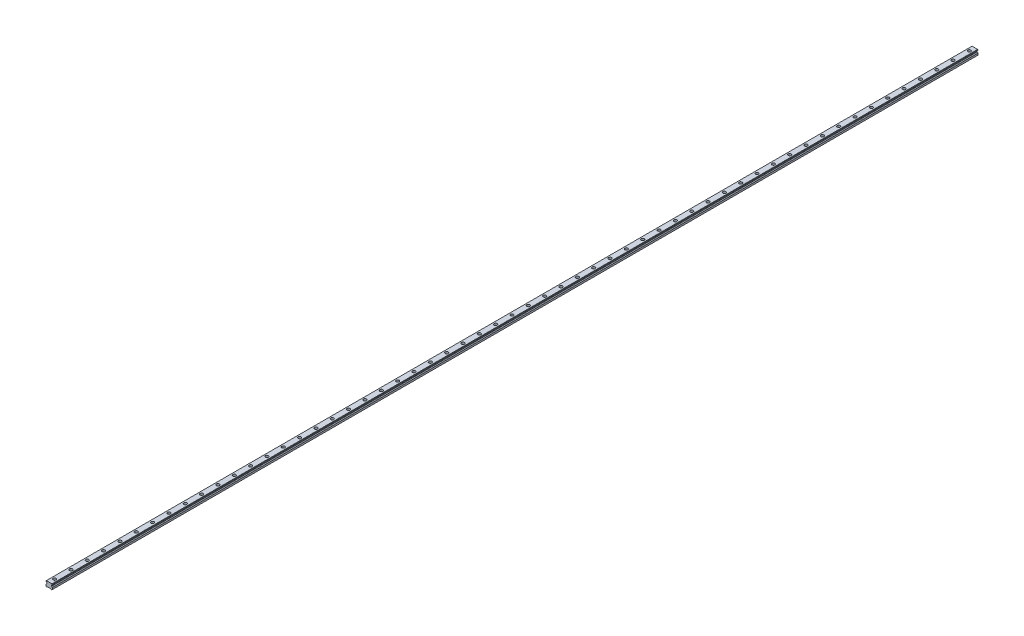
ISO-10303-21;
HEADER;
FILE_DESCRIPTION(('STEP AP214'),'2;1');
FILE_NAME('part.step','',(''),(''),'','','');
FILE_SCHEMA(('AUTOMOTIVE_DESIGN { 1 0 10303 214 1 1 1 1 }'));
ENDSEC;
DATA;
#1=APPLICATION_CONTEXT('core data for automotive mechanical design processes');
#2=APPLICATION_PROTOCOL_DEFINITION('international standard','automotive_design',2000,#1);
#3=PRODUCT_CONTEXT('',#1,'mechanical');
#4=PRODUCT('Part','Part','',(#3));
#5=PRODUCT_RELATED_PRODUCT_CATEGORY('part','',(#4));
#6=PRODUCT_DEFINITION_FORMATION('','',#4);
#7=PRODUCT_DEFINITION_CONTEXT('part definition',#1,'design');
#8=PRODUCT_DEFINITION('design','',#6,#7);
#9=PRODUCT_DEFINITION_SHAPE('','',#8);
#10=(LENGTH_UNIT() NAMED_UNIT(*) SI_UNIT(.MILLI.,.METRE.));
#11=(NAMED_UNIT(*) PLANE_ANGLE_UNIT() SI_UNIT($,.RADIAN.));
#12=(NAMED_UNIT(*) SI_UNIT($,.STERADIAN.) SOLID_ANGLE_UNIT());
#13=UNCERTAINTY_MEASURE_WITH_UNIT(LENGTH_MEASURE(1.E-05),#10,'distance_accuracy_value','');
#14=(GEOMETRIC_REPRESENTATION_CONTEXT(3) GLOBAL_UNCERTAINTY_ASSIGNED_CONTEXT((#13)) GLOBAL_UNIT_ASSIGNED_CONTEXT((#10,
#11,#12)) REPRESENTATION_CONTEXT('',''));
#15=CARTESIAN_POINT('',(0.,0.,0.));
#16=DIRECTION('',(0.,0.,1.));
#17=DIRECTION('',(1.,0.,0.));
#18=AXIS2_PLACEMENT_3D('',#15,#16,#17);
#19=CARTESIAN_POINT('',(0.,10.2,-1680.));
#20=DIRECTION('',(0.,1.,0.));
#21=DIRECTION('',(0.,0.,1.));
#22=AXIS2_PLACEMENT_3D('',#19,#20,#21);
#23=PLANE('',#22);
#24=CARTESIAN_POINT('',(0.,10.2,-1680.));
#25=DIRECTION('',(0.,1.,0.));
#26=DIRECTION('',(0.,0.,1.));
#27=AXIS2_PLACEMENT_3D('',#24,#25,#26);
#28=CIRCLE('',#27,3.49999999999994);
#29=CARTESIAN_POINT('',(0.,10.2,-1676.5));
#30=VERTEX_POINT('',#29);
#31=EDGE_CURVE('E798',#30,#30,#28,.T.);
#32=ORIENTED_EDGE('',*,*,#31,.F.);
#33=EDGE_LOOP('',(#32));
#34=FACE_BOUND('',#33,.T.);
#35=CARTESIAN_POINT('',(0.,10.2,-1680.));
#36=DIRECTION('',(0.,1.,0.));
#37=DIRECTION('',(0.,0.,1.));
#38=AXIS2_PLACEMENT_3D('',#35,#36,#37);
#39=CIRCLE('',#38,5.49999999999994);
#40=CARTESIAN_POINT('',(0.,10.2,-1674.5));
#41=VERTEX_POINT('',#40);
#42=EDGE_CURVE('E11',#41,#41,#39,.T.);
#43=ORIENTED_EDGE('',*,*,#42,.T.);
#44=EDGE_LOOP('',(#43));
#45=FACE_BOUND('',#44,.T.);
#46=ADVANCED_FACE('F39',(#34,#45),#23,.T.);
#47=CARTESIAN_POINT('',(0.,10.2,-1680.));
#48=DIRECTION('',(0.,1.,0.));
#49=DIRECTION('',(0.,0.,1.));
#50=AXIS2_PLACEMENT_3D('',#47,#48,#49);
#51=CYLINDRICAL_SURFACE('',#50,5.49999999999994);
#52=ORIENTED_EDGE('',*,*,#42,.F.);
#53=EDGE_LOOP('',(#52));
#54=FACE_BOUND('',#53,.T.);
#55=CARTESIAN_POINT('',(0.,19.2,-1680.));
#56=DIRECTION('',(0.,1.,0.));
#57=DIRECTION('',(0.,0.,1.));
#58=AXIS2_PLACEMENT_3D('',#55,#56,#57);
#59=CIRCLE('',#58,5.49999999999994);
#60=CARTESIAN_POINT('',(0.,19.2,-1674.5));
#61=VERTEX_POINT('',#60);
#62=EDGE_CURVE('E48',#61,#61,#59,.T.);
#63=ORIENTED_EDGE('',*,*,#62,.T.);
#64=EDGE_LOOP('',(#63));
#65=FACE_BOUND('',#64,.T.);
#66=ADVANCED_FACE('F1391',(#54,#65),#51,.F.);
#67=CARTESIAN_POINT('',(0.,10.2,-1620.));
#68=DIRECTION('',(0.,1.,0.));
#69=DIRECTION('',(0.,0.,1.));
#70=AXIS2_PLACEMENT_3D('',#67,#68,#69);
#71=PLANE('',#70);
#72=CARTESIAN_POINT('',(0.,10.2,-1620.));
#73=DIRECTION('',(0.,1.,0.));
#74=DIRECTION('',(0.,0.,1.));
#75=AXIS2_PLACEMENT_3D('',#72,#73,#74);
#76=CIRCLE('',#75,3.49999999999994);
#77=CARTESIAN_POINT('',(0.,10.2,-1616.5));
#78=VERTEX_POINT('',#77);
#79=EDGE_CURVE('E803',#78,#78,#76,.T.);
#80=ORIENTED_EDGE('',*,*,#79,.F.);
#81=EDGE_LOOP('',(#80));
#82=FACE_BOUND('',#81,.T.);
#83=CARTESIAN_POINT('',(0.,10.2,-1620.));
#84=DIRECTION('',(0.,1.,0.));
#85=DIRECTION('',(0.,0.,1.));
#86=AXIS2_PLACEMENT_3D('',#83,#84,#85);
#87=CIRCLE('',#86,5.49999999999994);
#88=CARTESIAN_POINT('',(0.,10.2,-1614.5));
#89=VERTEX_POINT('',#88);
#90=EDGE_CURVE('E782',#89,#89,#87,.T.);
#91=ORIENTED_EDGE('',*,*,#90,.T.);
#92=EDGE_LOOP('',(#91));
#93=FACE_BOUND('',#92,.T.);
#94=ADVANCED_FACE('F1396',(#82,#93),#71,.T.);
#95=CARTESIAN_POINT('',(0.,10.2,-1620.));
#96=DIRECTION('',(0.,1.,0.));
#97=DIRECTION('',(0.,0.,1.));
#98=AXIS2_PLACEMENT_3D('',#95,#96,#97);
#99=CYLINDRICAL_SURFACE('',#98,5.49999999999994);
#100=ORIENTED_EDGE('',*,*,#90,.F.);
#101=EDGE_LOOP('',(#100));
#102=FACE_BOUND('',#101,.T.);
#103=CARTESIAN_POINT('',(0.,19.2,-1620.));
#104=DIRECTION('',(0.,1.,0.));
#105=DIRECTION('',(0.,0.,1.));
#106=AXIS2_PLACEMENT_3D('',#103,#104,#105);
#107=CIRCLE('',#106,5.49999999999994);
#108=CARTESIAN_POINT('',(0.,19.2,-1614.5));
#109=VERTEX_POINT('',#108);
#110=EDGE_CURVE('E778',#109,#109,#107,.T.);
#111=ORIENTED_EDGE('',*,*,#110,.T.);
#112=EDGE_LOOP('',(#111));
#113=FACE_BOUND('',#112,.T.);
#114=ADVANCED_FACE('F1860',(#102,#113),#99,.F.);
#115=CARTESIAN_POINT('',(0.,10.2,-1560.));
#116=DIRECTION('',(0.,1.,0.));
#117=DIRECTION('',(0.,0.,1.));
#118=AXIS2_PLACEMENT_3D('',#115,#116,#117);
#119=PLANE('',#118);
#120=CARTESIAN_POINT('',(0.,10.2,-1560.));
#121=DIRECTION('',(0.,1.,0.));
#122=DIRECTION('',(0.,0.,1.));
#123=AXIS2_PLACEMENT_3D('',#120,#121,#122);
#124=CIRCLE('',#123,3.49999999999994);
#125=CARTESIAN_POINT('',(0.,10.2,-1556.5));
#126=VERTEX_POINT('',#125);
#127=EDGE_CURVE('E808',#126,#126,#124,.T.);
#128=ORIENTED_EDGE('',*,*,#127,.F.);
#129=EDGE_LOOP('',(#128));
#130=FACE_BOUND('',#129,.T.);
#131=CARTESIAN_POINT('',(0.,10.2,-1560.));
#132=DIRECTION('',(0.,1.,0.));
#133=DIRECTION('',(0.,0.,1.));
#134=AXIS2_PLACEMENT_3D('',#131,#132,#133);
#135=CIRCLE('',#134,5.49999999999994);
#136=CARTESIAN_POINT('',(0.,10.2,-1554.5));
#137=VERTEX_POINT('',#136);
#138=EDGE_CURVE('E774',#137,#137,#135,.T.);
#139=ORIENTED_EDGE('',*,*,#138,.T.);
#140=EDGE_LOOP('',(#139));
#141=FACE_BOUND('',#140,.T.);
#142=ADVANCED_FACE('F1856',(#130,#141),#119,.T.);
#143=CARTESIAN_POINT('',(0.,10.2,-1560.));
#144=DIRECTION('',(0.,1.,0.));
#145=DIRECTION('',(0.,0.,1.));
#146=AXIS2_PLACEMENT_3D('',#143,#144,#145);
#147=CYLINDRICAL_SURFACE('',#146,5.49999999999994);
#148=ORIENTED_EDGE('',*,*,#138,.F.);
#149=EDGE_LOOP('',(#148));
#150=FACE_BOUND('',#149,.T.);
#151=CARTESIAN_POINT('',(0.,19.2,-1560.));
#152=DIRECTION('',(0.,1.,0.));
#153=DIRECTION('',(0.,0.,1.));
#154=AXIS2_PLACEMENT_3D('',#151,#152,#153);
#155=CIRCLE('',#154,5.49999999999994);
#156=CARTESIAN_POINT('',(0.,19.2,-1554.5));
#157=VERTEX_POINT('',#156);
#158=EDGE_CURVE('E770',#157,#157,#155,.T.);
#159=ORIENTED_EDGE('',*,*,#158,.T.);
#160=EDGE_LOOP('',(#159));
#161=FACE_BOUND('',#160,.T.);
#162=ADVANCED_FACE('F1852',(#150,#161),#147,.F.);
#163=CARTESIAN_POINT('',(0.,10.2,-1500.));
#164=DIRECTION('',(0.,1.,0.));
#165=DIRECTION('',(0.,0.,1.));
#166=AXIS2_PLACEMENT_3D('',#163,#164,#165);
#167=PLANE('',#166);
#168=CARTESIAN_POINT('',(0.,10.2,-1500.));
#169=DIRECTION('',(0.,1.,0.));
#170=DIRECTION('',(0.,0.,1.));
#171=AXIS2_PLACEMENT_3D('',#168,#169,#170);
#172=CIRCLE('',#171,3.49999999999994);
#173=CARTESIAN_POINT('',(0.,10.2,-1496.5));
#174=VERTEX_POINT('',#173);
#175=EDGE_CURVE('E813',#174,#174,#172,.T.);
#176=ORIENTED_EDGE('',*,*,#175,.F.);
#177=EDGE_LOOP('',(#176));
#178=FACE_BOUND('',#177,.T.);
#179=CARTESIAN_POINT('',(0.,10.2,-1500.));
#180=DIRECTION('',(0.,1.,0.));
#181=DIRECTION('',(0.,0.,1.));
#182=AXIS2_PLACEMENT_3D('',#179,#180,#181);
#183=CIRCLE('',#182,5.49999999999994);
#184=CARTESIAN_POINT('',(0.,10.2,-1494.5));
#185=VERTEX_POINT('',#184);
#186=EDGE_CURVE('E766',#185,#185,#183,.T.);
#187=ORIENTED_EDGE('',*,*,#186,.T.);
#188=EDGE_LOOP('',(#187));
#189=FACE_BOUND('',#188,.T.);
#190=ADVANCED_FACE('F1848',(#178,#189),#167,.T.);
#191=CARTESIAN_POINT('',(0.,10.2,-1500.));
#192=DIRECTION('',(0.,1.,0.));
#193=DIRECTION('',(0.,0.,1.));
#194=AXIS2_PLACEMENT_3D('',#191,#192,#193);
#195=CYLINDRICAL_SURFACE('',#194,5.49999999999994);
#196=ORIENTED_EDGE('',*,*,#186,.F.);
#197=EDGE_LOOP('',(#196));
#198=FACE_BOUND('',#197,.T.);
#199=CARTESIAN_POINT('',(0.,19.2,-1500.));
#200=DIRECTION('',(0.,1.,0.));
#201=DIRECTION('',(0.,0.,1.));
#202=AXIS2_PLACEMENT_3D('',#199,#200,#201);
#203=CIRCLE('',#202,5.49999999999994);
#204=CARTESIAN_POINT('',(0.,19.2,-1494.5));
#205=VERTEX_POINT('',#204);
#206=EDGE_CURVE('E762',#205,#205,#203,.T.);
#207=ORIENTED_EDGE('',*,*,#206,.T.);
#208=EDGE_LOOP('',(#207));
#209=FACE_BOUND('',#208,.T.);
#210=ADVANCED_FACE('F1844',(#198,#209),#195,.F.);
#211=CARTESIAN_POINT('',(0.,10.2,-1440.));
#212=DIRECTION('',(0.,1.,0.));
#213=DIRECTION('',(0.,0.,1.));
#214=AXIS2_PLACEMENT_3D('',#211,#212,#213);
#215=PLANE('',#214);
#216=CARTESIAN_POINT('',(0.,10.2,-1440.));
#217=DIRECTION('',(0.,1.,0.));
#218=DIRECTION('',(0.,0.,1.));
#219=AXIS2_PLACEMENT_3D('',#216,#217,#218);
#220=CIRCLE('',#219,3.49999999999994);
#221=CARTESIAN_POINT('',(0.,10.2,-1436.5));
#222=VERTEX_POINT('',#221);
#223=EDGE_CURVE('E818',#222,#222,#220,.T.);
#224=ORIENTED_EDGE('',*,*,#223,.F.);
#225=EDGE_LOOP('',(#224));
#226=FACE_BOUND('',#225,.T.);
#227=CARTESIAN_POINT('',(0.,10.2,-1440.));
#228=DIRECTION('',(0.,1.,0.));
#229=DIRECTION('',(0.,0.,1.));
#230=AXIS2_PLACEMENT_3D('',#227,#228,#229);
#231=CIRCLE('',#230,5.49999999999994);
#232=CARTESIAN_POINT('',(0.,10.2,-1434.5));
#233=VERTEX_POINT('',#232);
#234=EDGE_CURVE('E758',#233,#233,#231,.T.);
#235=ORIENTED_EDGE('',*,*,#234,.T.);
#236=EDGE_LOOP('',(#235));
#237=FACE_BOUND('',#236,.T.);
#238=ADVANCED_FACE('F1840',(#226,#237),#215,.T.);
#239=CARTESIAN_POINT('',(0.,10.2,-1440.));
#240=DIRECTION('',(0.,1.,0.));
#241=DIRECTION('',(0.,0.,1.));
#242=AXIS2_PLACEMENT_3D('',#239,#240,#241);
#243=CYLINDRICAL_SURFACE('',#242,5.49999999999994);
#244=ORIENTED_EDGE('',*,*,#234,.F.);
#245=EDGE_LOOP('',(#244));
#246=FACE_BOUND('',#245,.T.);
#247=CARTESIAN_POINT('',(0.,19.2,-1440.));
#248=DIRECTION('',(0.,1.,0.));
#249=DIRECTION('',(0.,0.,1.));
#250=AXIS2_PLACEMENT_3D('',#247,#248,#249);
#251=CIRCLE('',#250,5.49999999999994);
#252=CARTESIAN_POINT('',(0.,19.2,-1434.5));
#253=VERTEX_POINT('',#252);
#254=EDGE_CURVE('E754',#253,#253,#251,.T.);
#255=ORIENTED_EDGE('',*,*,#254,.T.);
#256=EDGE_LOOP('',(#255));
#257=FACE_BOUND('',#256,.T.);
#258=ADVANCED_FACE('F1836',(#246,#257),#243,.F.);
#259=CARTESIAN_POINT('',(0.,10.2,-1380.));
#260=DIRECTION('',(0.,1.,0.));
#261=DIRECTION('',(0.,0.,1.));
#262=AXIS2_PLACEMENT_3D('',#259,#260,#261);
#263=PLANE('',#262);
#264=CARTESIAN_POINT('',(0.,10.2,-1380.));
#265=DIRECTION('',(0.,1.,0.));
#266=DIRECTION('',(0.,0.,1.));
#267=AXIS2_PLACEMENT_3D('',#264,#265,#266);
#268=CIRCLE('',#267,3.49999999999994);
#269=CARTESIAN_POINT('',(0.,10.2,-1376.5));
#270=VERTEX_POINT('',#269);
#271=EDGE_CURVE('E823',#270,#270,#268,.T.);
#272=ORIENTED_EDGE('',*,*,#271,.F.);
#273=EDGE_LOOP('',(#272));
#274=FACE_BOUND('',#273,.T.);
#275=CARTESIAN_POINT('',(0.,10.2,-1380.));
#276=DIRECTION('',(0.,1.,0.));
#277=DIRECTION('',(0.,0.,1.));
#278=AXIS2_PLACEMENT_3D('',#275,#276,#277);
#279=CIRCLE('',#278,5.49999999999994);
#280=CARTESIAN_POINT('',(0.,10.2,-1374.5));
#281=VERTEX_POINT('',#280);
#282=EDGE_CURVE('E750',#281,#281,#279,.T.);
#283=ORIENTED_EDGE('',*,*,#282,.T.);
#284=EDGE_LOOP('',(#283));
#285=FACE_BOUND('',#284,.T.);
#286=ADVANCED_FACE('F1832',(#274,#285),#263,.T.);
#287=CARTESIAN_POINT('',(0.,10.2,-1380.));
#288=DIRECTION('',(0.,1.,0.));
#289=DIRECTION('',(0.,0.,1.));
#290=AXIS2_PLACEMENT_3D('',#287,#288,#289);
#291=CYLINDRICAL_SURFACE('',#290,5.49999999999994);
#292=ORIENTED_EDGE('',*,*,#282,.F.);
#293=EDGE_LOOP('',(#292));
#294=FACE_BOUND('',#293,.T.);
#295=CARTESIAN_POINT('',(0.,19.2,-1380.));
#296=DIRECTION('',(0.,1.,0.));
#297=DIRECTION('',(0.,0.,1.));
#298=AXIS2_PLACEMENT_3D('',#295,#296,#297);
#299=CIRCLE('',#298,5.49999999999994);
#300=CARTESIAN_POINT('',(0.,19.2,-1374.5));
#301=VERTEX_POINT('',#300);
#302=EDGE_CURVE('E746',#301,#301,#299,.T.);
#303=ORIENTED_EDGE('',*,*,#302,.T.);
#304=EDGE_LOOP('',(#303));
#305=FACE_BOUND('',#304,.T.);
#306=ADVANCED_FACE('F1828',(#294,#305),#291,.F.);
#307=CARTESIAN_POINT('',(0.,10.2,-1320.));
#308=DIRECTION('',(0.,1.,0.));
#309=DIRECTION('',(0.,0.,1.));
#310=AXIS2_PLACEMENT_3D('',#307,#308,#309);
#311=PLANE('',#310);
#312=CARTESIAN_POINT('',(0.,10.2,-1320.));
#313=DIRECTION('',(0.,1.,0.));
#314=DIRECTION('',(0.,0.,1.));
#315=AXIS2_PLACEMENT_3D('',#312,#313,#314);
#316=CIRCLE('',#315,3.49999999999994);
#317=CARTESIAN_POINT('',(0.,10.2,-1316.5));
#318=VERTEX_POINT('',#317);
#319=EDGE_CURVE('E828',#318,#318,#316,.T.);
#320=ORIENTED_EDGE('',*,*,#319,.F.);
#321=EDGE_LOOP('',(#320));
#322=FACE_BOUND('',#321,.T.);
#323=CARTESIAN_POINT('',(0.,10.2,-1320.));
#324=DIRECTION('',(0.,1.,0.));
#325=DIRECTION('',(0.,0.,1.));
#326=AXIS2_PLACEMENT_3D('',#323,#324,#325);
#327=CIRCLE('',#326,5.49999999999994);
#328=CARTESIAN_POINT('',(0.,10.2,-1314.5));
#329=VERTEX_POINT('',#328);
#330=EDGE_CURVE('E742',#329,#329,#327,.T.);
#331=ORIENTED_EDGE('',*,*,#330,.T.);
#332=EDGE_LOOP('',(#331));
#333=FACE_BOUND('',#332,.T.);
#334=ADVANCED_FACE('F1824',(#322,#333),#311,.T.);
#335=CARTESIAN_POINT('',(0.,10.2,-1320.));
#336=DIRECTION('',(0.,1.,0.));
#337=DIRECTION('',(0.,0.,1.));
#338=AXIS2_PLACEMENT_3D('',#335,#336,#337);
#339=CYLINDRICAL_SURFACE('',#338,5.49999999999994);
#340=ORIENTED_EDGE('',*,*,#330,.F.);
#341=EDGE_LOOP('',(#340));
#342=FACE_BOUND('',#341,.T.);
#343=CARTESIAN_POINT('',(0.,19.2,-1320.));
#344=DIRECTION('',(0.,1.,0.));
#345=DIRECTION('',(0.,0.,1.));
#346=AXIS2_PLACEMENT_3D('',#343,#344,#345);
#347=CIRCLE('',#346,5.49999999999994);
#348=CARTESIAN_POINT('',(0.,19.2,-1314.5));
#349=VERTEX_POINT('',#348);
#350=EDGE_CURVE('E738',#349,#349,#347,.T.);
#351=ORIENTED_EDGE('',*,*,#350,.T.);
#352=EDGE_LOOP('',(#351));
#353=FACE_BOUND('',#352,.T.);
#354=ADVANCED_FACE('F1820',(#342,#353),#339,.F.);
#355=CARTESIAN_POINT('',(0.,10.2,-1260.));
#356=DIRECTION('',(0.,1.,0.));
#357=DIRECTION('',(0.,0.,1.));
#358=AXIS2_PLACEMENT_3D('',#355,#356,#357);
#359=PLANE('',#358);
#360=CARTESIAN_POINT('',(0.,10.2,-1260.));
#361=DIRECTION('',(0.,1.,0.));
#362=DIRECTION('',(0.,0.,1.));
#363=AXIS2_PLACEMENT_3D('',#360,#361,#362);
#364=CIRCLE('',#363,3.49999999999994);
#365=CARTESIAN_POINT('',(0.,10.2,-1256.5));
#366=VERTEX_POINT('',#365);
#367=EDGE_CURVE('E833',#366,#366,#364,.T.);
#368=ORIENTED_EDGE('',*,*,#367,.F.);
#369=EDGE_LOOP('',(#368));
#370=FACE_BOUND('',#369,.T.);
#371=CARTESIAN_POINT('',(0.,10.2,-1260.));
#372=DIRECTION('',(0.,1.,0.));
#373=DIRECTION('',(0.,0.,1.));
#374=AXIS2_PLACEMENT_3D('',#371,#372,#373);
#375=CIRCLE('',#374,5.49999999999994);
#376=CARTESIAN_POINT('',(0.,10.2,-1254.5));
#377=VERTEX_POINT('',#376);
#378=EDGE_CURVE('E734',#377,#377,#375,.T.);
#379=ORIENTED_EDGE('',*,*,#378,.T.);
#380=EDGE_LOOP('',(#379));
#381=FACE_BOUND('',#380,.T.);
#382=ADVANCED_FACE('F1816',(#370,#381),#359,.T.);
#383=CARTESIAN_POINT('',(0.,10.2,-1260.));
#384=DIRECTION('',(0.,1.,0.));
#385=DIRECTION('',(0.,0.,1.));
#386=AXIS2_PLACEMENT_3D('',#383,#384,#385);
#387=CYLINDRICAL_SURFACE('',#386,5.49999999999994);
#388=ORIENTED_EDGE('',*,*,#378,.F.);
#389=EDGE_LOOP('',(#388));
#390=FACE_BOUND('',#389,.T.);
#391=CARTESIAN_POINT('',(0.,19.2,-1260.));
#392=DIRECTION('',(0.,1.,0.));
#393=DIRECTION('',(0.,0.,1.));
#394=AXIS2_PLACEMENT_3D('',#391,#392,#393);
#395=CIRCLE('',#394,5.49999999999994);
#396=CARTESIAN_POINT('',(0.,19.2,-1254.5));
#397=VERTEX_POINT('',#396);
#398=EDGE_CURVE('E730',#397,#397,#395,.T.);
#399=ORIENTED_EDGE('',*,*,#398,.T.);
#400=EDGE_LOOP('',(#399));
#401=FACE_BOUND('',#400,.T.);
#402=ADVANCED_FACE('F1812',(#390,#401),#387,.F.);
#403=CARTESIAN_POINT('',(0.,10.2,-1200.));
#404=DIRECTION('',(0.,1.,0.));
#405=DIRECTION('',(0.,0.,1.));
#406=AXIS2_PLACEMENT_3D('',#403,#404,#405);
#407=PLANE('',#406);
#408=CARTESIAN_POINT('',(0.,10.2,-1200.));
#409=DIRECTION('',(0.,1.,0.));
#410=DIRECTION('',(0.,0.,1.));
#411=AXIS2_PLACEMENT_3D('',#408,#409,#410);
#412=CIRCLE('',#411,3.49999999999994);
#413=CARTESIAN_POINT('',(0.,10.2,-1196.5));
#414=VERTEX_POINT('',#413);
#415=EDGE_CURVE('E838',#414,#414,#412,.T.);
#416=ORIENTED_EDGE('',*,*,#415,.F.);
#417=EDGE_LOOP('',(#416));
#418=FACE_BOUND('',#417,.T.);
#419=CARTESIAN_POINT('',(0.,10.2,-1200.));
#420=DIRECTION('',(0.,1.,0.));
#421=DIRECTION('',(0.,0.,1.));
#422=AXIS2_PLACEMENT_3D('',#419,#420,#421);
#423=CIRCLE('',#422,5.49999999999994);
#424=CARTESIAN_POINT('',(0.,10.2,-1194.5));
#425=VERTEX_POINT('',#424);
#426=EDGE_CURVE('E726',#425,#425,#423,.T.);
#427=ORIENTED_EDGE('',*,*,#426,.T.);
#428=EDGE_LOOP('',(#427));
#429=FACE_BOUND('',#428,.T.);
#430=ADVANCED_FACE('F1808',(#418,#429),#407,.T.);
#431=CARTESIAN_POINT('',(0.,10.2,-1200.));
#432=DIRECTION('',(0.,1.,0.));
#433=DIRECTION('',(0.,0.,1.));
#434=AXIS2_PLACEMENT_3D('',#431,#432,#433);
#435=CYLINDRICAL_SURFACE('',#434,5.49999999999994);
#436=ORIENTED_EDGE('',*,*,#426,.F.);
#437=EDGE_LOOP('',(#436));
#438=FACE_BOUND('',#437,.T.);
#439=CARTESIAN_POINT('',(0.,19.2,-1200.));
#440=DIRECTION('',(0.,1.,0.));
#441=DIRECTION('',(0.,0.,1.));
#442=AXIS2_PLACEMENT_3D('',#439,#440,#441);
#443=CIRCLE('',#442,5.49999999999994);
#444=CARTESIAN_POINT('',(0.,19.2,-1194.5));
#445=VERTEX_POINT('',#444);
#446=EDGE_CURVE('E722',#445,#445,#443,.T.);
#447=ORIENTED_EDGE('',*,*,#446,.T.);
#448=EDGE_LOOP('',(#447));
#449=FACE_BOUND('',#448,.T.);
#450=ADVANCED_FACE('F1804',(#438,#449),#435,.F.);
#451=CARTESIAN_POINT('',(0.,10.2,-1140.));
#452=DIRECTION('',(0.,1.,0.));
#453=DIRECTION('',(0.,0.,1.));
#454=AXIS2_PLACEMENT_3D('',#451,#452,#453);
#455=PLANE('',#454);
#456=CARTESIAN_POINT('',(0.,10.2,-1140.));
#457=DIRECTION('',(0.,1.,0.));
#458=DIRECTION('',(0.,0.,1.));
#459=AXIS2_PLACEMENT_3D('',#456,#457,#458);
#460=CIRCLE('',#459,3.49999999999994);
#461=CARTESIAN_POINT('',(0.,10.2,-1136.5));
#462=VERTEX_POINT('',#461);
#463=EDGE_CURVE('E843',#462,#462,#460,.T.);
#464=ORIENTED_EDGE('',*,*,#463,.F.);
#465=EDGE_LOOP('',(#464));
#466=FACE_BOUND('',#465,.T.);
#467=CARTESIAN_POINT('',(0.,10.2,-1140.));
#468=DIRECTION('',(0.,1.,0.));
#469=DIRECTION('',(0.,0.,1.));
#470=AXIS2_PLACEMENT_3D('',#467,#468,#469);
#471=CIRCLE('',#470,5.49999999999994);
#472=CARTESIAN_POINT('',(0.,10.2,-1134.5));
#473=VERTEX_POINT('',#472);
#474=EDGE_CURVE('E718',#473,#473,#471,.T.);
#475=ORIENTED_EDGE('',*,*,#474,.T.);
#476=EDGE_LOOP('',(#475));
#477=FACE_BOUND('',#476,.T.);
#478=ADVANCED_FACE('F1800',(#466,#477),#455,.T.);
#479=CARTESIAN_POINT('',(0.,10.2,-1140.));
#480=DIRECTION('',(0.,1.,0.));
#481=DIRECTION('',(0.,0.,1.));
#482=AXIS2_PLACEMENT_3D('',#479,#480,#481);
#483=CYLINDRICAL_SURFACE('',#482,5.49999999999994);
#484=ORIENTED_EDGE('',*,*,#474,.F.);
#485=EDGE_LOOP('',(#484));
#486=FACE_BOUND('',#485,.T.);
#487=CARTESIAN_POINT('',(0.,19.2,-1140.));
#488=DIRECTION('',(0.,1.,0.));
#489=DIRECTION('',(0.,0.,1.));
#490=AXIS2_PLACEMENT_3D('',#487,#488,#489);
#491=CIRCLE('',#490,5.49999999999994);
#492=CARTESIAN_POINT('',(0.,19.2,-1134.5));
#493=VERTEX_POINT('',#492);
#494=EDGE_CURVE('E714',#493,#493,#491,.T.);
#495=ORIENTED_EDGE('',*,*,#494,.T.);
#496=EDGE_LOOP('',(#495));
#497=FACE_BOUND('',#496,.T.);
#498=ADVANCED_FACE('F1796',(#486,#497),#483,.F.);
#499=CARTESIAN_POINT('',(0.,10.2,-1080.));
#500=DIRECTION('',(0.,1.,0.));
#501=DIRECTION('',(0.,0.,1.));
#502=AXIS2_PLACEMENT_3D('',#499,#500,#501);
#503=PLANE('',#502);
#504=CARTESIAN_POINT('',(0.,10.2,-1080.));
#505=DIRECTION('',(0.,1.,0.));
#506=DIRECTION('',(0.,0.,1.));
#507=AXIS2_PLACEMENT_3D('',#504,#505,#506);
#508=CIRCLE('',#507,3.49999999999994);
#509=CARTESIAN_POINT('',(0.,10.2,-1076.5));
#510=VERTEX_POINT('',#509);
#511=EDGE_CURVE('E848',#510,#510,#508,.T.);
#512=ORIENTED_EDGE('',*,*,#511,.F.);
#513=EDGE_LOOP('',(#512));
#514=FACE_BOUND('',#513,.T.);
#515=CARTESIAN_POINT('',(0.,10.2,-1080.));
#516=DIRECTION('',(0.,1.,0.));
#517=DIRECTION('',(0.,0.,1.));
#518=AXIS2_PLACEMENT_3D('',#515,#516,#517);
#519=CIRCLE('',#518,5.49999999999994);
#520=CARTESIAN_POINT('',(0.,10.2,-1074.5));
#521=VERTEX_POINT('',#520);
#522=EDGE_CURVE('E710',#521,#521,#519,.T.);
#523=ORIENTED_EDGE('',*,*,#522,.T.);
#524=EDGE_LOOP('',(#523));
#525=FACE_BOUND('',#524,.T.);
#526=ADVANCED_FACE('F1792',(#514,#525),#503,.T.);
#527=CARTESIAN_POINT('',(0.,10.2,-1080.));
#528=DIRECTION('',(0.,1.,0.));
#529=DIRECTION('',(0.,0.,1.));
#530=AXIS2_PLACEMENT_3D('',#527,#528,#529);
#531=CYLINDRICAL_SURFACE('',#530,5.49999999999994);
#532=ORIENTED_EDGE('',*,*,#522,.F.);
#533=EDGE_LOOP('',(#532));
#534=FACE_BOUND('',#533,.T.);
#535=CARTESIAN_POINT('',(0.,19.2,-1080.));
#536=DIRECTION('',(0.,1.,0.));
#537=DIRECTION('',(0.,0.,1.));
#538=AXIS2_PLACEMENT_3D('',#535,#536,#537);
#539=CIRCLE('',#538,5.49999999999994);
#540=CARTESIAN_POINT('',(0.,19.2,-1074.5));
#541=VERTEX_POINT('',#540);
#542=EDGE_CURVE('E706',#541,#541,#539,.T.);
#543=ORIENTED_EDGE('',*,*,#542,.T.);
#544=EDGE_LOOP('',(#543));
#545=FACE_BOUND('',#544,.T.);
#546=ADVANCED_FACE('F1788',(#534,#545),#531,.F.);
#547=CARTESIAN_POINT('',(0.,10.2,-1020.));
#548=DIRECTION('',(0.,1.,0.));
#549=DIRECTION('',(0.,0.,1.));
#550=AXIS2_PLACEMENT_3D('',#547,#548,#549);
#551=PLANE('',#550);
#552=CARTESIAN_POINT('',(0.,10.2,-1020.));
#553=DIRECTION('',(0.,1.,0.));
#554=DIRECTION('',(0.,0.,1.));
#555=AXIS2_PLACEMENT_3D('',#552,#553,#554);
#556=CIRCLE('',#555,3.49999999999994);
#557=CARTESIAN_POINT('',(0.,10.2,-1016.5));
#558=VERTEX_POINT('',#557);
#559=EDGE_CURVE('E853',#558,#558,#556,.T.);
#560=ORIENTED_EDGE('',*,*,#559,.F.);
#561=EDGE_LOOP('',(#560));
#562=FACE_BOUND('',#561,.T.);
#563=CARTESIAN_POINT('',(0.,10.2,-1020.));
#564=DIRECTION('',(0.,1.,0.));
#565=DIRECTION('',(0.,0.,1.));
#566=AXIS2_PLACEMENT_3D('',#563,#564,#565);
#567=CIRCLE('',#566,5.49999999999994);
#568=CARTESIAN_POINT('',(0.,10.2,-1014.5));
#569=VERTEX_POINT('',#568);
#570=EDGE_CURVE('E702',#569,#569,#567,.T.);
#571=ORIENTED_EDGE('',*,*,#570,.T.);
#572=EDGE_LOOP('',(#571));
#573=FACE_BOUND('',#572,.T.);
#574=ADVANCED_FACE('F1784',(#562,#573),#551,.T.);
#575=CARTESIAN_POINT('',(0.,10.2,-1020.));
#576=DIRECTION('',(0.,1.,0.));
#577=DIRECTION('',(0.,0.,1.));
#578=AXIS2_PLACEMENT_3D('',#575,#576,#577);
#579=CYLINDRICAL_SURFACE('',#578,5.49999999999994);
#580=ORIENTED_EDGE('',*,*,#570,.F.);
#581=EDGE_LOOP('',(#580));
#582=FACE_BOUND('',#581,.T.);
#583=CARTESIAN_POINT('',(0.,19.2,-1020.));
#584=DIRECTION('',(0.,1.,0.));
#585=DIRECTION('',(0.,0.,1.));
#586=AXIS2_PLACEMENT_3D('',#583,#584,#585);
#587=CIRCLE('',#586,5.49999999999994);
#588=CARTESIAN_POINT('',(0.,19.2,-1014.5));
#589=VERTEX_POINT('',#588);
#590=EDGE_CURVE('E698',#589,#589,#587,.T.);
#591=ORIENTED_EDGE('',*,*,#590,.T.);
#592=EDGE_LOOP('',(#591));
#593=FACE_BOUND('',#592,.T.);
#594=ADVANCED_FACE('F1780',(#582,#593),#579,.F.);
#595=CARTESIAN_POINT('',(0.,10.2,-960.));
#596=DIRECTION('',(0.,1.,0.));
#597=DIRECTION('',(0.,0.,1.));
#598=AXIS2_PLACEMENT_3D('',#595,#596,#597);
#599=PLANE('',#598);
#600=CARTESIAN_POINT('',(0.,10.2,-960.));
#601=DIRECTION('',(0.,1.,0.));
#602=DIRECTION('',(0.,0.,1.));
#603=AXIS2_PLACEMENT_3D('',#600,#601,#602);
#604=CIRCLE('',#603,3.49999999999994);
#605=CARTESIAN_POINT('',(0.,10.2,-956.5));
#606=VERTEX_POINT('',#605);
#607=EDGE_CURVE('E858',#606,#606,#604,.T.);
#608=ORIENTED_EDGE('',*,*,#607,.F.);
#609=EDGE_LOOP('',(#608));
#610=FACE_BOUND('',#609,.T.);
#611=CARTESIAN_POINT('',(0.,10.2,-960.));
#612=DIRECTION('',(0.,1.,0.));
#613=DIRECTION('',(0.,0.,1.));
#614=AXIS2_PLACEMENT_3D('',#611,#612,#613);
#615=CIRCLE('',#614,5.49999999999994);
#616=CARTESIAN_POINT('',(0.,10.2,-954.5));
#617=VERTEX_POINT('',#616);
#618=EDGE_CURVE('E694',#617,#617,#615,.T.);
#619=ORIENTED_EDGE('',*,*,#618,.T.);
#620=EDGE_LOOP('',(#619));
#621=FACE_BOUND('',#620,.T.);
#622=ADVANCED_FACE('F1776',(#610,#621),#599,.T.);
#623=CARTESIAN_POINT('',(0.,10.2,-960.));
#624=DIRECTION('',(0.,1.,0.));
#625=DIRECTION('',(0.,0.,1.));
#626=AXIS2_PLACEMENT_3D('',#623,#624,#625);
#627=CYLINDRICAL_SURFACE('',#626,5.49999999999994);
#628=ORIENTED_EDGE('',*,*,#618,.F.);
#629=EDGE_LOOP('',(#628));
#630=FACE_BOUND('',#629,.T.);
#631=CARTESIAN_POINT('',(0.,19.2,-960.));
#632=DIRECTION('',(0.,1.,0.));
#633=DIRECTION('',(0.,0.,1.));
#634=AXIS2_PLACEMENT_3D('',#631,#632,#633);
#635=CIRCLE('',#634,5.49999999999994);
#636=CARTESIAN_POINT('',(0.,19.2,-954.5));
#637=VERTEX_POINT('',#636);
#638=EDGE_CURVE('E690',#637,#637,#635,.T.);
#639=ORIENTED_EDGE('',*,*,#638,.T.);
#640=EDGE_LOOP('',(#639));
#641=FACE_BOUND('',#640,.T.);
#642=ADVANCED_FACE('F1772',(#630,#641),#627,.F.);
#643=CARTESIAN_POINT('',(0.,10.2,-900.));
#644=DIRECTION('',(0.,1.,0.));
#645=DIRECTION('',(0.,0.,1.));
#646=AXIS2_PLACEMENT_3D('',#643,#644,#645);
#647=PLANE('',#646);
#648=CARTESIAN_POINT('',(0.,10.2,-900.));
#649=DIRECTION('',(0.,1.,0.));
#650=DIRECTION('',(0.,0.,1.));
#651=AXIS2_PLACEMENT_3D('',#648,#649,#650);
#652=CIRCLE('',#651,3.49999999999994);
#653=CARTESIAN_POINT('',(0.,10.2,-896.5));
#654=VERTEX_POINT('',#653);
#655=EDGE_CURVE('E863',#654,#654,#652,.T.);
#656=ORIENTED_EDGE('',*,*,#655,.F.);
#657=EDGE_LOOP('',(#656));
#658=FACE_BOUND('',#657,.T.);
#659=CARTESIAN_POINT('',(0.,10.2,-900.));
#660=DIRECTION('',(0.,1.,0.));
#661=DIRECTION('',(0.,0.,1.));
#662=AXIS2_PLACEMENT_3D('',#659,#660,#661);
#663=CIRCLE('',#662,5.49999999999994);
#664=CARTESIAN_POINT('',(0.,10.2,-894.5));
#665=VERTEX_POINT('',#664);
#666=EDGE_CURVE('E686',#665,#665,#663,.T.);
#667=ORIENTED_EDGE('',*,*,#666,.T.);
#668=EDGE_LOOP('',(#667));
#669=FACE_BOUND('',#668,.T.);
#670=ADVANCED_FACE('F1768',(#658,#669),#647,.T.);
#671=CARTESIAN_POINT('',(0.,10.2,-900.));
#672=DIRECTION('',(0.,1.,0.));
#673=DIRECTION('',(0.,0.,1.));
#674=AXIS2_PLACEMENT_3D('',#671,#672,#673);
#675=CYLINDRICAL_SURFACE('',#674,5.49999999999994);
#676=ORIENTED_EDGE('',*,*,#666,.F.);
#677=EDGE_LOOP('',(#676));
#678=FACE_BOUND('',#677,.T.);
#679=CARTESIAN_POINT('',(0.,19.2,-900.));
#680=DIRECTION('',(0.,1.,0.));
#681=DIRECTION('',(0.,0.,1.));
#682=AXIS2_PLACEMENT_3D('',#679,#680,#681);
#683=CIRCLE('',#682,5.49999999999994);
#684=CARTESIAN_POINT('',(0.,19.2,-894.5));
#685=VERTEX_POINT('',#684);
#686=EDGE_CURVE('E682',#685,#685,#683,.T.);
#687=ORIENTED_EDGE('',*,*,#686,.T.);
#688=EDGE_LOOP('',(#687));
#689=FACE_BOUND('',#688,.T.);
#690=ADVANCED_FACE('F1764',(#678,#689),#675,.F.);
#691=CARTESIAN_POINT('',(0.,10.2,-840.));
#692=DIRECTION('',(0.,1.,0.));
#693=DIRECTION('',(0.,0.,1.));
#694=AXIS2_PLACEMENT_3D('',#691,#692,#693);
#695=PLANE('',#694);
#696=CARTESIAN_POINT('',(0.,10.2,-840.));
#697=DIRECTION('',(0.,1.,0.));
#698=DIRECTION('',(0.,0.,1.));
#699=AXIS2_PLACEMENT_3D('',#696,#697,#698);
#700=CIRCLE('',#699,3.49999999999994);
#701=CARTESIAN_POINT('',(0.,10.2,-836.5));
#702=VERTEX_POINT('',#701);
#703=EDGE_CURVE('E868',#702,#702,#700,.T.);
#704=ORIENTED_EDGE('',*,*,#703,.F.);
#705=EDGE_LOOP('',(#704));
#706=FACE_BOUND('',#705,.T.);
#707=CARTESIAN_POINT('',(0.,10.2,-840.));
#708=DIRECTION('',(0.,1.,0.));
#709=DIRECTION('',(0.,0.,1.));
#710=AXIS2_PLACEMENT_3D('',#707,#708,#709);
#711=CIRCLE('',#710,5.49999999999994);
#712=CARTESIAN_POINT('',(0.,10.2,-834.5));
#713=VERTEX_POINT('',#712);
#714=EDGE_CURVE('E678',#713,#713,#711,.T.);
#715=ORIENTED_EDGE('',*,*,#714,.T.);
#716=EDGE_LOOP('',(#715));
#717=FACE_BOUND('',#716,.T.);
#718=ADVANCED_FACE('F1760',(#706,#717),#695,.T.);
#719=CARTESIAN_POINT('',(0.,10.2,-840.));
#720=DIRECTION('',(0.,1.,0.));
#721=DIRECTION('',(0.,0.,1.));
#722=AXIS2_PLACEMENT_3D('',#719,#720,#721);
#723=CYLINDRICAL_SURFACE('',#722,5.49999999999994);
#724=ORIENTED_EDGE('',*,*,#714,.F.);
#725=EDGE_LOOP('',(#724));
#726=FACE_BOUND('',#725,.T.);
#727=CARTESIAN_POINT('',(0.,19.2,-840.));
#728=DIRECTION('',(0.,1.,0.));
#729=DIRECTION('',(0.,0.,1.));
#730=AXIS2_PLACEMENT_3D('',#727,#728,#729);
#731=CIRCLE('',#730,5.49999999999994);
#732=CARTESIAN_POINT('',(0.,19.2,-834.5));
#733=VERTEX_POINT('',#732);
#734=EDGE_CURVE('E674',#733,#733,#731,.T.);
#735=ORIENTED_EDGE('',*,*,#734,.T.);
#736=EDGE_LOOP('',(#735));
#737=FACE_BOUND('',#736,.T.);
#738=ADVANCED_FACE('F1756',(#726,#737),#723,.F.);
#739=CARTESIAN_POINT('',(0.,10.2,-780.));
#740=DIRECTION('',(0.,1.,0.));
#741=DIRECTION('',(0.,0.,1.));
#742=AXIS2_PLACEMENT_3D('',#739,#740,#741);
#743=PLANE('',#742);
#744=CARTESIAN_POINT('',(0.,10.2,-780.));
#745=DIRECTION('',(0.,1.,0.));
#746=DIRECTION('',(0.,0.,1.));
#747=AXIS2_PLACEMENT_3D('',#744,#745,#746);
#748=CIRCLE('',#747,3.49999999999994);
#749=CARTESIAN_POINT('',(0.,10.2,-776.5));
#750=VERTEX_POINT('',#749);
#751=EDGE_CURVE('E873',#750,#750,#748,.T.);
#752=ORIENTED_EDGE('',*,*,#751,.F.);
#753=EDGE_LOOP('',(#752));
#754=FACE_BOUND('',#753,.T.);
#755=CARTESIAN_POINT('',(0.,10.2,-780.));
#756=DIRECTION('',(0.,1.,0.));
#757=DIRECTION('',(0.,0.,1.));
#758=AXIS2_PLACEMENT_3D('',#755,#756,#757);
#759=CIRCLE('',#758,5.49999999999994);
#760=CARTESIAN_POINT('',(0.,10.2,-774.5));
#761=VERTEX_POINT('',#760);
#762=EDGE_CURVE('E670',#761,#761,#759,.T.);
#763=ORIENTED_EDGE('',*,*,#762,.T.);
#764=EDGE_LOOP('',(#763));
#765=FACE_BOUND('',#764,.T.);
#766=ADVANCED_FACE('F1752',(#754,#765),#743,.T.);
#767=CARTESIAN_POINT('',(0.,10.2,-780.));
#768=DIRECTION('',(0.,1.,0.));
#769=DIRECTION('',(0.,0.,1.));
#770=AXIS2_PLACEMENT_3D('',#767,#768,#769);
#771=CYLINDRICAL_SURFACE('',#770,5.49999999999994);
#772=ORIENTED_EDGE('',*,*,#762,.F.);
#773=EDGE_LOOP('',(#772));
#774=FACE_BOUND('',#773,.T.);
#775=CARTESIAN_POINT('',(0.,19.2,-780.));
#776=DIRECTION('',(0.,1.,0.));
#777=DIRECTION('',(0.,0.,1.));
#778=AXIS2_PLACEMENT_3D('',#775,#776,#777);
#779=CIRCLE('',#778,5.49999999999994);
#780=CARTESIAN_POINT('',(0.,19.2,-774.5));
#781=VERTEX_POINT('',#780);
#782=EDGE_CURVE('E666',#781,#781,#779,.T.);
#783=ORIENTED_EDGE('',*,*,#782,.T.);
#784=EDGE_LOOP('',(#783));
#785=FACE_BOUND('',#784,.T.);
#786=ADVANCED_FACE('F1748',(#774,#785),#771,.F.);
#787=CARTESIAN_POINT('',(0.,10.2,-720.));
#788=DIRECTION('',(0.,1.,0.));
#789=DIRECTION('',(0.,0.,1.));
#790=AXIS2_PLACEMENT_3D('',#787,#788,#789);
#791=PLANE('',#790);
#792=CARTESIAN_POINT('',(0.,10.2,-720.));
#793=DIRECTION('',(0.,1.,0.));
#794=DIRECTION('',(0.,0.,1.));
#795=AXIS2_PLACEMENT_3D('',#792,#793,#794);
#796=CIRCLE('',#795,3.49999999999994);
#797=CARTESIAN_POINT('',(0.,10.2,-716.5));
#798=VERTEX_POINT('',#797);
#799=EDGE_CURVE('E878',#798,#798,#796,.T.);
#800=ORIENTED_EDGE('',*,*,#799,.F.);
#801=EDGE_LOOP('',(#800));
#802=FACE_BOUND('',#801,.T.);
#803=CARTESIAN_POINT('',(0.,10.2,-720.));
#804=DIRECTION('',(0.,1.,0.));
#805=DIRECTION('',(0.,0.,1.));
#806=AXIS2_PLACEMENT_3D('',#803,#804,#805);
#807=CIRCLE('',#806,5.49999999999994);
#808=CARTESIAN_POINT('',(0.,10.2,-714.5));
#809=VERTEX_POINT('',#808);
#810=EDGE_CURVE('E662',#809,#809,#807,.T.);
#811=ORIENTED_EDGE('',*,*,#810,.T.);
#812=EDGE_LOOP('',(#811));
#813=FACE_BOUND('',#812,.T.);
#814=ADVANCED_FACE('F1744',(#802,#813),#791,.T.);
#815=CARTESIAN_POINT('',(0.,10.2,-720.));
#816=DIRECTION('',(0.,1.,0.));
#817=DIRECTION('',(0.,0.,1.));
#818=AXIS2_PLACEMENT_3D('',#815,#816,#817);
#819=CYLINDRICAL_SURFACE('',#818,5.49999999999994);
#820=ORIENTED_EDGE('',*,*,#810,.F.);
#821=EDGE_LOOP('',(#820));
#822=FACE_BOUND('',#821,.T.);
#823=CARTESIAN_POINT('',(0.,19.2,-720.));
#824=DIRECTION('',(0.,1.,0.));
#825=DIRECTION('',(0.,0.,1.));
#826=AXIS2_PLACEMENT_3D('',#823,#824,#825);
#827=CIRCLE('',#826,5.49999999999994);
#828=CARTESIAN_POINT('',(0.,19.2,-714.5));
#829=VERTEX_POINT('',#828);
#830=EDGE_CURVE('E658',#829,#829,#827,.T.);
#831=ORIENTED_EDGE('',*,*,#830,.T.);
#832=EDGE_LOOP('',(#831));
#833=FACE_BOUND('',#832,.T.);
#834=ADVANCED_FACE('F1740',(#822,#833),#819,.F.);
#835=CARTESIAN_POINT('',(0.,10.2,-660.));
#836=DIRECTION('',(0.,1.,0.));
#837=DIRECTION('',(0.,0.,1.));
#838=AXIS2_PLACEMENT_3D('',#835,#836,#837);
#839=PLANE('',#838);
#840=CARTESIAN_POINT('',(0.,10.2,-660.));
#841=DIRECTION('',(0.,1.,0.));
#842=DIRECTION('',(0.,0.,1.));
#843=AXIS2_PLACEMENT_3D('',#840,#841,#842);
#844=CIRCLE('',#843,3.49999999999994);
#845=CARTESIAN_POINT('',(0.,10.2,-656.5));
#846=VERTEX_POINT('',#845);
#847=EDGE_CURVE('E883',#846,#846,#844,.T.);
#848=ORIENTED_EDGE('',*,*,#847,.F.);
#849=EDGE_LOOP('',(#848));
#850=FACE_BOUND('',#849,.T.);
#851=CARTESIAN_POINT('',(0.,10.2,-660.));
#852=DIRECTION('',(0.,1.,0.));
#853=DIRECTION('',(0.,0.,1.));
#854=AXIS2_PLACEMENT_3D('',#851,#852,#853);
#855=CIRCLE('',#854,5.49999999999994);
#856=CARTESIAN_POINT('',(0.,10.2,-654.5));
#857=VERTEX_POINT('',#856);
#858=EDGE_CURVE('E654',#857,#857,#855,.T.);
#859=ORIENTED_EDGE('',*,*,#858,.T.);
#860=EDGE_LOOP('',(#859));
#861=FACE_BOUND('',#860,.T.);
#862=ADVANCED_FACE('F1736',(#850,#861),#839,.T.);
#863=CARTESIAN_POINT('',(0.,10.2,-660.));
#864=DIRECTION('',(0.,1.,0.));
#865=DIRECTION('',(0.,0.,1.));
#866=AXIS2_PLACEMENT_3D('',#863,#864,#865);
#867=CYLINDRICAL_SURFACE('',#866,5.49999999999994);
#868=ORIENTED_EDGE('',*,*,#858,.F.);
#869=EDGE_LOOP('',(#868));
#870=FACE_BOUND('',#869,.T.);
#871=CARTESIAN_POINT('',(0.,19.2,-660.));
#872=DIRECTION('',(0.,1.,0.));
#873=DIRECTION('',(0.,0.,1.));
#874=AXIS2_PLACEMENT_3D('',#871,#872,#873);
#875=CIRCLE('',#874,5.49999999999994);
#876=CARTESIAN_POINT('',(0.,19.2,-654.5));
#877=VERTEX_POINT('',#876);
#878=EDGE_CURVE('E650',#877,#877,#875,.T.);
#879=ORIENTED_EDGE('',*,*,#878,.T.);
#880=EDGE_LOOP('',(#879));
#881=FACE_BOUND('',#880,.T.);
#882=ADVANCED_FACE('F1732',(#870,#881),#867,.F.);
#883=CARTESIAN_POINT('',(0.,10.2,-600.));
#884=DIRECTION('',(0.,1.,0.));
#885=DIRECTION('',(0.,0.,1.));
#886=AXIS2_PLACEMENT_3D('',#883,#884,#885);
#887=PLANE('',#886);
#888=CARTESIAN_POINT('',(0.,10.2,-600.));
#889=DIRECTION('',(0.,1.,0.));
#890=DIRECTION('',(0.,0.,1.));
#891=AXIS2_PLACEMENT_3D('',#888,#889,#890);
#892=CIRCLE('',#891,3.49999999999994);
#893=CARTESIAN_POINT('',(0.,10.2,-596.5));
#894=VERTEX_POINT('',#893);
#895=EDGE_CURVE('E888',#894,#894,#892,.T.);
#896=ORIENTED_EDGE('',*,*,#895,.F.);
#897=EDGE_LOOP('',(#896));
#898=FACE_BOUND('',#897,.T.);
#899=CARTESIAN_POINT('',(0.,10.2,-600.));
#900=DIRECTION('',(0.,1.,0.));
#901=DIRECTION('',(0.,0.,1.));
#902=AXIS2_PLACEMENT_3D('',#899,#900,#901);
#903=CIRCLE('',#902,5.49999999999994);
#904=CARTESIAN_POINT('',(0.,10.2,-594.5));
#905=VERTEX_POINT('',#904);
#906=EDGE_CURVE('E646',#905,#905,#903,.T.);
#907=ORIENTED_EDGE('',*,*,#906,.T.);
#908=EDGE_LOOP('',(#907));
#909=FACE_BOUND('',#908,.T.);
#910=ADVANCED_FACE('F1728',(#898,#909),#887,.T.);
#911=CARTESIAN_POINT('',(0.,10.2,-600.));
#912=DIRECTION('',(0.,1.,0.));
#913=DIRECTION('',(0.,0.,1.));
#914=AXIS2_PLACEMENT_3D('',#911,#912,#913);
#915=CYLINDRICAL_SURFACE('',#914,5.49999999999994);
#916=ORIENTED_EDGE('',*,*,#906,.F.);
#917=EDGE_LOOP('',(#916));
#918=FACE_BOUND('',#917,.T.);
#919=CARTESIAN_POINT('',(0.,19.2,-600.));
#920=DIRECTION('',(0.,1.,0.));
#921=DIRECTION('',(0.,0.,1.));
#922=AXIS2_PLACEMENT_3D('',#919,#920,#921);
#923=CIRCLE('',#922,5.49999999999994);
#924=CARTESIAN_POINT('',(0.,19.2,-594.5));
#925=VERTEX_POINT('',#924);
#926=EDGE_CURVE('E642',#925,#925,#923,.T.);
#927=ORIENTED_EDGE('',*,*,#926,.T.);
#928=EDGE_LOOP('',(#927));
#929=FACE_BOUND('',#928,.T.);
#930=ADVANCED_FACE('F1724',(#918,#929),#915,.F.);
#931=CARTESIAN_POINT('',(0.,10.2,-540.));
#932=DIRECTION('',(0.,1.,0.));
#933=DIRECTION('',(0.,0.,1.));
#934=AXIS2_PLACEMENT_3D('',#931,#932,#933);
#935=PLANE('',#934);
#936=CARTESIAN_POINT('',(0.,10.2,-540.));
#937=DIRECTION('',(0.,1.,0.));
#938=DIRECTION('',(0.,0.,1.));
#939=AXIS2_PLACEMENT_3D('',#936,#937,#938);
#940=CIRCLE('',#939,3.49999999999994);
#941=CARTESIAN_POINT('',(0.,10.2,-536.5));
#942=VERTEX_POINT('',#941);
#943=EDGE_CURVE('E893',#942,#942,#940,.T.);
#944=ORIENTED_EDGE('',*,*,#943,.F.);
#945=EDGE_LOOP('',(#944));
#946=FACE_BOUND('',#945,.T.);
#947=CARTESIAN_POINT('',(0.,10.2,-540.));
#948=DIRECTION('',(0.,1.,0.));
#949=DIRECTION('',(0.,0.,1.));
#950=AXIS2_PLACEMENT_3D('',#947,#948,#949);
#951=CIRCLE('',#950,5.49999999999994);
#952=CARTESIAN_POINT('',(0.,10.2,-534.5));
#953=VERTEX_POINT('',#952);
#954=EDGE_CURVE('E638',#953,#953,#951,.T.);
#955=ORIENTED_EDGE('',*,*,#954,.T.);
#956=EDGE_LOOP('',(#955));
#957=FACE_BOUND('',#956,.T.);
#958=ADVANCED_FACE('F1720',(#946,#957),#935,.T.);
#959=CARTESIAN_POINT('',(0.,10.2,-540.));
#960=DIRECTION('',(0.,1.,0.));
#961=DIRECTION('',(0.,0.,1.));
#962=AXIS2_PLACEMENT_3D('',#959,#960,#961);
#963=CYLINDRICAL_SURFACE('',#962,5.49999999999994);
#964=ORIENTED_EDGE('',*,*,#954,.F.);
#965=EDGE_LOOP('',(#964));
#966=FACE_BOUND('',#965,.T.);
#967=CARTESIAN_POINT('',(0.,19.2,-540.));
#968=DIRECTION('',(0.,1.,0.));
#969=DIRECTION('',(0.,0.,1.));
#970=AXIS2_PLACEMENT_3D('',#967,#968,#969);
#971=CIRCLE('',#970,5.49999999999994);
#972=CARTESIAN_POINT('',(0.,19.2,-534.5));
#973=VERTEX_POINT('',#972);
#974=EDGE_CURVE('E634',#973,#973,#971,.T.);
#975=ORIENTED_EDGE('',*,*,#974,.T.);
#976=EDGE_LOOP('',(#975));
#977=FACE_BOUND('',#976,.T.);
#978=ADVANCED_FACE('F1716',(#966,#977),#963,.F.);
#979=CARTESIAN_POINT('',(0.,10.2,-480.));
#980=DIRECTION('',(0.,1.,0.));
#981=DIRECTION('',(0.,0.,1.));
#982=AXIS2_PLACEMENT_3D('',#979,#980,#981);
#983=PLANE('',#982);
#984=CARTESIAN_POINT('',(0.,10.2,-480.));
#985=DIRECTION('',(0.,1.,0.));
#986=DIRECTION('',(0.,0.,1.));
#987=AXIS2_PLACEMENT_3D('',#984,#985,#986);
#988=CIRCLE('',#987,3.49999999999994);
#989=CARTESIAN_POINT('',(0.,10.2,-476.5));
#990=VERTEX_POINT('',#989);
#991=EDGE_CURVE('E898',#990,#990,#988,.T.);
#992=ORIENTED_EDGE('',*,*,#991,.F.);
#993=EDGE_LOOP('',(#992));
#994=FACE_BOUND('',#993,.T.);
#995=CARTESIAN_POINT('',(0.,10.2,-480.));
#996=DIRECTION('',(0.,1.,0.));
#997=DIRECTION('',(0.,0.,1.));
#998=AXIS2_PLACEMENT_3D('',#995,#996,#997);
#999=CIRCLE('',#998,5.49999999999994);
#1000=CARTESIAN_POINT('',(0.,10.2,-474.5));
#1001=VERTEX_POINT('',#1000);
#1002=EDGE_CURVE('E630',#1001,#1001,#999,.T.);
#1003=ORIENTED_EDGE('',*,*,#1002,.T.);
#1004=EDGE_LOOP('',(#1003));
#1005=FACE_BOUND('',#1004,.T.);
#1006=ADVANCED_FACE('F1712',(#994,#1005),#983,.T.);
#1007=CARTESIAN_POINT('',(0.,10.2,-480.));
#1008=DIRECTION('',(0.,1.,0.));
#1009=DIRECTION('',(0.,0.,1.));
#1010=AXIS2_PLACEMENT_3D('',#1007,#1008,#1009);
#1011=CYLINDRICAL_SURFACE('',#1010,5.49999999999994);
#1012=ORIENTED_EDGE('',*,*,#1002,.F.);
#1013=EDGE_LOOP('',(#1012));
#1014=FACE_BOUND('',#1013,.T.);
#1015=CARTESIAN_POINT('',(0.,19.2,-480.));
#1016=DIRECTION('',(0.,1.,0.));
#1017=DIRECTION('',(0.,0.,1.));
#1018=AXIS2_PLACEMENT_3D('',#1015,#1016,#1017);
#1019=CIRCLE('',#1018,5.49999999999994);
#1020=CARTESIAN_POINT('',(0.,19.2,-474.5));
#1021=VERTEX_POINT('',#1020);
#1022=EDGE_CURVE('E626',#1021,#1021,#1019,.T.);
#1023=ORIENTED_EDGE('',*,*,#1022,.T.);
#1024=EDGE_LOOP('',(#1023));
#1025=FACE_BOUND('',#1024,.T.);
#1026=ADVANCED_FACE('F1708',(#1014,#1025),#1011,.F.);
#1027=CARTESIAN_POINT('',(0.,10.2,-420.));
#1028=DIRECTION('',(0.,1.,0.));
#1029=DIRECTION('',(0.,0.,1.));
#1030=AXIS2_PLACEMENT_3D('',#1027,#1028,#1029);
#1031=PLANE('',#1030);
#1032=CARTESIAN_POINT('',(0.,10.2,-420.));
#1033=DIRECTION('',(0.,1.,0.));
#1034=DIRECTION('',(0.,0.,1.));
#1035=AXIS2_PLACEMENT_3D('',#1032,#1033,#1034);
#1036=CIRCLE('',#1035,3.49999999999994);
#1037=CARTESIAN_POINT('',(0.,10.2,-416.5));
#1038=VERTEX_POINT('',#1037);
#1039=EDGE_CURVE('E903',#1038,#1038,#1036,.T.);
#1040=ORIENTED_EDGE('',*,*,#1039,.F.);
#1041=EDGE_LOOP('',(#1040));
#1042=FACE_BOUND('',#1041,.T.);
#1043=CARTESIAN_POINT('',(0.,10.2,-420.));
#1044=DIRECTION('',(0.,1.,0.));
#1045=DIRECTION('',(0.,0.,1.));
#1046=AXIS2_PLACEMENT_3D('',#1043,#1044,#1045);
#1047=CIRCLE('',#1046,5.49999999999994);
#1048=CARTESIAN_POINT('',(0.,10.2,-414.5));
#1049=VERTEX_POINT('',#1048);
#1050=EDGE_CURVE('E622',#1049,#1049,#1047,.T.);
#1051=ORIENTED_EDGE('',*,*,#1050,.T.);
#1052=EDGE_LOOP('',(#1051));
#1053=FACE_BOUND('',#1052,.T.);
#1054=ADVANCED_FACE('F1704',(#1042,#1053),#1031,.T.);
#1055=CARTESIAN_POINT('',(0.,10.2,-420.));
#1056=DIRECTION('',(0.,1.,0.));
#1057=DIRECTION('',(0.,0.,1.));
#1058=AXIS2_PLACEMENT_3D('',#1055,#1056,#1057);
#1059=CYLINDRICAL_SURFACE('',#1058,5.49999999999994);
#1060=ORIENTED_EDGE('',*,*,#1050,.F.);
#1061=EDGE_LOOP('',(#1060));
#1062=FACE_BOUND('',#1061,.T.);
#1063=CARTESIAN_POINT('',(0.,19.2,-420.));
#1064=DIRECTION('',(0.,1.,0.));
#1065=DIRECTION('',(0.,0.,1.));
#1066=AXIS2_PLACEMENT_3D('',#1063,#1064,#1065);
#1067=CIRCLE('',#1066,5.49999999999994);
#1068=CARTESIAN_POINT('',(0.,19.2,-414.5));
#1069=VERTEX_POINT('',#1068);
#1070=EDGE_CURVE('E618',#1069,#1069,#1067,.T.);
#1071=ORIENTED_EDGE('',*,*,#1070,.T.);
#1072=EDGE_LOOP('',(#1071));
#1073=FACE_BOUND('',#1072,.T.);
#1074=ADVANCED_FACE('F1700',(#1062,#1073),#1059,.F.);
#1075=CARTESIAN_POINT('',(0.,10.2,-360.));
#1076=DIRECTION('',(0.,1.,0.));
#1077=DIRECTION('',(0.,0.,1.));
#1078=AXIS2_PLACEMENT_3D('',#1075,#1076,#1077);
#1079=PLANE('',#1078);
#1080=CARTESIAN_POINT('',(0.,10.2,-360.));
#1081=DIRECTION('',(0.,1.,0.));
#1082=DIRECTION('',(0.,0.,1.));
#1083=AXIS2_PLACEMENT_3D('',#1080,#1081,#1082);
#1084=CIRCLE('',#1083,3.49999999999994);
#1085=CARTESIAN_POINT('',(0.,10.2,-356.5));
#1086=VERTEX_POINT('',#1085);
#1087=EDGE_CURVE('E908',#1086,#1086,#1084,.T.);
#1088=ORIENTED_EDGE('',*,*,#1087,.F.);
#1089=EDGE_LOOP('',(#1088));
#1090=FACE_BOUND('',#1089,.T.);
#1091=CARTESIAN_POINT('',(0.,10.2,-360.));
#1092=DIRECTION('',(0.,1.,0.));
#1093=DIRECTION('',(0.,0.,1.));
#1094=AXIS2_PLACEMENT_3D('',#1091,#1092,#1093);
#1095=CIRCLE('',#1094,5.49999999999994);
#1096=CARTESIAN_POINT('',(0.,10.2,-354.5));
#1097=VERTEX_POINT('',#1096);
#1098=EDGE_CURVE('E614',#1097,#1097,#1095,.T.);
#1099=ORIENTED_EDGE('',*,*,#1098,.T.);
#1100=EDGE_LOOP('',(#1099));
#1101=FACE_BOUND('',#1100,.T.);
#1102=ADVANCED_FACE('F1696',(#1090,#1101),#1079,.T.);
#1103=CARTESIAN_POINT('',(0.,10.2,-360.));
#1104=DIRECTION('',(0.,1.,0.));
#1105=DIRECTION('',(0.,0.,1.));
#1106=AXIS2_PLACEMENT_3D('',#1103,#1104,#1105);
#1107=CYLINDRICAL_SURFACE('',#1106,5.49999999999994);
#1108=ORIENTED_EDGE('',*,*,#1098,.F.);
#1109=EDGE_LOOP('',(#1108));
#1110=FACE_BOUND('',#1109,.T.);
#1111=CARTESIAN_POINT('',(0.,19.2,-360.));
#1112=DIRECTION('',(0.,1.,0.));
#1113=DIRECTION('',(0.,0.,1.));
#1114=AXIS2_PLACEMENT_3D('',#1111,#1112,#1113);
#1115=CIRCLE('',#1114,5.49999999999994);
#1116=CARTESIAN_POINT('',(0.,19.2,-354.5));
#1117=VERTEX_POINT('',#1116);
#1118=EDGE_CURVE('E610',#1117,#1117,#1115,.T.);
#1119=ORIENTED_EDGE('',*,*,#1118,.T.);
#1120=EDGE_LOOP('',(#1119));
#1121=FACE_BOUND('',#1120,.T.);
#1122=ADVANCED_FACE('F1692',(#1110,#1121),#1107,.F.);
#1123=CARTESIAN_POINT('',(0.,10.2,-300.));
#1124=DIRECTION('',(0.,1.,0.));
#1125=DIRECTION('',(0.,0.,1.));
#1126=AXIS2_PLACEMENT_3D('',#1123,#1124,#1125);
#1127=PLANE('',#1126);
#1128=CARTESIAN_POINT('',(0.,10.2,-300.));
#1129=DIRECTION('',(0.,1.,0.));
#1130=DIRECTION('',(0.,0.,1.));
#1131=AXIS2_PLACEMENT_3D('',#1128,#1129,#1130);
#1132=CIRCLE('',#1131,3.49999999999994);
#1133=CARTESIAN_POINT('',(0.,10.2,-296.5));
#1134=VERTEX_POINT('',#1133);
#1135=EDGE_CURVE('E913',#1134,#1134,#1132,.T.);
#1136=ORIENTED_EDGE('',*,*,#1135,.F.);
#1137=EDGE_LOOP('',(#1136));
#1138=FACE_BOUND('',#1137,.T.);
#1139=CARTESIAN_POINT('',(0.,10.2,-300.));
#1140=DIRECTION('',(0.,1.,0.));
#1141=DIRECTION('',(0.,0.,1.));
#1142=AXIS2_PLACEMENT_3D('',#1139,#1140,#1141);
#1143=CIRCLE('',#1142,5.49999999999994);
#1144=CARTESIAN_POINT('',(0.,10.2,-294.5));
#1145=VERTEX_POINT('',#1144);
#1146=EDGE_CURVE('E606',#1145,#1145,#1143,.T.);
#1147=ORIENTED_EDGE('',*,*,#1146,.T.);
#1148=EDGE_LOOP('',(#1147));
#1149=FACE_BOUND('',#1148,.T.);
#1150=ADVANCED_FACE('F1688',(#1138,#1149),#1127,.T.);
#1151=CARTESIAN_POINT('',(0.,10.2,-300.));
#1152=DIRECTION('',(0.,1.,0.));
#1153=DIRECTION('',(0.,0.,1.));
#1154=AXIS2_PLACEMENT_3D('',#1151,#1152,#1153);
#1155=CYLINDRICAL_SURFACE('',#1154,5.49999999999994);
#1156=ORIENTED_EDGE('',*,*,#1146,.F.);
#1157=EDGE_LOOP('',(#1156));
#1158=FACE_BOUND('',#1157,.T.);
#1159=CARTESIAN_POINT('',(0.,19.2,-300.));
#1160=DIRECTION('',(0.,1.,0.));
#1161=DIRECTION('',(0.,0.,1.));
#1162=AXIS2_PLACEMENT_3D('',#1159,#1160,#1161);
#1163=CIRCLE('',#1162,5.49999999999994);
#1164=CARTESIAN_POINT('',(0.,19.2,-294.5));
#1165=VERTEX_POINT('',#1164);
#1166=EDGE_CURVE('E602',#1165,#1165,#1163,.T.);
#1167=ORIENTED_EDGE('',*,*,#1166,.T.);
#1168=EDGE_LOOP('',(#1167));
#1169=FACE_BOUND('',#1168,.T.);
#1170=ADVANCED_FACE('F1684',(#1158,#1169),#1155,.F.);
#1171=CARTESIAN_POINT('',(0.,10.2,-240.));
#1172=DIRECTION('',(0.,1.,0.));
#1173=DIRECTION('',(0.,0.,1.));
#1174=AXIS2_PLACEMENT_3D('',#1171,#1172,#1173);
#1175=PLANE('',#1174);
#1176=CARTESIAN_POINT('',(0.,10.2,-240.));
#1177=DIRECTION('',(0.,1.,0.));
#1178=DIRECTION('',(0.,0.,1.));
#1179=AXIS2_PLACEMENT_3D('',#1176,#1177,#1178);
#1180=CIRCLE('',#1179,3.49999999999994);
#1181=CARTESIAN_POINT('',(0.,10.2,-236.5));
#1182=VERTEX_POINT('',#1181);
#1183=EDGE_CURVE('E918',#1182,#1182,#1180,.T.);
#1184=ORIENTED_EDGE('',*,*,#1183,.F.);
#1185=EDGE_LOOP('',(#1184));
#1186=FACE_BOUND('',#1185,.T.);
#1187=CARTESIAN_POINT('',(0.,10.2,-240.));
#1188=DIRECTION('',(0.,1.,0.));
#1189=DIRECTION('',(0.,0.,1.));
#1190=AXIS2_PLACEMENT_3D('',#1187,#1188,#1189);
#1191=CIRCLE('',#1190,5.49999999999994);
#1192=CARTESIAN_POINT('',(0.,10.2,-234.5));
#1193=VERTEX_POINT('',#1192);
#1194=EDGE_CURVE('E598',#1193,#1193,#1191,.T.);
#1195=ORIENTED_EDGE('',*,*,#1194,.T.);
#1196=EDGE_LOOP('',(#1195));
#1197=FACE_BOUND('',#1196,.T.);
#1198=ADVANCED_FACE('F1680',(#1186,#1197),#1175,.T.);
#1199=CARTESIAN_POINT('',(0.,10.2,-240.));
#1200=DIRECTION('',(0.,1.,0.));
#1201=DIRECTION('',(0.,0.,1.));
#1202=AXIS2_PLACEMENT_3D('',#1199,#1200,#1201);
#1203=CYLINDRICAL_SURFACE('',#1202,5.49999999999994);
#1204=ORIENTED_EDGE('',*,*,#1194,.F.);
#1205=EDGE_LOOP('',(#1204));
#1206=FACE_BOUND('',#1205,.T.);
#1207=CARTESIAN_POINT('',(0.,19.2,-240.));
#1208=DIRECTION('',(0.,1.,0.));
#1209=DIRECTION('',(0.,0.,1.));
#1210=AXIS2_PLACEMENT_3D('',#1207,#1208,#1209);
#1211=CIRCLE('',#1210,5.49999999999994);
#1212=CARTESIAN_POINT('',(0.,19.2,-234.5));
#1213=VERTEX_POINT('',#1212);
#1214=EDGE_CURVE('E594',#1213,#1213,#1211,.T.);
#1215=ORIENTED_EDGE('',*,*,#1214,.T.);
#1216=EDGE_LOOP('',(#1215));
#1217=FACE_BOUND('',#1216,.T.);
#1218=ADVANCED_FACE('F1676',(#1206,#1217),#1203,.F.);
#1219=CARTESIAN_POINT('',(0.,10.2,-180.));
#1220=DIRECTION('',(0.,1.,0.));
#1221=DIRECTION('',(0.,0.,1.));
#1222=AXIS2_PLACEMENT_3D('',#1219,#1220,#1221);
#1223=PLANE('',#1222);
#1224=CARTESIAN_POINT('',(0.,10.2,-180.));
#1225=DIRECTION('',(0.,1.,0.));
#1226=DIRECTION('',(0.,0.,1.));
#1227=AXIS2_PLACEMENT_3D('',#1224,#1225,#1226);
#1228=CIRCLE('',#1227,3.49999999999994);
#1229=CARTESIAN_POINT('',(0.,10.2,-176.5));
#1230=VERTEX_POINT('',#1229);
#1231=EDGE_CURVE('E923',#1230,#1230,#1228,.T.);
#1232=ORIENTED_EDGE('',*,*,#1231,.F.);
#1233=EDGE_LOOP('',(#1232));
#1234=FACE_BOUND('',#1233,.T.);
#1235=CARTESIAN_POINT('',(0.,10.2,-180.));
#1236=DIRECTION('',(0.,1.,0.));
#1237=DIRECTION('',(0.,0.,1.));
#1238=AXIS2_PLACEMENT_3D('',#1235,#1236,#1237);
#1239=CIRCLE('',#1238,5.49999999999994);
#1240=CARTESIAN_POINT('',(0.,10.2,-174.5));
#1241=VERTEX_POINT('',#1240);
#1242=EDGE_CURVE('E590',#1241,#1241,#1239,.T.);
#1243=ORIENTED_EDGE('',*,*,#1242,.T.);
#1244=EDGE_LOOP('',(#1243));
#1245=FACE_BOUND('',#1244,.T.);
#1246=ADVANCED_FACE('F1672',(#1234,#1245),#1223,.T.);
#1247=CARTESIAN_POINT('',(0.,10.2,-180.));
#1248=DIRECTION('',(0.,1.,0.));
#1249=DIRECTION('',(0.,0.,1.));
#1250=AXIS2_PLACEMENT_3D('',#1247,#1248,#1249);
#1251=CYLINDRICAL_SURFACE('',#1250,5.49999999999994);
#1252=ORIENTED_EDGE('',*,*,#1242,.F.);
#1253=EDGE_LOOP('',(#1252));
#1254=FACE_BOUND('',#1253,.T.);
#1255=CARTESIAN_POINT('',(0.,19.2,-180.));
#1256=DIRECTION('',(0.,1.,0.));
#1257=DIRECTION('',(0.,0.,1.));
#1258=AXIS2_PLACEMENT_3D('',#1255,#1256,#1257);
#1259=CIRCLE('',#1258,5.49999999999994);
#1260=CARTESIAN_POINT('',(0.,19.2,-174.5));
#1261=VERTEX_POINT('',#1260);
#1262=EDGE_CURVE('E586',#1261,#1261,#1259,.T.);
#1263=ORIENTED_EDGE('',*,*,#1262,.T.);
#1264=EDGE_LOOP('',(#1263));
#1265=FACE_BOUND('',#1264,.T.);
#1266=ADVANCED_FACE('F1668',(#1254,#1265),#1251,.F.);
#1267=CARTESIAN_POINT('',(0.,10.2,-120.));
#1268=DIRECTION('',(0.,1.,0.));
#1269=DIRECTION('',(0.,0.,1.));
#1270=AXIS2_PLACEMENT_3D('',#1267,#1268,#1269);
#1271=PLANE('',#1270);
#1272=CARTESIAN_POINT('',(0.,10.2,-120.));
#1273=DIRECTION('',(0.,1.,0.));
#1274=DIRECTION('',(0.,0.,1.));
#1275=AXIS2_PLACEMENT_3D('',#1272,#1273,#1274);
#1276=CIRCLE('',#1275,3.49999999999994);
#1277=CARTESIAN_POINT('',(0.,10.2,-116.5));
#1278=VERTEX_POINT('',#1277);
#1279=EDGE_CURVE('E928',#1278,#1278,#1276,.T.);
#1280=ORIENTED_EDGE('',*,*,#1279,.F.);
#1281=EDGE_LOOP('',(#1280));
#1282=FACE_BOUND('',#1281,.T.);
#1283=CARTESIAN_POINT('',(0.,10.2,-120.));
#1284=DIRECTION('',(0.,1.,0.));
#1285=DIRECTION('',(0.,0.,1.));
#1286=AXIS2_PLACEMENT_3D('',#1283,#1284,#1285);
#1287=CIRCLE('',#1286,5.49999999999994);
#1288=CARTESIAN_POINT('',(0.,10.2,-114.5));
#1289=VERTEX_POINT('',#1288);
#1290=EDGE_CURVE('E582',#1289,#1289,#1287,.T.);
#1291=ORIENTED_EDGE('',*,*,#1290,.T.);
#1292=EDGE_LOOP('',(#1291));
#1293=FACE_BOUND('',#1292,.T.);
#1294=ADVANCED_FACE('F1664',(#1282,#1293),#1271,.T.);
#1295=CARTESIAN_POINT('',(0.,10.2,-120.));
#1296=DIRECTION('',(0.,1.,0.));
#1297=DIRECTION('',(0.,0.,1.));
#1298=AXIS2_PLACEMENT_3D('',#1295,#1296,#1297);
#1299=CYLINDRICAL_SURFACE('',#1298,5.49999999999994);
#1300=ORIENTED_EDGE('',*,*,#1290,.F.);
#1301=EDGE_LOOP('',(#1300));
#1302=FACE_BOUND('',#1301,.T.);
#1303=CARTESIAN_POINT('',(0.,19.2,-120.));
#1304=DIRECTION('',(0.,1.,0.));
#1305=DIRECTION('',(0.,0.,1.));
#1306=AXIS2_PLACEMENT_3D('',#1303,#1304,#1305);
#1307=CIRCLE('',#1306,5.49999999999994);
#1308=CARTESIAN_POINT('',(0.,19.2,-114.5));
#1309=VERTEX_POINT('',#1308);
#1310=EDGE_CURVE('E578',#1309,#1309,#1307,.T.);
#1311=ORIENTED_EDGE('',*,*,#1310,.T.);
#1312=EDGE_LOOP('',(#1311));
#1313=FACE_BOUND('',#1312,.T.);
#1314=ADVANCED_FACE('F1660',(#1302,#1313),#1299,.F.);
#1315=CARTESIAN_POINT('',(0.,10.2,-60.0000000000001));
#1316=DIRECTION('',(0.,1.,0.));
#1317=DIRECTION('',(0.,0.,1.));
#1318=AXIS2_PLACEMENT_3D('',#1315,#1316,#1317);
#1319=PLANE('',#1318);
#1320=CARTESIAN_POINT('',(0.,10.2,-60.0000000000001));
#1321=DIRECTION('',(0.,1.,0.));
#1322=DIRECTION('',(0.,0.,1.));
#1323=AXIS2_PLACEMENT_3D('',#1320,#1321,#1322);
#1324=CIRCLE('',#1323,3.49999999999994);
#1325=CARTESIAN_POINT('',(0.,10.2,-56.5000000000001));
#1326=VERTEX_POINT('',#1325);
#1327=EDGE_CURVE('E933',#1326,#1326,#1324,.T.);
#1328=ORIENTED_EDGE('',*,*,#1327,.F.);
#1329=EDGE_LOOP('',(#1328));
#1330=FACE_BOUND('',#1329,.T.);
#1331=CARTESIAN_POINT('',(0.,10.2,-60.0000000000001));
#1332=DIRECTION('',(0.,1.,0.));
#1333=DIRECTION('',(0.,0.,1.));
#1334=AXIS2_PLACEMENT_3D('',#1331,#1332,#1333);
#1335=CIRCLE('',#1334,5.49999999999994);
#1336=CARTESIAN_POINT('',(0.,10.2,-54.5000000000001));
#1337=VERTEX_POINT('',#1336);
#1338=EDGE_CURVE('E574',#1337,#1337,#1335,.T.);
#1339=ORIENTED_EDGE('',*,*,#1338,.T.);
#1340=EDGE_LOOP('',(#1339));
#1341=FACE_BOUND('',#1340,.T.);
#1342=ADVANCED_FACE('F1656',(#1330,#1341),#1319,.T.);
#1343=CARTESIAN_POINT('',(0.,10.2,-60.0000000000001));
#1344=DIRECTION('',(0.,1.,0.));
#1345=DIRECTION('',(0.,0.,1.));
#1346=AXIS2_PLACEMENT_3D('',#1343,#1344,#1345);
#1347=CYLINDRICAL_SURFACE('',#1346,5.49999999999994);
#1348=ORIENTED_EDGE('',*,*,#1338,.F.);
#1349=EDGE_LOOP('',(#1348));
#1350=FACE_BOUND('',#1349,.T.);
#1351=CARTESIAN_POINT('',(0.,19.2,-60.0000000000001));
#1352=DIRECTION('',(0.,1.,0.));
#1353=DIRECTION('',(0.,0.,1.));
#1354=AXIS2_PLACEMENT_3D('',#1351,#1352,#1353);
#1355=CIRCLE('',#1354,5.49999999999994);
#1356=CARTESIAN_POINT('',(0.,19.2,-54.5000000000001));
#1357=VERTEX_POINT('',#1356);
#1358=EDGE_CURVE('E570',#1357,#1357,#1355,.T.);
#1359=ORIENTED_EDGE('',*,*,#1358,.T.);
#1360=EDGE_LOOP('',(#1359));
#1361=FACE_BOUND('',#1360,.T.);
#1362=ADVANCED_FACE('F1652',(#1350,#1361),#1347,.F.);
#1363=CARTESIAN_POINT('',(0.,10.2,0.));
#1364=DIRECTION('',(0.,1.,0.));
#1365=DIRECTION('',(0.,0.,1.));
#1366=AXIS2_PLACEMENT_3D('',#1363,#1364,#1365);
#1367=PLANE('',#1366);
#1368=CARTESIAN_POINT('',(0.,10.2,0.));
#1369=DIRECTION('',(0.,1.,0.));
#1370=DIRECTION('',(0.,0.,1.));
#1371=AXIS2_PLACEMENT_3D('',#1368,#1369,#1370);
#1372=CIRCLE('',#1371,3.49999999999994);
#1373=CARTESIAN_POINT('',(0.,10.2,3.49999999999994));
#1374=VERTEX_POINT('',#1373);
#1375=EDGE_CURVE('E938',#1374,#1374,#1372,.T.);
#1376=ORIENTED_EDGE('',*,*,#1375,.F.);
#1377=EDGE_LOOP('',(#1376));
#1378=FACE_BOUND('',#1377,.T.);
#1379=CARTESIAN_POINT('',(0.,10.2,0.));
#1380=DIRECTION('',(0.,1.,0.));
#1381=DIRECTION('',(0.,0.,1.));
#1382=AXIS2_PLACEMENT_3D('',#1379,#1380,#1381);
#1383=CIRCLE('',#1382,5.49999999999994);
#1384=CARTESIAN_POINT('',(0.,10.2,5.49999999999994));
#1385=VERTEX_POINT('',#1384);
#1386=EDGE_CURVE('E566',#1385,#1385,#1383,.T.);
#1387=ORIENTED_EDGE('',*,*,#1386,.T.);
#1388=EDGE_LOOP('',(#1387));
#1389=FACE_BOUND('',#1388,.T.);
#1390=ADVANCED_FACE('F1648',(#1378,#1389),#1367,.T.);
#1391=CARTESIAN_POINT('',(0.,10.2,0.));
#1392=DIRECTION('',(0.,1.,0.));
#1393=DIRECTION('',(0.,0.,1.));
#1394=AXIS2_PLACEMENT_3D('',#1391,#1392,#1393);
#1395=CYLINDRICAL_SURFACE('',#1394,5.49999999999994);
#1396=ORIENTED_EDGE('',*,*,#1386,.F.);
#1397=EDGE_LOOP('',(#1396));
#1398=FACE_BOUND('',#1397,.T.);
#1399=CARTESIAN_POINT('',(0.,19.2,0.));
#1400=DIRECTION('',(0.,1.,0.));
#1401=DIRECTION('',(0.,0.,1.));
#1402=AXIS2_PLACEMENT_3D('',#1399,#1400,#1401);
#1403=CIRCLE('',#1402,5.49999999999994);
#1404=CARTESIAN_POINT('',(0.,19.2,5.49999999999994));
#1405=VERTEX_POINT('',#1404);
#1406=EDGE_CURVE('E562',#1405,#1405,#1403,.T.);
#1407=ORIENTED_EDGE('',*,*,#1406,.T.);
#1408=EDGE_LOOP('',(#1407));
#1409=FACE_BOUND('',#1408,.T.);
#1410=ADVANCED_FACE('F1644',(#1398,#1409),#1395,.F.);
#1411=CARTESIAN_POINT('',(0.,10.2,60.0000000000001));
#1412=DIRECTION('',(0.,1.,0.));
#1413=DIRECTION('',(0.,0.,1.));
#1414=AXIS2_PLACEMENT_3D('',#1411,#1412,#1413);
#1415=PLANE('',#1414);
#1416=CARTESIAN_POINT('',(0.,10.2,60.0000000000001));
#1417=DIRECTION('',(0.,1.,0.));
#1418=DIRECTION('',(0.,0.,1.));
#1419=AXIS2_PLACEMENT_3D('',#1416,#1417,#1418);
#1420=CIRCLE('',#1419,3.49999999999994);
#1421=CARTESIAN_POINT('',(0.,10.2,63.5));
#1422=VERTEX_POINT('',#1421);
#1423=EDGE_CURVE('E943',#1422,#1422,#1420,.T.);
#1424=ORIENTED_EDGE('',*,*,#1423,.F.);
#1425=EDGE_LOOP('',(#1424));
#1426=FACE_BOUND('',#1425,.T.);
#1427=CARTESIAN_POINT('',(0.,10.2,60.0000000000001));
#1428=DIRECTION('',(0.,1.,0.));
#1429=DIRECTION('',(0.,0.,1.));
#1430=AXIS2_PLACEMENT_3D('',#1427,#1428,#1429);
#1431=CIRCLE('',#1430,5.49999999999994);
#1432=CARTESIAN_POINT('',(0.,10.2,65.5));
#1433=VERTEX_POINT('',#1432);
#1434=EDGE_CURVE('E558',#1433,#1433,#1431,.T.);
#1435=ORIENTED_EDGE('',*,*,#1434,.T.);
#1436=EDGE_LOOP('',(#1435));
#1437=FACE_BOUND('',#1436,.T.);
#1438=ADVANCED_FACE('F1640',(#1426,#1437),#1415,.T.);
#1439=CARTESIAN_POINT('',(0.,10.2,60.0000000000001));
#1440=DIRECTION('',(0.,1.,0.));
#1441=DIRECTION('',(0.,0.,1.));
#1442=AXIS2_PLACEMENT_3D('',#1439,#1440,#1441);
#1443=CYLINDRICAL_SURFACE('',#1442,5.49999999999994);
#1444=ORIENTED_EDGE('',*,*,#1434,.F.);
#1445=EDGE_LOOP('',(#1444));
#1446=FACE_BOUND('',#1445,.T.);
#1447=CARTESIAN_POINT('',(0.,19.2,60.0000000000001));
#1448=DIRECTION('',(0.,1.,0.));
#1449=DIRECTION('',(0.,0.,1.));
#1450=AXIS2_PLACEMENT_3D('',#1447,#1448,#1449);
#1451=CIRCLE('',#1450,5.49999999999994);
#1452=CARTESIAN_POINT('',(0.,19.2,65.5));
#1453=VERTEX_POINT('',#1452);
#1454=EDGE_CURVE('E554',#1453,#1453,#1451,.T.);
#1455=ORIENTED_EDGE('',*,*,#1454,.T.);
#1456=EDGE_LOOP('',(#1455));
#1457=FACE_BOUND('',#1456,.T.);
#1458=ADVANCED_FACE('F1636',(#1446,#1457),#1443,.F.);
#1459=CARTESIAN_POINT('',(0.,10.2,120.));
#1460=DIRECTION('',(0.,1.,0.));
#1461=DIRECTION('',(0.,0.,1.));
#1462=AXIS2_PLACEMENT_3D('',#1459,#1460,#1461);
#1463=PLANE('',#1462);
#1464=CARTESIAN_POINT('',(0.,10.2,120.));
#1465=DIRECTION('',(0.,1.,0.));
#1466=DIRECTION('',(0.,0.,1.));
#1467=AXIS2_PLACEMENT_3D('',#1464,#1465,#1466);
#1468=CIRCLE('',#1467,3.49999999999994);
#1469=CARTESIAN_POINT('',(0.,10.2,123.5));
#1470=VERTEX_POINT('',#1469);
#1471=EDGE_CURVE('E948',#1470,#1470,#1468,.T.);
#1472=ORIENTED_EDGE('',*,*,#1471,.F.);
#1473=EDGE_LOOP('',(#1472));
#1474=FACE_BOUND('',#1473,.T.);
#1475=CARTESIAN_POINT('',(0.,10.2,120.));
#1476=DIRECTION('',(0.,1.,0.));
#1477=DIRECTION('',(0.,0.,1.));
#1478=AXIS2_PLACEMENT_3D('',#1475,#1476,#1477);
#1479=CIRCLE('',#1478,5.49999999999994);
#1480=CARTESIAN_POINT('',(0.,10.2,125.5));
#1481=VERTEX_POINT('',#1480);
#1482=EDGE_CURVE('E550',#1481,#1481,#1479,.T.);
#1483=ORIENTED_EDGE('',*,*,#1482,.T.);
#1484=EDGE_LOOP('',(#1483));
#1485=FACE_BOUND('',#1484,.T.);
#1486=ADVANCED_FACE('F1632',(#1474,#1485),#1463,.T.);
#1487=CARTESIAN_POINT('',(0.,10.2,120.));
#1488=DIRECTION('',(0.,1.,0.));
#1489=DIRECTION('',(0.,0.,1.));
#1490=AXIS2_PLACEMENT_3D('',#1487,#1488,#1489);
#1491=CYLINDRICAL_SURFACE('',#1490,5.49999999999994);
#1492=ORIENTED_EDGE('',*,*,#1482,.F.);
#1493=EDGE_LOOP('',(#1492));
#1494=FACE_BOUND('',#1493,.T.);
#1495=CARTESIAN_POINT('',(0.,19.2,120.));
#1496=DIRECTION('',(0.,1.,0.));
#1497=DIRECTION('',(0.,0.,1.));
#1498=AXIS2_PLACEMENT_3D('',#1495,#1496,#1497);
#1499=CIRCLE('',#1498,5.49999999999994);
#1500=CARTESIAN_POINT('',(0.,19.2,125.5));
#1501=VERTEX_POINT('',#1500);
#1502=EDGE_CURVE('E546',#1501,#1501,#1499,.T.);
#1503=ORIENTED_EDGE('',*,*,#1502,.T.);
#1504=EDGE_LOOP('',(#1503));
#1505=FACE_BOUND('',#1504,.T.);
#1506=ADVANCED_FACE('F1628',(#1494,#1505),#1491,.F.);
#1507=CARTESIAN_POINT('',(0.,10.2,180.));
#1508=DIRECTION('',(0.,1.,0.));
#1509=DIRECTION('',(0.,0.,1.));
#1510=AXIS2_PLACEMENT_3D('',#1507,#1508,#1509);
#1511=PLANE('',#1510);
#1512=CARTESIAN_POINT('',(0.,10.2,180.));
#1513=DIRECTION('',(0.,1.,0.));
#1514=DIRECTION('',(0.,0.,1.));
#1515=AXIS2_PLACEMENT_3D('',#1512,#1513,#1514);
#1516=CIRCLE('',#1515,3.49999999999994);
#1517=CARTESIAN_POINT('',(0.,10.2,183.5));
#1518=VERTEX_POINT('',#1517);
#1519=EDGE_CURVE('E953',#1518,#1518,#1516,.T.);
#1520=ORIENTED_EDGE('',*,*,#1519,.F.);
#1521=EDGE_LOOP('',(#1520));
#1522=FACE_BOUND('',#1521,.T.);
#1523=CARTESIAN_POINT('',(0.,10.2,180.));
#1524=DIRECTION('',(0.,1.,0.));
#1525=DIRECTION('',(0.,0.,1.));
#1526=AXIS2_PLACEMENT_3D('',#1523,#1524,#1525);
#1527=CIRCLE('',#1526,5.49999999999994);
#1528=CARTESIAN_POINT('',(0.,10.2,185.5));
#1529=VERTEX_POINT('',#1528);
#1530=EDGE_CURVE('E542',#1529,#1529,#1527,.T.);
#1531=ORIENTED_EDGE('',*,*,#1530,.T.);
#1532=EDGE_LOOP('',(#1531));
#1533=FACE_BOUND('',#1532,.T.);
#1534=ADVANCED_FACE('F1624',(#1522,#1533),#1511,.T.);
#1535=CARTESIAN_POINT('',(0.,10.2,180.));
#1536=DIRECTION('',(0.,1.,0.));
#1537=DIRECTION('',(0.,0.,1.));
#1538=AXIS2_PLACEMENT_3D('',#1535,#1536,#1537);
#1539=CYLINDRICAL_SURFACE('',#1538,5.49999999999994);
#1540=ORIENTED_EDGE('',*,*,#1530,.F.);
#1541=EDGE_LOOP('',(#1540));
#1542=FACE_BOUND('',#1541,.T.);
#1543=CARTESIAN_POINT('',(0.,19.2,180.));
#1544=DIRECTION('',(0.,1.,0.));
#1545=DIRECTION('',(0.,0.,1.));
#1546=AXIS2_PLACEMENT_3D('',#1543,#1544,#1545);
#1547=CIRCLE('',#1546,5.49999999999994);
#1548=CARTESIAN_POINT('',(0.,19.2,185.5));
#1549=VERTEX_POINT('',#1548);
#1550=EDGE_CURVE('E538',#1549,#1549,#1547,.T.);
#1551=ORIENTED_EDGE('',*,*,#1550,.T.);
#1552=EDGE_LOOP('',(#1551));
#1553=FACE_BOUND('',#1552,.T.);
#1554=ADVANCED_FACE('F1620',(#1542,#1553),#1539,.F.);
#1555=CARTESIAN_POINT('',(0.,10.2,240.));
#1556=DIRECTION('',(0.,1.,0.));
#1557=DIRECTION('',(0.,0.,1.));
#1558=AXIS2_PLACEMENT_3D('',#1555,#1556,#1557);
#1559=PLANE('',#1558);
#1560=CARTESIAN_POINT('',(0.,10.2,240.));
#1561=DIRECTION('',(0.,1.,0.));
#1562=DIRECTION('',(0.,0.,1.));
#1563=AXIS2_PLACEMENT_3D('',#1560,#1561,#1562);
#1564=CIRCLE('',#1563,3.49999999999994);
#1565=CARTESIAN_POINT('',(0.,10.2,243.5));
#1566=VERTEX_POINT('',#1565);
#1567=EDGE_CURVE('E958',#1566,#1566,#1564,.T.);
#1568=ORIENTED_EDGE('',*,*,#1567,.F.);
#1569=EDGE_LOOP('',(#1568));
#1570=FACE_BOUND('',#1569,.T.);
#1571=CARTESIAN_POINT('',(0.,10.2,240.));
#1572=DIRECTION('',(0.,1.,0.));
#1573=DIRECTION('',(0.,0.,1.));
#1574=AXIS2_PLACEMENT_3D('',#1571,#1572,#1573);
#1575=CIRCLE('',#1574,5.49999999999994);
#1576=CARTESIAN_POINT('',(0.,10.2,245.5));
#1577=VERTEX_POINT('',#1576);
#1578=EDGE_CURVE('E534',#1577,#1577,#1575,.T.);
#1579=ORIENTED_EDGE('',*,*,#1578,.T.);
#1580=EDGE_LOOP('',(#1579));
#1581=FACE_BOUND('',#1580,.T.);
#1582=ADVANCED_FACE('F1616',(#1570,#1581),#1559,.T.);
#1583=CARTESIAN_POINT('',(0.,10.2,240.));
#1584=DIRECTION('',(0.,1.,0.));
#1585=DIRECTION('',(0.,0.,1.));
#1586=AXIS2_PLACEMENT_3D('',#1583,#1584,#1585);
#1587=CYLINDRICAL_SURFACE('',#1586,5.49999999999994);
#1588=ORIENTED_EDGE('',*,*,#1578,.F.);
#1589=EDGE_LOOP('',(#1588));
#1590=FACE_BOUND('',#1589,.T.);
#1591=CARTESIAN_POINT('',(0.,19.2,240.));
#1592=DIRECTION('',(0.,1.,0.));
#1593=DIRECTION('',(0.,0.,1.));
#1594=AXIS2_PLACEMENT_3D('',#1591,#1592,#1593);
#1595=CIRCLE('',#1594,5.49999999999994);
#1596=CARTESIAN_POINT('',(0.,19.2,245.5));
#1597=VERTEX_POINT('',#1596);
#1598=EDGE_CURVE('E530',#1597,#1597,#1595,.T.);
#1599=ORIENTED_EDGE('',*,*,#1598,.T.);
#1600=EDGE_LOOP('',(#1599));
#1601=FACE_BOUND('',#1600,.T.);
#1602=ADVANCED_FACE('F1612',(#1590,#1601),#1587,.F.);
#1603=CARTESIAN_POINT('',(0.,10.2,300.));
#1604=DIRECTION('',(0.,1.,0.));
#1605=DIRECTION('',(0.,0.,1.));
#1606=AXIS2_PLACEMENT_3D('',#1603,#1604,#1605);
#1607=PLANE('',#1606);
#1608=CARTESIAN_POINT('',(0.,10.2,300.));
#1609=DIRECTION('',(0.,1.,0.));
#1610=DIRECTION('',(0.,0.,1.));
#1611=AXIS2_PLACEMENT_3D('',#1608,#1609,#1610);
#1612=CIRCLE('',#1611,3.49999999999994);
#1613=CARTESIAN_POINT('',(0.,10.2,303.5));
#1614=VERTEX_POINT('',#1613);
#1615=EDGE_CURVE('E963',#1614,#1614,#1612,.T.);
#1616=ORIENTED_EDGE('',*,*,#1615,.F.);
#1617=EDGE_LOOP('',(#1616));
#1618=FACE_BOUND('',#1617,.T.);
#1619=CARTESIAN_POINT('',(0.,10.2,300.));
#1620=DIRECTION('',(0.,1.,0.));
#1621=DIRECTION('',(0.,0.,1.));
#1622=AXIS2_PLACEMENT_3D('',#1619,#1620,#1621);
#1623=CIRCLE('',#1622,5.49999999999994);
#1624=CARTESIAN_POINT('',(0.,10.2,305.5));
#1625=VERTEX_POINT('',#1624);
#1626=EDGE_CURVE('E526',#1625,#1625,#1623,.T.);
#1627=ORIENTED_EDGE('',*,*,#1626,.T.);
#1628=EDGE_LOOP('',(#1627));
#1629=FACE_BOUND('',#1628,.T.);
#1630=ADVANCED_FACE('F1608',(#1618,#1629),#1607,.T.);
#1631=CARTESIAN_POINT('',(0.,10.2,300.));
#1632=DIRECTION('',(0.,1.,0.));
#1633=DIRECTION('',(0.,0.,1.));
#1634=AXIS2_PLACEMENT_3D('',#1631,#1632,#1633);
#1635=CYLINDRICAL_SURFACE('',#1634,5.49999999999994);
#1636=ORIENTED_EDGE('',*,*,#1626,.F.);
#1637=EDGE_LOOP('',(#1636));
#1638=FACE_BOUND('',#1637,.T.);
#1639=CARTESIAN_POINT('',(0.,19.2,300.));
#1640=DIRECTION('',(0.,1.,0.));
#1641=DIRECTION('',(0.,0.,1.));
#1642=AXIS2_PLACEMENT_3D('',#1639,#1640,#1641);
#1643=CIRCLE('',#1642,5.49999999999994);
#1644=CARTESIAN_POINT('',(0.,19.2,305.5));
#1645=VERTEX_POINT('',#1644);
#1646=EDGE_CURVE('E522',#1645,#1645,#1643,.T.);
#1647=ORIENTED_EDGE('',*,*,#1646,.T.);
#1648=EDGE_LOOP('',(#1647));
#1649=FACE_BOUND('',#1648,.T.);
#1650=ADVANCED_FACE('F1604',(#1638,#1649),#1635,.F.);
#1651=CARTESIAN_POINT('',(0.,10.2,360.));
#1652=DIRECTION('',(0.,1.,0.));
#1653=DIRECTION('',(0.,0.,1.));
#1654=AXIS2_PLACEMENT_3D('',#1651,#1652,#1653);
#1655=PLANE('',#1654);
#1656=CARTESIAN_POINT('',(0.,10.2,360.));
#1657=DIRECTION('',(0.,1.,0.));
#1658=DIRECTION('',(0.,0.,1.));
#1659=AXIS2_PLACEMENT_3D('',#1656,#1657,#1658);
#1660=CIRCLE('',#1659,3.49999999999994);
#1661=CARTESIAN_POINT('',(0.,10.2,363.5));
#1662=VERTEX_POINT('',#1661);
#1663=EDGE_CURVE('E968',#1662,#1662,#1660,.T.);
#1664=ORIENTED_EDGE('',*,*,#1663,.F.);
#1665=EDGE_LOOP('',(#1664));
#1666=FACE_BOUND('',#1665,.T.);
#1667=CARTESIAN_POINT('',(0.,10.2,360.));
#1668=DIRECTION('',(0.,1.,0.));
#1669=DIRECTION('',(0.,0.,1.));
#1670=AXIS2_PLACEMENT_3D('',#1667,#1668,#1669);
#1671=CIRCLE('',#1670,5.49999999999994);
#1672=CARTESIAN_POINT('',(0.,10.2,365.5));
#1673=VERTEX_POINT('',#1672);
#1674=EDGE_CURVE('E518',#1673,#1673,#1671,.T.);
#1675=ORIENTED_EDGE('',*,*,#1674,.T.);
#1676=EDGE_LOOP('',(#1675));
#1677=FACE_BOUND('',#1676,.T.);
#1678=ADVANCED_FACE('F1600',(#1666,#1677),#1655,.T.);
#1679=CARTESIAN_POINT('',(0.,10.2,360.));
#1680=DIRECTION('',(0.,1.,0.));
#1681=DIRECTION('',(0.,0.,1.));
#1682=AXIS2_PLACEMENT_3D('',#1679,#1680,#1681);
#1683=CYLINDRICAL_SURFACE('',#1682,5.49999999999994);
#1684=ORIENTED_EDGE('',*,*,#1674,.F.);
#1685=EDGE_LOOP('',(#1684));
#1686=FACE_BOUND('',#1685,.T.);
#1687=CARTESIAN_POINT('',(0.,19.2,360.));
#1688=DIRECTION('',(0.,1.,0.));
#1689=DIRECTION('',(0.,0.,1.));
#1690=AXIS2_PLACEMENT_3D('',#1687,#1688,#1689);
#1691=CIRCLE('',#1690,5.49999999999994);
#1692=CARTESIAN_POINT('',(0.,19.2,365.5));
#1693=VERTEX_POINT('',#1692);
#1694=EDGE_CURVE('E514',#1693,#1693,#1691,.T.);
#1695=ORIENTED_EDGE('',*,*,#1694,.T.);
#1696=EDGE_LOOP('',(#1695));
#1697=FACE_BOUND('',#1696,.T.);
#1698=ADVANCED_FACE('F1596',(#1686,#1697),#1683,.F.);
#1699=CARTESIAN_POINT('',(0.,10.2,420.));
#1700=DIRECTION('',(0.,1.,0.));
#1701=DIRECTION('',(0.,0.,1.));
#1702=AXIS2_PLACEMENT_3D('',#1699,#1700,#1701);
#1703=PLANE('',#1702);
#1704=CARTESIAN_POINT('',(0.,10.2,420.));
#1705=DIRECTION('',(0.,1.,0.));
#1706=DIRECTION('',(0.,0.,1.));
#1707=AXIS2_PLACEMENT_3D('',#1704,#1705,#1706);
#1708=CIRCLE('',#1707,3.49999999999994);
#1709=CARTESIAN_POINT('',(0.,10.2,423.5));
#1710=VERTEX_POINT('',#1709);
#1711=EDGE_CURVE('E973',#1710,#1710,#1708,.T.);
#1712=ORIENTED_EDGE('',*,*,#1711,.F.);
#1713=EDGE_LOOP('',(#1712));
#1714=FACE_BOUND('',#1713,.T.);
#1715=CARTESIAN_POINT('',(0.,10.2,420.));
#1716=DIRECTION('',(0.,1.,0.));
#1717=DIRECTION('',(0.,0.,1.));
#1718=AXIS2_PLACEMENT_3D('',#1715,#1716,#1717);
#1719=CIRCLE('',#1718,5.49999999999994);
#1720=CARTESIAN_POINT('',(0.,10.2,425.5));
#1721=VERTEX_POINT('',#1720);
#1722=EDGE_CURVE('E510',#1721,#1721,#1719,.T.);
#1723=ORIENTED_EDGE('',*,*,#1722,.T.);
#1724=EDGE_LOOP('',(#1723));
#1725=FACE_BOUND('',#1724,.T.);
#1726=ADVANCED_FACE('F1592',(#1714,#1725),#1703,.T.);
#1727=CARTESIAN_POINT('',(0.,10.2,420.));
#1728=DIRECTION('',(0.,1.,0.));
#1729=DIRECTION('',(0.,0.,1.));
#1730=AXIS2_PLACEMENT_3D('',#1727,#1728,#1729);
#1731=CYLINDRICAL_SURFACE('',#1730,5.49999999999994);
#1732=ORIENTED_EDGE('',*,*,#1722,.F.);
#1733=EDGE_LOOP('',(#1732));
#1734=FACE_BOUND('',#1733,.T.);
#1735=CARTESIAN_POINT('',(0.,19.2,420.));
#1736=DIRECTION('',(0.,1.,0.));
#1737=DIRECTION('',(0.,0.,1.));
#1738=AXIS2_PLACEMENT_3D('',#1735,#1736,#1737);
#1739=CIRCLE('',#1738,5.49999999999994);
#1740=CARTESIAN_POINT('',(0.,19.2,425.5));
#1741=VERTEX_POINT('',#1740);
#1742=EDGE_CURVE('E506',#1741,#1741,#1739,.T.);
#1743=ORIENTED_EDGE('',*,*,#1742,.T.);
#1744=EDGE_LOOP('',(#1743));
#1745=FACE_BOUND('',#1744,.T.);
#1746=ADVANCED_FACE('F1588',(#1734,#1745),#1731,.F.);
#1747=CARTESIAN_POINT('',(0.,10.2,480.));
#1748=DIRECTION('',(0.,1.,0.));
#1749=DIRECTION('',(0.,0.,1.));
#1750=AXIS2_PLACEMENT_3D('',#1747,#1748,#1749);
#1751=PLANE('',#1750);
#1752=CARTESIAN_POINT('',(0.,10.2,480.));
#1753=DIRECTION('',(0.,1.,0.));
#1754=DIRECTION('',(0.,0.,1.));
#1755=AXIS2_PLACEMENT_3D('',#1752,#1753,#1754);
#1756=CIRCLE('',#1755,3.49999999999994);
#1757=CARTESIAN_POINT('',(0.,10.2,483.5));
#1758=VERTEX_POINT('',#1757);
#1759=EDGE_CURVE('E978',#1758,#1758,#1756,.T.);
#1760=ORIENTED_EDGE('',*,*,#1759,.F.);
#1761=EDGE_LOOP('',(#1760));
#1762=FACE_BOUND('',#1761,.T.);
#1763=CARTESIAN_POINT('',(0.,10.2,480.));
#1764=DIRECTION('',(0.,1.,0.));
#1765=DIRECTION('',(0.,0.,1.));
#1766=AXIS2_PLACEMENT_3D('',#1763,#1764,#1765);
#1767=CIRCLE('',#1766,5.49999999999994);
#1768=CARTESIAN_POINT('',(0.,10.2,485.5));
#1769=VERTEX_POINT('',#1768);
#1770=EDGE_CURVE('E502',#1769,#1769,#1767,.T.);
#1771=ORIENTED_EDGE('',*,*,#1770,.T.);
#1772=EDGE_LOOP('',(#1771));
#1773=FACE_BOUND('',#1772,.T.);
#1774=ADVANCED_FACE('F1584',(#1762,#1773),#1751,.T.);
#1775=CARTESIAN_POINT('',(0.,10.2,480.));
#1776=DIRECTION('',(0.,1.,0.));
#1777=DIRECTION('',(0.,0.,1.));
#1778=AXIS2_PLACEMENT_3D('',#1775,#1776,#1777);
#1779=CYLINDRICAL_SURFACE('',#1778,5.49999999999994);
#1780=ORIENTED_EDGE('',*,*,#1770,.F.);
#1781=EDGE_LOOP('',(#1780));
#1782=FACE_BOUND('',#1781,.T.);
#1783=CARTESIAN_POINT('',(0.,19.2,480.));
#1784=DIRECTION('',(0.,1.,0.));
#1785=DIRECTION('',(0.,0.,1.));
#1786=AXIS2_PLACEMENT_3D('',#1783,#1784,#1785);
#1787=CIRCLE('',#1786,5.49999999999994);
#1788=CARTESIAN_POINT('',(0.,19.2,485.5));
#1789=VERTEX_POINT('',#1788);
#1790=EDGE_CURVE('E498',#1789,#1789,#1787,.T.);
#1791=ORIENTED_EDGE('',*,*,#1790,.T.);
#1792=EDGE_LOOP('',(#1791));
#1793=FACE_BOUND('',#1792,.T.);
#1794=ADVANCED_FACE('F1580',(#1782,#1793),#1779,.F.);
#1795=CARTESIAN_POINT('',(0.,10.2,540.));
#1796=DIRECTION('',(0.,1.,0.));
#1797=DIRECTION('',(0.,0.,1.));
#1798=AXIS2_PLACEMENT_3D('',#1795,#1796,#1797);
#1799=PLANE('',#1798);
#1800=CARTESIAN_POINT('',(0.,10.2,540.));
#1801=DIRECTION('',(0.,1.,0.));
#1802=DIRECTION('',(0.,0.,1.));
#1803=AXIS2_PLACEMENT_3D('',#1800,#1801,#1802);
#1804=CIRCLE('',#1803,3.49999999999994);
#1805=CARTESIAN_POINT('',(0.,10.2,543.5));
#1806=VERTEX_POINT('',#1805);
#1807=EDGE_CURVE('E983',#1806,#1806,#1804,.T.);
#1808=ORIENTED_EDGE('',*,*,#1807,.F.);
#1809=EDGE_LOOP('',(#1808));
#1810=FACE_BOUND('',#1809,.T.);
#1811=CARTESIAN_POINT('',(0.,10.2,540.));
#1812=DIRECTION('',(0.,1.,0.));
#1813=DIRECTION('',(0.,0.,1.));
#1814=AXIS2_PLACEMENT_3D('',#1811,#1812,#1813);
#1815=CIRCLE('',#1814,5.49999999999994);
#1816=CARTESIAN_POINT('',(0.,10.2,545.5));
#1817=VERTEX_POINT('',#1816);
#1818=EDGE_CURVE('E494',#1817,#1817,#1815,.T.);
#1819=ORIENTED_EDGE('',*,*,#1818,.T.);
#1820=EDGE_LOOP('',(#1819));
#1821=FACE_BOUND('',#1820,.T.);
#1822=ADVANCED_FACE('F1576',(#1810,#1821),#1799,.T.);
#1823=CARTESIAN_POINT('',(0.,10.2,540.));
#1824=DIRECTION('',(0.,1.,0.));
#1825=DIRECTION('',(0.,0.,1.));
#1826=AXIS2_PLACEMENT_3D('',#1823,#1824,#1825);
#1827=CYLINDRICAL_SURFACE('',#1826,5.49999999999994);
#1828=ORIENTED_EDGE('',*,*,#1818,.F.);
#1829=EDGE_LOOP('',(#1828));
#1830=FACE_BOUND('',#1829,.T.);
#1831=CARTESIAN_POINT('',(0.,19.2,540.));
#1832=DIRECTION('',(0.,1.,0.));
#1833=DIRECTION('',(0.,0.,1.));
#1834=AXIS2_PLACEMENT_3D('',#1831,#1832,#1833);
#1835=CIRCLE('',#1834,5.49999999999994);
#1836=CARTESIAN_POINT('',(0.,19.2,545.5));
#1837=VERTEX_POINT('',#1836);
#1838=EDGE_CURVE('E490',#1837,#1837,#1835,.T.);
#1839=ORIENTED_EDGE('',*,*,#1838,.T.);
#1840=EDGE_LOOP('',(#1839));
#1841=FACE_BOUND('',#1840,.T.);
#1842=ADVANCED_FACE('F1572',(#1830,#1841),#1827,.F.);
#1843=CARTESIAN_POINT('',(0.,10.2,600.));
#1844=DIRECTION('',(0.,1.,0.));
#1845=DIRECTION('',(0.,0.,1.));
#1846=AXIS2_PLACEMENT_3D('',#1843,#1844,#1845);
#1847=PLANE('',#1846);
#1848=CARTESIAN_POINT('',(0.,10.2,600.));
#1849=DIRECTION('',(0.,1.,0.));
#1850=DIRECTION('',(0.,0.,1.));
#1851=AXIS2_PLACEMENT_3D('',#1848,#1849,#1850);
#1852=CIRCLE('',#1851,3.49999999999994);
#1853=CARTESIAN_POINT('',(0.,10.2,603.5));
#1854=VERTEX_POINT('',#1853);
#1855=EDGE_CURVE('E988',#1854,#1854,#1852,.T.);
#1856=ORIENTED_EDGE('',*,*,#1855,.F.);
#1857=EDGE_LOOP('',(#1856));
#1858=FACE_BOUND('',#1857,.T.);
#1859=CARTESIAN_POINT('',(0.,10.2,600.));
#1860=DIRECTION('',(0.,1.,0.));
#1861=DIRECTION('',(0.,0.,1.));
#1862=AXIS2_PLACEMENT_3D('',#1859,#1860,#1861);
#1863=CIRCLE('',#1862,5.49999999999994);
#1864=CARTESIAN_POINT('',(0.,10.2,605.5));
#1865=VERTEX_POINT('',#1864);
#1866=EDGE_CURVE('E486',#1865,#1865,#1863,.T.);
#1867=ORIENTED_EDGE('',*,*,#1866,.T.);
#1868=EDGE_LOOP('',(#1867));
#1869=FACE_BOUND('',#1868,.T.);
#1870=ADVANCED_FACE('F1568',(#1858,#1869),#1847,.T.);
#1871=CARTESIAN_POINT('',(0.,10.2,600.));
#1872=DIRECTION('',(0.,1.,0.));
#1873=DIRECTION('',(0.,0.,1.));
#1874=AXIS2_PLACEMENT_3D('',#1871,#1872,#1873);
#1875=CYLINDRICAL_SURFACE('',#1874,5.49999999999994);
#1876=ORIENTED_EDGE('',*,*,#1866,.F.);
#1877=EDGE_LOOP('',(#1876));
#1878=FACE_BOUND('',#1877,.T.);
#1879=CARTESIAN_POINT('',(0.,19.2,600.));
#1880=DIRECTION('',(0.,1.,0.));
#1881=DIRECTION('',(0.,0.,1.));
#1882=AXIS2_PLACEMENT_3D('',#1879,#1880,#1881);
#1883=CIRCLE('',#1882,5.49999999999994);
#1884=CARTESIAN_POINT('',(0.,19.2,605.5));
#1885=VERTEX_POINT('',#1884);
#1886=EDGE_CURVE('E482',#1885,#1885,#1883,.T.);
#1887=ORIENTED_EDGE('',*,*,#1886,.T.);
#1888=EDGE_LOOP('',(#1887));
#1889=FACE_BOUND('',#1888,.T.);
#1890=ADVANCED_FACE('F1564',(#1878,#1889),#1875,.F.);
#1891=CARTESIAN_POINT('',(0.,10.2,660.));
#1892=DIRECTION('',(0.,1.,0.));
#1893=DIRECTION('',(0.,0.,1.));
#1894=AXIS2_PLACEMENT_3D('',#1891,#1892,#1893);
#1895=PLANE('',#1894);
#1896=CARTESIAN_POINT('',(0.,10.2,660.));
#1897=DIRECTION('',(0.,1.,0.));
#1898=DIRECTION('',(0.,0.,1.));
#1899=AXIS2_PLACEMENT_3D('',#1896,#1897,#1898);
#1900=CIRCLE('',#1899,3.49999999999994);
#1901=CARTESIAN_POINT('',(0.,10.2,663.5));
#1902=VERTEX_POINT('',#1901);
#1903=EDGE_CURVE('E993',#1902,#1902,#1900,.T.);
#1904=ORIENTED_EDGE('',*,*,#1903,.F.);
#1905=EDGE_LOOP('',(#1904));
#1906=FACE_BOUND('',#1905,.T.);
#1907=CARTESIAN_POINT('',(0.,10.2,660.));
#1908=DIRECTION('',(0.,1.,0.));
#1909=DIRECTION('',(0.,0.,1.));
#1910=AXIS2_PLACEMENT_3D('',#1907,#1908,#1909);
#1911=CIRCLE('',#1910,5.49999999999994);
#1912=CARTESIAN_POINT('',(0.,10.2,665.5));
#1913=VERTEX_POINT('',#1912);
#1914=EDGE_CURVE('E478',#1913,#1913,#1911,.T.);
#1915=ORIENTED_EDGE('',*,*,#1914,.T.);
#1916=EDGE_LOOP('',(#1915));
#1917=FACE_BOUND('',#1916,.T.);
#1918=ADVANCED_FACE('F1560',(#1906,#1917),#1895,.T.);
#1919=CARTESIAN_POINT('',(0.,10.2,660.));
#1920=DIRECTION('',(0.,1.,0.));
#1921=DIRECTION('',(0.,0.,1.));
#1922=AXIS2_PLACEMENT_3D('',#1919,#1920,#1921);
#1923=CYLINDRICAL_SURFACE('',#1922,5.49999999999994);
#1924=ORIENTED_EDGE('',*,*,#1914,.F.);
#1925=EDGE_LOOP('',(#1924));
#1926=FACE_BOUND('',#1925,.T.);
#1927=CARTESIAN_POINT('',(0.,19.2,660.));
#1928=DIRECTION('',(0.,1.,0.));
#1929=DIRECTION('',(0.,0.,1.));
#1930=AXIS2_PLACEMENT_3D('',#1927,#1928,#1929);
#1931=CIRCLE('',#1930,5.49999999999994);
#1932=CARTESIAN_POINT('',(0.,19.2,665.5));
#1933=VERTEX_POINT('',#1932);
#1934=EDGE_CURVE('E474',#1933,#1933,#1931,.T.);
#1935=ORIENTED_EDGE('',*,*,#1934,.T.);
#1936=EDGE_LOOP('',(#1935));
#1937=FACE_BOUND('',#1936,.T.);
#1938=ADVANCED_FACE('F1556',(#1926,#1937),#1923,.F.);
#1939=CARTESIAN_POINT('',(0.,10.2,720.));
#1940=DIRECTION('',(0.,1.,0.));
#1941=DIRECTION('',(0.,0.,1.));
#1942=AXIS2_PLACEMENT_3D('',#1939,#1940,#1941);
#1943=PLANE('',#1942);
#1944=CARTESIAN_POINT('',(0.,10.2,720.));
#1945=DIRECTION('',(0.,1.,0.));
#1946=DIRECTION('',(0.,0.,1.));
#1947=AXIS2_PLACEMENT_3D('',#1944,#1945,#1946);
#1948=CIRCLE('',#1947,3.49999999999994);
#1949=CARTESIAN_POINT('',(0.,10.2,723.5));
#1950=VERTEX_POINT('',#1949);
#1951=EDGE_CURVE('E998',#1950,#1950,#1948,.T.);
#1952=ORIENTED_EDGE('',*,*,#1951,.F.);
#1953=EDGE_LOOP('',(#1952));
#1954=FACE_BOUND('',#1953,.T.);
#1955=CARTESIAN_POINT('',(0.,10.2,720.));
#1956=DIRECTION('',(0.,1.,0.));
#1957=DIRECTION('',(0.,0.,1.));
#1958=AXIS2_PLACEMENT_3D('',#1955,#1956,#1957);
#1959=CIRCLE('',#1958,5.49999999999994);
#1960=CARTESIAN_POINT('',(0.,10.2,725.5));
#1961=VERTEX_POINT('',#1960);
#1962=EDGE_CURVE('E470',#1961,#1961,#1959,.T.);
#1963=ORIENTED_EDGE('',*,*,#1962,.T.);
#1964=EDGE_LOOP('',(#1963));
#1965=FACE_BOUND('',#1964,.T.);
#1966=ADVANCED_FACE('F1552',(#1954,#1965),#1943,.T.);
#1967=CARTESIAN_POINT('',(0.,10.2,720.));
#1968=DIRECTION('',(0.,1.,0.));
#1969=DIRECTION('',(0.,0.,1.));
#1970=AXIS2_PLACEMENT_3D('',#1967,#1968,#1969);
#1971=CYLINDRICAL_SURFACE('',#1970,5.49999999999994);
#1972=ORIENTED_EDGE('',*,*,#1962,.F.);
#1973=EDGE_LOOP('',(#1972));
#1974=FACE_BOUND('',#1973,.T.);
#1975=CARTESIAN_POINT('',(0.,19.2,720.));
#1976=DIRECTION('',(0.,1.,0.));
#1977=DIRECTION('',(0.,0.,1.));
#1978=AXIS2_PLACEMENT_3D('',#1975,#1976,#1977);
#1979=CIRCLE('',#1978,5.49999999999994);
#1980=CARTESIAN_POINT('',(0.,19.2,725.5));
#1981=VERTEX_POINT('',#1980);
#1982=EDGE_CURVE('E466',#1981,#1981,#1979,.T.);
#1983=ORIENTED_EDGE('',*,*,#1982,.T.);
#1984=EDGE_LOOP('',(#1983));
#1985=FACE_BOUND('',#1984,.T.);
#1986=ADVANCED_FACE('F1548',(#1974,#1985),#1971,.F.);
#1987=CARTESIAN_POINT('',(0.,10.2,780.));
#1988=DIRECTION('',(0.,1.,0.));
#1989=DIRECTION('',(0.,0.,1.));
#1990=AXIS2_PLACEMENT_3D('',#1987,#1988,#1989);
#1991=PLANE('',#1990);
#1992=CARTESIAN_POINT('',(0.,10.2,780.));
#1993=DIRECTION('',(0.,1.,0.));
#1994=DIRECTION('',(0.,0.,1.));
#1995=AXIS2_PLACEMENT_3D('',#1992,#1993,#1994);
#1996=CIRCLE('',#1995,3.49999999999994);
#1997=CARTESIAN_POINT('',(0.,10.2,783.5));
#1998=VERTEX_POINT('',#1997);
#1999=EDGE_CURVE('E1003',#1998,#1998,#1996,.T.);
#2000=ORIENTED_EDGE('',*,*,#1999,.F.);
#2001=EDGE_LOOP('',(#2000));
#2002=FACE_BOUND('',#2001,.T.);
#2003=CARTESIAN_POINT('',(0.,10.2,780.));
#2004=DIRECTION('',(0.,1.,0.));
#2005=DIRECTION('',(0.,0.,1.));
#2006=AXIS2_PLACEMENT_3D('',#2003,#2004,#2005);
#2007=CIRCLE('',#2006,5.49999999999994);
#2008=CARTESIAN_POINT('',(0.,10.2,785.5));
#2009=VERTEX_POINT('',#2008);
#2010=EDGE_CURVE('E462',#2009,#2009,#2007,.T.);
#2011=ORIENTED_EDGE('',*,*,#2010,.T.);
#2012=EDGE_LOOP('',(#2011));
#2013=FACE_BOUND('',#2012,.T.);
#2014=ADVANCED_FACE('F1544',(#2002,#2013),#1991,.T.);
#2015=CARTESIAN_POINT('',(0.,10.2,780.));
#2016=DIRECTION('',(0.,1.,0.));
#2017=DIRECTION('',(0.,0.,1.));
#2018=AXIS2_PLACEMENT_3D('',#2015,#2016,#2017);
#2019=CYLINDRICAL_SURFACE('',#2018,5.49999999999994);
#2020=ORIENTED_EDGE('',*,*,#2010,.F.);
#2021=EDGE_LOOP('',(#2020));
#2022=FACE_BOUND('',#2021,.T.);
#2023=CARTESIAN_POINT('',(0.,19.2,780.));
#2024=DIRECTION('',(0.,1.,0.));
#2025=DIRECTION('',(0.,0.,1.));
#2026=AXIS2_PLACEMENT_3D('',#2023,#2024,#2025);
#2027=CIRCLE('',#2026,5.49999999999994);
#2028=CARTESIAN_POINT('',(0.,19.2,785.5));
#2029=VERTEX_POINT('',#2028);
#2030=EDGE_CURVE('E458',#2029,#2029,#2027,.T.);
#2031=ORIENTED_EDGE('',*,*,#2030,.T.);
#2032=EDGE_LOOP('',(#2031));
#2033=FACE_BOUND('',#2032,.T.);
#2034=ADVANCED_FACE('F1540',(#2022,#2033),#2019,.F.);
#2035=CARTESIAN_POINT('',(0.,10.2,840.));
#2036=DIRECTION('',(0.,1.,0.));
#2037=DIRECTION('',(0.,0.,1.));
#2038=AXIS2_PLACEMENT_3D('',#2035,#2036,#2037);
#2039=PLANE('',#2038);
#2040=CARTESIAN_POINT('',(0.,10.2,840.));
#2041=DIRECTION('',(0.,1.,0.));
#2042=DIRECTION('',(0.,0.,1.));
#2043=AXIS2_PLACEMENT_3D('',#2040,#2041,#2042);
#2044=CIRCLE('',#2043,3.49999999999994);
#2045=CARTESIAN_POINT('',(0.,10.2,843.5));
#2046=VERTEX_POINT('',#2045);
#2047=EDGE_CURVE('E1008',#2046,#2046,#2044,.T.);
#2048=ORIENTED_EDGE('',*,*,#2047,.F.);
#2049=EDGE_LOOP('',(#2048));
#2050=FACE_BOUND('',#2049,.T.);
#2051=CARTESIAN_POINT('',(0.,10.2,840.));
#2052=DIRECTION('',(0.,1.,0.));
#2053=DIRECTION('',(0.,0.,1.));
#2054=AXIS2_PLACEMENT_3D('',#2051,#2052,#2053);
#2055=CIRCLE('',#2054,5.49999999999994);
#2056=CARTESIAN_POINT('',(0.,10.2,845.5));
#2057=VERTEX_POINT('',#2056);
#2058=EDGE_CURVE('E454',#2057,#2057,#2055,.T.);
#2059=ORIENTED_EDGE('',*,*,#2058,.T.);
#2060=EDGE_LOOP('',(#2059));
#2061=FACE_BOUND('',#2060,.T.);
#2062=ADVANCED_FACE('F1536',(#2050,#2061),#2039,.T.);
#2063=CARTESIAN_POINT('',(0.,10.2,840.));
#2064=DIRECTION('',(0.,1.,0.));
#2065=DIRECTION('',(0.,0.,1.));
#2066=AXIS2_PLACEMENT_3D('',#2063,#2064,#2065);
#2067=CYLINDRICAL_SURFACE('',#2066,5.49999999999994);
#2068=ORIENTED_EDGE('',*,*,#2058,.F.);
#2069=EDGE_LOOP('',(#2068));
#2070=FACE_BOUND('',#2069,.T.);
#2071=CARTESIAN_POINT('',(0.,19.2,840.));
#2072=DIRECTION('',(0.,1.,0.));
#2073=DIRECTION('',(0.,0.,1.));
#2074=AXIS2_PLACEMENT_3D('',#2071,#2072,#2073);
#2075=CIRCLE('',#2074,5.49999999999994);
#2076=CARTESIAN_POINT('',(0.,19.2,845.5));
#2077=VERTEX_POINT('',#2076);
#2078=EDGE_CURVE('E450',#2077,#2077,#2075,.T.);
#2079=ORIENTED_EDGE('',*,*,#2078,.T.);
#2080=EDGE_LOOP('',(#2079));
#2081=FACE_BOUND('',#2080,.T.);
#2082=ADVANCED_FACE('F1532',(#2070,#2081),#2067,.F.);
#2083=CARTESIAN_POINT('',(0.,10.2,900.));
#2084=DIRECTION('',(0.,1.,0.));
#2085=DIRECTION('',(0.,0.,1.));
#2086=AXIS2_PLACEMENT_3D('',#2083,#2084,#2085);
#2087=PLANE('',#2086);
#2088=CARTESIAN_POINT('',(0.,10.2,900.));
#2089=DIRECTION('',(0.,1.,0.));
#2090=DIRECTION('',(0.,0.,1.));
#2091=AXIS2_PLACEMENT_3D('',#2088,#2089,#2090);
#2092=CIRCLE('',#2091,3.49999999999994);
#2093=CARTESIAN_POINT('',(0.,10.2,903.5));
#2094=VERTEX_POINT('',#2093);
#2095=EDGE_CURVE('E1013',#2094,#2094,#2092,.T.);
#2096=ORIENTED_EDGE('',*,*,#2095,.F.);
#2097=EDGE_LOOP('',(#2096));
#2098=FACE_BOUND('',#2097,.T.);
#2099=CARTESIAN_POINT('',(0.,10.2,900.));
#2100=DIRECTION('',(0.,1.,0.));
#2101=DIRECTION('',(0.,0.,1.));
#2102=AXIS2_PLACEMENT_3D('',#2099,#2100,#2101);
#2103=CIRCLE('',#2102,5.49999999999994);
#2104=CARTESIAN_POINT('',(0.,10.2,905.5));
#2105=VERTEX_POINT('',#2104);
#2106=EDGE_CURVE('E446',#2105,#2105,#2103,.T.);
#2107=ORIENTED_EDGE('',*,*,#2106,.T.);
#2108=EDGE_LOOP('',(#2107));
#2109=FACE_BOUND('',#2108,.T.);
#2110=ADVANCED_FACE('F1528',(#2098,#2109),#2087,.T.);
#2111=CARTESIAN_POINT('',(0.,10.2,900.));
#2112=DIRECTION('',(0.,1.,0.));
#2113=DIRECTION('',(0.,0.,1.));
#2114=AXIS2_PLACEMENT_3D('',#2111,#2112,#2113);
#2115=CYLINDRICAL_SURFACE('',#2114,5.49999999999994);
#2116=ORIENTED_EDGE('',*,*,#2106,.F.);
#2117=EDGE_LOOP('',(#2116));
#2118=FACE_BOUND('',#2117,.T.);
#2119=CARTESIAN_POINT('',(0.,19.2,900.));
#2120=DIRECTION('',(0.,1.,0.));
#2121=DIRECTION('',(0.,0.,1.));
#2122=AXIS2_PLACEMENT_3D('',#2119,#2120,#2121);
#2123=CIRCLE('',#2122,5.49999999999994);
#2124=CARTESIAN_POINT('',(0.,19.2,905.5));
#2125=VERTEX_POINT('',#2124);
#2126=EDGE_CURVE('E442',#2125,#2125,#2123,.T.);
#2127=ORIENTED_EDGE('',*,*,#2126,.T.);
#2128=EDGE_LOOP('',(#2127));
#2129=FACE_BOUND('',#2128,.T.);
#2130=ADVANCED_FACE('F1524',(#2118,#2129),#2115,.F.);
#2131=CARTESIAN_POINT('',(0.,10.2,960.));
#2132=DIRECTION('',(0.,1.,0.));
#2133=DIRECTION('',(0.,0.,1.));
#2134=AXIS2_PLACEMENT_3D('',#2131,#2132,#2133);
#2135=PLANE('',#2134);
#2136=CARTESIAN_POINT('',(0.,10.2,960.));
#2137=DIRECTION('',(0.,1.,0.));
#2138=DIRECTION('',(0.,0.,1.));
#2139=AXIS2_PLACEMENT_3D('',#2136,#2137,#2138);
#2140=CIRCLE('',#2139,3.49999999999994);
#2141=CARTESIAN_POINT('',(0.,10.2,963.5));
#2142=VERTEX_POINT('',#2141);
#2143=EDGE_CURVE('E1018',#2142,#2142,#2140,.T.);
#2144=ORIENTED_EDGE('',*,*,#2143,.F.);
#2145=EDGE_LOOP('',(#2144));
#2146=FACE_BOUND('',#2145,.T.);
#2147=CARTESIAN_POINT('',(0.,10.2,960.));
#2148=DIRECTION('',(0.,1.,0.));
#2149=DIRECTION('',(0.,0.,1.));
#2150=AXIS2_PLACEMENT_3D('',#2147,#2148,#2149);
#2151=CIRCLE('',#2150,5.49999999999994);
#2152=CARTESIAN_POINT('',(0.,10.2,965.5));
#2153=VERTEX_POINT('',#2152);
#2154=EDGE_CURVE('E438',#2153,#2153,#2151,.T.);
#2155=ORIENTED_EDGE('',*,*,#2154,.T.);
#2156=EDGE_LOOP('',(#2155));
#2157=FACE_BOUND('',#2156,.T.);
#2158=ADVANCED_FACE('F1520',(#2146,#2157),#2135,.T.);
#2159=CARTESIAN_POINT('',(0.,10.2,960.));
#2160=DIRECTION('',(0.,1.,0.));
#2161=DIRECTION('',(0.,0.,1.));
#2162=AXIS2_PLACEMENT_3D('',#2159,#2160,#2161);
#2163=CYLINDRICAL_SURFACE('',#2162,5.49999999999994);
#2164=ORIENTED_EDGE('',*,*,#2154,.F.);
#2165=EDGE_LOOP('',(#2164));
#2166=FACE_BOUND('',#2165,.T.);
#2167=CARTESIAN_POINT('',(0.,19.2,960.));
#2168=DIRECTION('',(0.,1.,0.));
#2169=DIRECTION('',(0.,0.,1.));
#2170=AXIS2_PLACEMENT_3D('',#2167,#2168,#2169);
#2171=CIRCLE('',#2170,5.49999999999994);
#2172=CARTESIAN_POINT('',(0.,19.2,965.5));
#2173=VERTEX_POINT('',#2172);
#2174=EDGE_CURVE('E434',#2173,#2173,#2171,.T.);
#2175=ORIENTED_EDGE('',*,*,#2174,.T.);
#2176=EDGE_LOOP('',(#2175));
#2177=FACE_BOUND('',#2176,.T.);
#2178=ADVANCED_FACE('F1516',(#2166,#2177),#2163,.F.);
#2179=CARTESIAN_POINT('',(0.,10.2,1020.));
#2180=DIRECTION('',(0.,1.,0.));
#2181=DIRECTION('',(0.,0.,1.));
#2182=AXIS2_PLACEMENT_3D('',#2179,#2180,#2181);
#2183=PLANE('',#2182);
#2184=CARTESIAN_POINT('',(0.,10.2,1020.));
#2185=DIRECTION('',(0.,1.,0.));
#2186=DIRECTION('',(0.,0.,1.));
#2187=AXIS2_PLACEMENT_3D('',#2184,#2185,#2186);
#2188=CIRCLE('',#2187,3.49999999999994);
#2189=CARTESIAN_POINT('',(0.,10.2,1023.5));
#2190=VERTEX_POINT('',#2189);
#2191=EDGE_CURVE('E1023',#2190,#2190,#2188,.T.);
#2192=ORIENTED_EDGE('',*,*,#2191,.F.);
#2193=EDGE_LOOP('',(#2192));
#2194=FACE_BOUND('',#2193,.T.);
#2195=CARTESIAN_POINT('',(0.,10.2,1020.));
#2196=DIRECTION('',(0.,1.,0.));
#2197=DIRECTION('',(0.,0.,1.));
#2198=AXIS2_PLACEMENT_3D('',#2195,#2196,#2197);
#2199=CIRCLE('',#2198,5.49999999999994);
#2200=CARTESIAN_POINT('',(0.,10.2,1025.5));
#2201=VERTEX_POINT('',#2200);
#2202=EDGE_CURVE('E430',#2201,#2201,#2199,.T.);
#2203=ORIENTED_EDGE('',*,*,#2202,.T.);
#2204=EDGE_LOOP('',(#2203));
#2205=FACE_BOUND('',#2204,.T.);
#2206=ADVANCED_FACE('F1512',(#2194,#2205),#2183,.T.);
#2207=CARTESIAN_POINT('',(0.,10.2,1020.));
#2208=DIRECTION('',(0.,1.,0.));
#2209=DIRECTION('',(0.,0.,1.));
#2210=AXIS2_PLACEMENT_3D('',#2207,#2208,#2209);
#2211=CYLINDRICAL_SURFACE('',#2210,5.49999999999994);
#2212=ORIENTED_EDGE('',*,*,#2202,.F.);
#2213=EDGE_LOOP('',(#2212));
#2214=FACE_BOUND('',#2213,.T.);
#2215=CARTESIAN_POINT('',(0.,19.2,1020.));
#2216=DIRECTION('',(0.,1.,0.));
#2217=DIRECTION('',(0.,0.,1.));
#2218=AXIS2_PLACEMENT_3D('',#2215,#2216,#2217);
#2219=CIRCLE('',#2218,5.49999999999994);
#2220=CARTESIAN_POINT('',(0.,19.2,1025.5));
#2221=VERTEX_POINT('',#2220);
#2222=EDGE_CURVE('E426',#2221,#2221,#2219,.T.);
#2223=ORIENTED_EDGE('',*,*,#2222,.T.);
#2224=EDGE_LOOP('',(#2223));
#2225=FACE_BOUND('',#2224,.T.);
#2226=ADVANCED_FACE('F1508',(#2214,#2225),#2211,.F.);
#2227=CARTESIAN_POINT('',(0.,10.2,1080.));
#2228=DIRECTION('',(0.,1.,0.));
#2229=DIRECTION('',(0.,0.,1.));
#2230=AXIS2_PLACEMENT_3D('',#2227,#2228,#2229);
#2231=PLANE('',#2230);
#2232=CARTESIAN_POINT('',(0.,10.2,1080.));
#2233=DIRECTION('',(0.,1.,0.));
#2234=DIRECTION('',(0.,0.,1.));
#2235=AXIS2_PLACEMENT_3D('',#2232,#2233,#2234);
#2236=CIRCLE('',#2235,3.49999999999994);
#2237=CARTESIAN_POINT('',(0.,10.2,1083.5));
#2238=VERTEX_POINT('',#2237);
#2239=EDGE_CURVE('E1028',#2238,#2238,#2236,.T.);
#2240=ORIENTED_EDGE('',*,*,#2239,.F.);
#2241=EDGE_LOOP('',(#2240));
#2242=FACE_BOUND('',#2241,.T.);
#2243=CARTESIAN_POINT('',(0.,10.2,1080.));
#2244=DIRECTION('',(0.,1.,0.));
#2245=DIRECTION('',(0.,0.,1.));
#2246=AXIS2_PLACEMENT_3D('',#2243,#2244,#2245);
#2247=CIRCLE('',#2246,5.49999999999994);
#2248=CARTESIAN_POINT('',(0.,10.2,1085.5));
#2249=VERTEX_POINT('',#2248);
#2250=EDGE_CURVE('E422',#2249,#2249,#2247,.T.);
#2251=ORIENTED_EDGE('',*,*,#2250,.T.);
#2252=EDGE_LOOP('',(#2251));
#2253=FACE_BOUND('',#2252,.T.);
#2254=ADVANCED_FACE('F1504',(#2242,#2253),#2231,.T.);
#2255=CARTESIAN_POINT('',(0.,10.2,1080.));
#2256=DIRECTION('',(0.,1.,0.));
#2257=DIRECTION('',(0.,0.,1.));
#2258=AXIS2_PLACEMENT_3D('',#2255,#2256,#2257);
#2259=CYLINDRICAL_SURFACE('',#2258,5.49999999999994);
#2260=ORIENTED_EDGE('',*,*,#2250,.F.);
#2261=EDGE_LOOP('',(#2260));
#2262=FACE_BOUND('',#2261,.T.);
#2263=CARTESIAN_POINT('',(0.,19.2,1080.));
#2264=DIRECTION('',(0.,1.,0.));
#2265=DIRECTION('',(0.,0.,1.));
#2266=AXIS2_PLACEMENT_3D('',#2263,#2264,#2265);
#2267=CIRCLE('',#2266,5.49999999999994);
#2268=CARTESIAN_POINT('',(0.,19.2,1085.5));
#2269=VERTEX_POINT('',#2268);
#2270=EDGE_CURVE('E418',#2269,#2269,#2267,.T.);
#2271=ORIENTED_EDGE('',*,*,#2270,.T.);
#2272=EDGE_LOOP('',(#2271));
#2273=FACE_BOUND('',#2272,.T.);
#2274=ADVANCED_FACE('F1500',(#2262,#2273),#2259,.F.);
#2275=CARTESIAN_POINT('',(0.,10.2,1140.));
#2276=DIRECTION('',(0.,1.,0.));
#2277=DIRECTION('',(0.,0.,1.));
#2278=AXIS2_PLACEMENT_3D('',#2275,#2276,#2277);
#2279=PLANE('',#2278);
#2280=CARTESIAN_POINT('',(0.,10.2,1140.));
#2281=DIRECTION('',(0.,1.,0.));
#2282=DIRECTION('',(0.,0.,1.));
#2283=AXIS2_PLACEMENT_3D('',#2280,#2281,#2282);
#2284=CIRCLE('',#2283,3.49999999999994);
#2285=CARTESIAN_POINT('',(0.,10.2,1143.5));
#2286=VERTEX_POINT('',#2285);
#2287=EDGE_CURVE('E1033',#2286,#2286,#2284,.T.);
#2288=ORIENTED_EDGE('',*,*,#2287,.F.);
#2289=EDGE_LOOP('',(#2288));
#2290=FACE_BOUND('',#2289,.T.);
#2291=CARTESIAN_POINT('',(0.,10.2,1140.));
#2292=DIRECTION('',(0.,1.,0.));
#2293=DIRECTION('',(0.,0.,1.));
#2294=AXIS2_PLACEMENT_3D('',#2291,#2292,#2293);
#2295=CIRCLE('',#2294,5.49999999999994);
#2296=CARTESIAN_POINT('',(0.,10.2,1145.5));
#2297=VERTEX_POINT('',#2296);
#2298=EDGE_CURVE('E414',#2297,#2297,#2295,.T.);
#2299=ORIENTED_EDGE('',*,*,#2298,.T.);
#2300=EDGE_LOOP('',(#2299));
#2301=FACE_BOUND('',#2300,.T.);
#2302=ADVANCED_FACE('F1496',(#2290,#2301),#2279,.T.);
#2303=CARTESIAN_POINT('',(0.,10.2,1140.));
#2304=DIRECTION('',(0.,1.,0.));
#2305=DIRECTION('',(0.,0.,1.));
#2306=AXIS2_PLACEMENT_3D('',#2303,#2304,#2305);
#2307=CYLINDRICAL_SURFACE('',#2306,5.49999999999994);
#2308=ORIENTED_EDGE('',*,*,#2298,.F.);
#2309=EDGE_LOOP('',(#2308));
#2310=FACE_BOUND('',#2309,.T.);
#2311=CARTESIAN_POINT('',(0.,19.2,1140.));
#2312=DIRECTION('',(0.,1.,0.));
#2313=DIRECTION('',(0.,0.,1.));
#2314=AXIS2_PLACEMENT_3D('',#2311,#2312,#2313);
#2315=CIRCLE('',#2314,5.49999999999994);
#2316=CARTESIAN_POINT('',(0.,19.2,1145.5));
#2317=VERTEX_POINT('',#2316);
#2318=EDGE_CURVE('E410',#2317,#2317,#2315,.T.);
#2319=ORIENTED_EDGE('',*,*,#2318,.T.);
#2320=EDGE_LOOP('',(#2319));
#2321=FACE_BOUND('',#2320,.T.);
#2322=ADVANCED_FACE('F1492',(#2310,#2321),#2307,.F.);
#2323=CARTESIAN_POINT('',(0.,10.2,1200.));
#2324=DIRECTION('',(0.,1.,0.));
#2325=DIRECTION('',(0.,0.,1.));
#2326=AXIS2_PLACEMENT_3D('',#2323,#2324,#2325);
#2327=PLANE('',#2326);
#2328=CARTESIAN_POINT('',(0.,10.2,1200.));
#2329=DIRECTION('',(0.,1.,0.));
#2330=DIRECTION('',(0.,0.,1.));
#2331=AXIS2_PLACEMENT_3D('',#2328,#2329,#2330);
#2332=CIRCLE('',#2331,3.49999999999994);
#2333=CARTESIAN_POINT('',(0.,10.2,1203.5));
#2334=VERTEX_POINT('',#2333);
#2335=EDGE_CURVE('E1038',#2334,#2334,#2332,.T.);
#2336=ORIENTED_EDGE('',*,*,#2335,.F.);
#2337=EDGE_LOOP('',(#2336));
#2338=FACE_BOUND('',#2337,.T.);
#2339=CARTESIAN_POINT('',(0.,10.2,1200.));
#2340=DIRECTION('',(0.,1.,0.));
#2341=DIRECTION('',(0.,0.,1.));
#2342=AXIS2_PLACEMENT_3D('',#2339,#2340,#2341);
#2343=CIRCLE('',#2342,5.49999999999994);
#2344=CARTESIAN_POINT('',(0.,10.2,1205.5));
#2345=VERTEX_POINT('',#2344);
#2346=EDGE_CURVE('E406',#2345,#2345,#2343,.T.);
#2347=ORIENTED_EDGE('',*,*,#2346,.T.);
#2348=EDGE_LOOP('',(#2347));
#2349=FACE_BOUND('',#2348,.T.);
#2350=ADVANCED_FACE('F1488',(#2338,#2349),#2327,.T.);
#2351=CARTESIAN_POINT('',(0.,10.2,1200.));
#2352=DIRECTION('',(0.,1.,0.));
#2353=DIRECTION('',(0.,0.,1.));
#2354=AXIS2_PLACEMENT_3D('',#2351,#2352,#2353);
#2355=CYLINDRICAL_SURFACE('',#2354,5.49999999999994);
#2356=ORIENTED_EDGE('',*,*,#2346,.F.);
#2357=EDGE_LOOP('',(#2356));
#2358=FACE_BOUND('',#2357,.T.);
#2359=CARTESIAN_POINT('',(0.,19.2,1200.));
#2360=DIRECTION('',(0.,1.,0.));
#2361=DIRECTION('',(0.,0.,1.));
#2362=AXIS2_PLACEMENT_3D('',#2359,#2360,#2361);
#2363=CIRCLE('',#2362,5.49999999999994);
#2364=CARTESIAN_POINT('',(0.,19.2,1205.5));
#2365=VERTEX_POINT('',#2364);
#2366=EDGE_CURVE('E402',#2365,#2365,#2363,.T.);
#2367=ORIENTED_EDGE('',*,*,#2366,.T.);
#2368=EDGE_LOOP('',(#2367));
#2369=FACE_BOUND('',#2368,.T.);
#2370=ADVANCED_FACE('F1484',(#2358,#2369),#2355,.F.);
#2371=CARTESIAN_POINT('',(0.,10.2,1260.));
#2372=DIRECTION('',(0.,1.,0.));
#2373=DIRECTION('',(0.,0.,1.));
#2374=AXIS2_PLACEMENT_3D('',#2371,#2372,#2373);
#2375=PLANE('',#2374);
#2376=CARTESIAN_POINT('',(0.,10.2,1260.));
#2377=DIRECTION('',(0.,1.,0.));
#2378=DIRECTION('',(0.,0.,1.));
#2379=AXIS2_PLACEMENT_3D('',#2376,#2377,#2378);
#2380=CIRCLE('',#2379,3.49999999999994);
#2381=CARTESIAN_POINT('',(0.,10.2,1263.5));
#2382=VERTEX_POINT('',#2381);
#2383=EDGE_CURVE('E1043',#2382,#2382,#2380,.T.);
#2384=ORIENTED_EDGE('',*,*,#2383,.F.);
#2385=EDGE_LOOP('',(#2384));
#2386=FACE_BOUND('',#2385,.T.);
#2387=CARTESIAN_POINT('',(0.,10.2,1260.));
#2388=DIRECTION('',(0.,1.,0.));
#2389=DIRECTION('',(0.,0.,1.));
#2390=AXIS2_PLACEMENT_3D('',#2387,#2388,#2389);
#2391=CIRCLE('',#2390,5.49999999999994);
#2392=CARTESIAN_POINT('',(0.,10.2,1265.5));
#2393=VERTEX_POINT('',#2392);
#2394=EDGE_CURVE('E398',#2393,#2393,#2391,.T.);
#2395=ORIENTED_EDGE('',*,*,#2394,.T.);
#2396=EDGE_LOOP('',(#2395));
#2397=FACE_BOUND('',#2396,.T.);
#2398=ADVANCED_FACE('F1480',(#2386,#2397),#2375,.T.);
#2399=CARTESIAN_POINT('',(0.,10.2,1260.));
#2400=DIRECTION('',(0.,1.,0.));
#2401=DIRECTION('',(0.,0.,1.));
#2402=AXIS2_PLACEMENT_3D('',#2399,#2400,#2401);
#2403=CYLINDRICAL_SURFACE('',#2402,5.49999999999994);
#2404=ORIENTED_EDGE('',*,*,#2394,.F.);
#2405=EDGE_LOOP('',(#2404));
#2406=FACE_BOUND('',#2405,.T.);
#2407=CARTESIAN_POINT('',(0.,19.2,1260.));
#2408=DIRECTION('',(0.,1.,0.));
#2409=DIRECTION('',(0.,0.,1.));
#2410=AXIS2_PLACEMENT_3D('',#2407,#2408,#2409);
#2411=CIRCLE('',#2410,5.49999999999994);
#2412=CARTESIAN_POINT('',(0.,19.2,1265.5));
#2413=VERTEX_POINT('',#2412);
#2414=EDGE_CURVE('E394',#2413,#2413,#2411,.T.);
#2415=ORIENTED_EDGE('',*,*,#2414,.T.);
#2416=EDGE_LOOP('',(#2415));
#2417=FACE_BOUND('',#2416,.T.);
#2418=ADVANCED_FACE('F1476',(#2406,#2417),#2403,.F.);
#2419=CARTESIAN_POINT('',(0.,10.2,1320.));
#2420=DIRECTION('',(0.,1.,0.));
#2421=DIRECTION('',(0.,0.,1.));
#2422=AXIS2_PLACEMENT_3D('',#2419,#2420,#2421);
#2423=PLANE('',#2422);
#2424=CARTESIAN_POINT('',(0.,10.2,1320.));
#2425=DIRECTION('',(0.,1.,0.));
#2426=DIRECTION('',(0.,0.,1.));
#2427=AXIS2_PLACEMENT_3D('',#2424,#2425,#2426);
#2428=CIRCLE('',#2427,3.49999999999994);
#2429=CARTESIAN_POINT('',(0.,10.2,1323.5));
#2430=VERTEX_POINT('',#2429);
#2431=EDGE_CURVE('E1048',#2430,#2430,#2428,.T.);
#2432=ORIENTED_EDGE('',*,*,#2431,.F.);
#2433=EDGE_LOOP('',(#2432));
#2434=FACE_BOUND('',#2433,.T.);
#2435=CARTESIAN_POINT('',(0.,10.2,1320.));
#2436=DIRECTION('',(0.,1.,0.));
#2437=DIRECTION('',(0.,0.,1.));
#2438=AXIS2_PLACEMENT_3D('',#2435,#2436,#2437);
#2439=CIRCLE('',#2438,5.49999999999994);
#2440=CARTESIAN_POINT('',(0.,10.2,1325.5));
#2441=VERTEX_POINT('',#2440);
#2442=EDGE_CURVE('E390',#2441,#2441,#2439,.T.);
#2443=ORIENTED_EDGE('',*,*,#2442,.T.);
#2444=EDGE_LOOP('',(#2443));
#2445=FACE_BOUND('',#2444,.T.);
#2446=ADVANCED_FACE('F1472',(#2434,#2445),#2423,.T.);
#2447=CARTESIAN_POINT('',(0.,10.2,1320.));
#2448=DIRECTION('',(0.,1.,0.));
#2449=DIRECTION('',(0.,0.,1.));
#2450=AXIS2_PLACEMENT_3D('',#2447,#2448,#2449);
#2451=CYLINDRICAL_SURFACE('',#2450,5.49999999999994);
#2452=ORIENTED_EDGE('',*,*,#2442,.F.);
#2453=EDGE_LOOP('',(#2452));
#2454=FACE_BOUND('',#2453,.T.);
#2455=CARTESIAN_POINT('',(0.,19.2,1320.));
#2456=DIRECTION('',(0.,1.,0.));
#2457=DIRECTION('',(0.,0.,1.));
#2458=AXIS2_PLACEMENT_3D('',#2455,#2456,#2457);
#2459=CIRCLE('',#2458,5.49999999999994);
#2460=CARTESIAN_POINT('',(0.,19.2,1325.5));
#2461=VERTEX_POINT('',#2460);
#2462=EDGE_CURVE('E386',#2461,#2461,#2459,.T.);
#2463=ORIENTED_EDGE('',*,*,#2462,.T.);
#2464=EDGE_LOOP('',(#2463));
#2465=FACE_BOUND('',#2464,.T.);
#2466=ADVANCED_FACE('F1468',(#2454,#2465),#2451,.F.);
#2467=CARTESIAN_POINT('',(0.,10.2,1380.));
#2468=DIRECTION('',(0.,1.,0.));
#2469=DIRECTION('',(0.,0.,1.));
#2470=AXIS2_PLACEMENT_3D('',#2467,#2468,#2469);
#2471=PLANE('',#2470);
#2472=CARTESIAN_POINT('',(0.,10.2,1380.));
#2473=DIRECTION('',(0.,1.,0.));
#2474=DIRECTION('',(0.,0.,1.));
#2475=AXIS2_PLACEMENT_3D('',#2472,#2473,#2474);
#2476=CIRCLE('',#2475,3.49999999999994);
#2477=CARTESIAN_POINT('',(0.,10.2,1383.5));
#2478=VERTEX_POINT('',#2477);
#2479=EDGE_CURVE('E1053',#2478,#2478,#2476,.T.);
#2480=ORIENTED_EDGE('',*,*,#2479,.F.);
#2481=EDGE_LOOP('',(#2480));
#2482=FACE_BOUND('',#2481,.T.);
#2483=CARTESIAN_POINT('',(0.,10.2,1380.));
#2484=DIRECTION('',(0.,1.,0.));
#2485=DIRECTION('',(0.,0.,1.));
#2486=AXIS2_PLACEMENT_3D('',#2483,#2484,#2485);
#2487=CIRCLE('',#2486,5.49999999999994);
#2488=CARTESIAN_POINT('',(0.,10.2,1385.5));
#2489=VERTEX_POINT('',#2488);
#2490=EDGE_CURVE('E382',#2489,#2489,#2487,.T.);
#2491=ORIENTED_EDGE('',*,*,#2490,.T.);
#2492=EDGE_LOOP('',(#2491));
#2493=FACE_BOUND('',#2492,.T.);
#2494=ADVANCED_FACE('F1464',(#2482,#2493),#2471,.T.);
#2495=CARTESIAN_POINT('',(0.,10.2,1380.));
#2496=DIRECTION('',(0.,1.,0.));
#2497=DIRECTION('',(0.,0.,1.));
#2498=AXIS2_PLACEMENT_3D('',#2495,#2496,#2497);
#2499=CYLINDRICAL_SURFACE('',#2498,5.49999999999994);
#2500=ORIENTED_EDGE('',*,*,#2490,.F.);
#2501=EDGE_LOOP('',(#2500));
#2502=FACE_BOUND('',#2501,.T.);
#2503=CARTESIAN_POINT('',(0.,19.2,1380.));
#2504=DIRECTION('',(0.,1.,0.));
#2505=DIRECTION('',(0.,0.,1.));
#2506=AXIS2_PLACEMENT_3D('',#2503,#2504,#2505);
#2507=CIRCLE('',#2506,5.49999999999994);
#2508=CARTESIAN_POINT('',(0.,19.2,1385.5));
#2509=VERTEX_POINT('',#2508);
#2510=EDGE_CURVE('E378',#2509,#2509,#2507,.T.);
#2511=ORIENTED_EDGE('',*,*,#2510,.T.);
#2512=EDGE_LOOP('',(#2511));
#2513=FACE_BOUND('',#2512,.T.);
#2514=ADVANCED_FACE('F1460',(#2502,#2513),#2499,.F.);
#2515=CARTESIAN_POINT('',(0.,10.2,1440.));
#2516=DIRECTION('',(0.,1.,0.));
#2517=DIRECTION('',(0.,0.,1.));
#2518=AXIS2_PLACEMENT_3D('',#2515,#2516,#2517);
#2519=PLANE('',#2518);
#2520=CARTESIAN_POINT('',(0.,10.2,1440.));
#2521=DIRECTION('',(0.,1.,0.));
#2522=DIRECTION('',(0.,0.,1.));
#2523=AXIS2_PLACEMENT_3D('',#2520,#2521,#2522);
#2524=CIRCLE('',#2523,3.49999999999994);
#2525=CARTESIAN_POINT('',(0.,10.2,1443.5));
#2526=VERTEX_POINT('',#2525);
#2527=EDGE_CURVE('E1057',#2526,#2526,#2524,.T.);
#2528=ORIENTED_EDGE('',*,*,#2527,.F.);
#2529=EDGE_LOOP('',(#2528));
#2530=FACE_BOUND('',#2529,.T.);
#2531=CARTESIAN_POINT('',(0.,10.2,1440.));
#2532=DIRECTION('',(0.,1.,0.));
#2533=DIRECTION('',(0.,0.,1.));
#2534=AXIS2_PLACEMENT_3D('',#2531,#2532,#2533);
#2535=CIRCLE('',#2534,5.49999999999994);
#2536=CARTESIAN_POINT('',(0.,10.2,1445.5));
#2537=VERTEX_POINT('',#2536);
#2538=EDGE_CURVE('E374',#2537,#2537,#2535,.T.);
#2539=ORIENTED_EDGE('',*,*,#2538,.T.);
#2540=EDGE_LOOP('',(#2539));
#2541=FACE_BOUND('',#2540,.T.);
#2542=ADVANCED_FACE('F1456',(#2530,#2541),#2519,.T.);
#2543=CARTESIAN_POINT('',(0.,10.2,1440.));
#2544=DIRECTION('',(0.,1.,0.));
#2545=DIRECTION('',(0.,0.,1.));
#2546=AXIS2_PLACEMENT_3D('',#2543,#2544,#2545);
#2547=CYLINDRICAL_SURFACE('',#2546,5.49999999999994);
#2548=ORIENTED_EDGE('',*,*,#2538,.F.);
#2549=EDGE_LOOP('',(#2548));
#2550=FACE_BOUND('',#2549,.T.);
#2551=CARTESIAN_POINT('',(0.,19.2,1440.));
#2552=DIRECTION('',(0.,1.,0.));
#2553=DIRECTION('',(0.,0.,1.));
#2554=AXIS2_PLACEMENT_3D('',#2551,#2552,#2553);
#2555=CIRCLE('',#2554,5.49999999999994);
#2556=CARTESIAN_POINT('',(0.,19.2,1445.5));
#2557=VERTEX_POINT('',#2556);
#2558=EDGE_CURVE('E370',#2557,#2557,#2555,.T.);
#2559=ORIENTED_EDGE('',*,*,#2558,.T.);
#2560=EDGE_LOOP('',(#2559));
#2561=FACE_BOUND('',#2560,.T.);
#2562=ADVANCED_FACE('F1452',(#2550,#2561),#2547,.F.);
#2563=CARTESIAN_POINT('',(0.,10.2,1500.));
#2564=DIRECTION('',(0.,1.,0.));
#2565=DIRECTION('',(0.,0.,1.));
#2566=AXIS2_PLACEMENT_3D('',#2563,#2564,#2565);
#2567=PLANE('',#2566);
#2568=CARTESIAN_POINT('',(0.,10.2,1500.));
#2569=DIRECTION('',(0.,1.,0.));
#2570=DIRECTION('',(0.,0.,1.));
#2571=AXIS2_PLACEMENT_3D('',#2568,#2569,#2570);
#2572=CIRCLE('',#2571,3.49999999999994);
#2573=CARTESIAN_POINT('',(0.,10.2,1503.5));
#2574=VERTEX_POINT('',#2573);
#2575=EDGE_CURVE('E1061',#2574,#2574,#2572,.T.);
#2576=ORIENTED_EDGE('',*,*,#2575,.F.);
#2577=EDGE_LOOP('',(#2576));
#2578=FACE_BOUND('',#2577,.T.);
#2579=CARTESIAN_POINT('',(0.,10.2,1500.));
#2580=DIRECTION('',(0.,1.,0.));
#2581=DIRECTION('',(0.,0.,1.));
#2582=AXIS2_PLACEMENT_3D('',#2579,#2580,#2581);
#2583=CIRCLE('',#2582,5.49999999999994);
#2584=CARTESIAN_POINT('',(0.,10.2,1505.5));
#2585=VERTEX_POINT('',#2584);
#2586=EDGE_CURVE('E366',#2585,#2585,#2583,.T.);
#2587=ORIENTED_EDGE('',*,*,#2586,.T.);
#2588=EDGE_LOOP('',(#2587));
#2589=FACE_BOUND('',#2588,.T.);
#2590=ADVANCED_FACE('F1448',(#2578,#2589),#2567,.T.);
#2591=CARTESIAN_POINT('',(0.,10.2,1500.));
#2592=DIRECTION('',(0.,1.,0.));
#2593=DIRECTION('',(0.,0.,1.));
#2594=AXIS2_PLACEMENT_3D('',#2591,#2592,#2593);
#2595=CYLINDRICAL_SURFACE('',#2594,5.49999999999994);
#2596=ORIENTED_EDGE('',*,*,#2586,.F.);
#2597=EDGE_LOOP('',(#2596));
#2598=FACE_BOUND('',#2597,.T.);
#2599=CARTESIAN_POINT('',(0.,19.2,1500.));
#2600=DIRECTION('',(0.,1.,0.));
#2601=DIRECTION('',(0.,0.,1.));
#2602=AXIS2_PLACEMENT_3D('',#2599,#2600,#2601);
#2603=CIRCLE('',#2602,5.49999999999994);
#2604=CARTESIAN_POINT('',(0.,19.2,1505.5));
#2605=VERTEX_POINT('',#2604);
#2606=EDGE_CURVE('E362',#2605,#2605,#2603,.T.);
#2607=ORIENTED_EDGE('',*,*,#2606,.T.);
#2608=EDGE_LOOP('',(#2607));
#2609=FACE_BOUND('',#2608,.T.);
#2610=ADVANCED_FACE('F1444',(#2598,#2609),#2595,.F.);
#2611=CARTESIAN_POINT('',(0.,10.2,1560.));
#2612=DIRECTION('',(0.,1.,0.));
#2613=DIRECTION('',(0.,0.,1.));
#2614=AXIS2_PLACEMENT_3D('',#2611,#2612,#2613);
#2615=PLANE('',#2614);
#2616=CARTESIAN_POINT('',(0.,10.2,1560.));
#2617=DIRECTION('',(0.,1.,0.));
#2618=DIRECTION('',(0.,0.,1.));
#2619=AXIS2_PLACEMENT_3D('',#2616,#2617,#2618);
#2620=CIRCLE('',#2619,3.49999999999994);
#2621=CARTESIAN_POINT('',(0.,10.2,1563.5));
#2622=VERTEX_POINT('',#2621);
#2623=EDGE_CURVE('E1075',#2622,#2622,#2620,.T.);
#2624=ORIENTED_EDGE('',*,*,#2623,.F.);
#2625=EDGE_LOOP('',(#2624));
#2626=FACE_BOUND('',#2625,.T.);
#2627=CARTESIAN_POINT('',(0.,10.2,1560.));
#2628=DIRECTION('',(0.,1.,0.));
#2629=DIRECTION('',(0.,0.,1.));
#2630=AXIS2_PLACEMENT_3D('',#2627,#2628,#2629);
#2631=CIRCLE('',#2630,5.49999999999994);
#2632=CARTESIAN_POINT('',(0.,10.2,1565.5));
#2633=VERTEX_POINT('',#2632);
#2634=EDGE_CURVE('E358',#2633,#2633,#2631,.T.);
#2635=ORIENTED_EDGE('',*,*,#2634,.T.);
#2636=EDGE_LOOP('',(#2635));
#2637=FACE_BOUND('',#2636,.T.);
#2638=ADVANCED_FACE('F1440',(#2626,#2637),#2615,.T.);
#2639=CARTESIAN_POINT('',(0.,10.2,1560.));
#2640=DIRECTION('',(0.,1.,0.));
#2641=DIRECTION('',(0.,0.,1.));
#2642=AXIS2_PLACEMENT_3D('',#2639,#2640,#2641);
#2643=CYLINDRICAL_SURFACE('',#2642,5.49999999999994);
#2644=ORIENTED_EDGE('',*,*,#2634,.F.);
#2645=EDGE_LOOP('',(#2644));
#2646=FACE_BOUND('',#2645,.T.);
#2647=CARTESIAN_POINT('',(0.,19.2,1560.));
#2648=DIRECTION('',(0.,1.,0.));
#2649=DIRECTION('',(0.,0.,1.));
#2650=AXIS2_PLACEMENT_3D('',#2647,#2648,#2649);
#2651=CIRCLE('',#2650,5.49999999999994);
#2652=CARTESIAN_POINT('',(0.,19.2,1565.5));
#2653=VERTEX_POINT('',#2652);
#2654=EDGE_CURVE('E354',#2653,#2653,#2651,.T.);
#2655=ORIENTED_EDGE('',*,*,#2654,.T.);
#2656=EDGE_LOOP('',(#2655));
#2657=FACE_BOUND('',#2656,.T.);
#2658=ADVANCED_FACE('F1437',(#2646,#2657),#2643,.F.);
#2659=CARTESIAN_POINT('',(11.5,0.,1700.));
#2660=DIRECTION('',(0.,1.,0.));
#2661=DIRECTION('',(-1.,0.,0.));
#2662=AXIS2_PLACEMENT_3D('',#2659,#2660,#2661);
#2663=PLANE('',#2662);
#2664=DIRECTION('',(1.,0.,0.));
#2665=VECTOR('',#2664,1.);
#2666=CARTESIAN_POINT('',(11.5,0.,-1700.));
#2667=LINE('',#2666,#2665);
#2668=CARTESIAN_POINT('',(-10.2499999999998,0.,-1700.));
#2669=VERTEX_POINT('',#2668);
#2670=CARTESIAN_POINT('',(-6.99999999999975,0.,-1700.));
#2671=VERTEX_POINT('',#2670);
#2672=EDGE_CURVE('E229',#2669,#2671,#2667,.T.);
#2673=ORIENTED_EDGE('',*,*,#2672,.T.);
#2674=DIRECTION('',(0.,0.,1.));
#2675=VECTOR('',#2674,1.);
#2676=CARTESIAN_POINT('',(-6.99999999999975,0.,-1700.));
#2677=LINE('',#2676,#2675);
#2678=CARTESIAN_POINT('',(-6.99999999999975,0.,1700.));
#2679=VERTEX_POINT('',#2678);
#2680=EDGE_CURVE('E1116',#2671,#2679,#2677,.T.);
#2681=ORIENTED_EDGE('',*,*,#2680,.T.);
#2682=DIRECTION('',(1.,0.,0.));
#2683=VECTOR('',#2682,1.);
#2684=CARTESIAN_POINT('',(11.5,0.,1700.));
#2685=LINE('',#2684,#2683);
#2686=CARTESIAN_POINT('',(-10.2499999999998,0.,1700.));
#2687=VERTEX_POINT('',#2686);
#2688=EDGE_CURVE('E1186',#2687,#2679,#2685,.T.);
#2689=ORIENTED_EDGE('',*,*,#2688,.F.);
#2690=DIRECTION('',(0.,0.,-1.));
#2691=VECTOR('',#2690,1.);
#2692=CARTESIAN_POINT('',(-10.2499999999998,0.,1700.));
#2693=LINE('',#2692,#2691);
#2694=EDGE_CURVE('E290',#2687,#2669,#2693,.T.);
#2695=ORIENTED_EDGE('',*,*,#2694,.T.);
#2696=EDGE_LOOP('',(#2673,#2681,#2689,#2695));
#2697=FACE_BOUND('',#2696,.T.);
#2698=ADVANCED_FACE('F1373',(#2697),#2663,.F.);
#2699=CARTESIAN_POINT('',(-11.5,19.2,1700.));
#2700=DIRECTION('',(1.,0.,0.));
#2701=DIRECTION('',(0.,1.,0.));
#2702=AXIS2_PLACEMENT_3D('',#2699,#2700,#2701);
#2703=PLANE('',#2702);
#2704=DIRECTION('',(0.,-1.,0.));
#2705=VECTOR('',#2704,1.);
#2706=CARTESIAN_POINT('',(-11.5,19.2,1700.));
#2707=LINE('',#2706,#2705);
#2708=CARTESIAN_POINT('',(-11.5,17.9500000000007,1700.));
#2709=VERTEX_POINT('',#2708);
#2710=CARTESIAN_POINT('',(-11.5,16.7,1700.));
#2711=VERTEX_POINT('',#2710);
#2712=EDGE_CURVE('E1182',#2709,#2711,#2707,.T.);
#2713=ORIENTED_EDGE('',*,*,#2712,.F.);
#2714=DIRECTION('',(0.,0.,-1.));
#2715=VECTOR('',#2714,1.);
#2716=CARTESIAN_POINT('',(-11.5,17.9500000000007,1700.));
#2717=LINE('',#2716,#2715);
#2718=CARTESIAN_POINT('',(-11.5,17.9500000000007,-1700.));
#2719=VERTEX_POINT('',#2718);
#2720=EDGE_CURVE('E252',#2709,#2719,#2717,.T.);
#2721=ORIENTED_EDGE('',*,*,#2720,.T.);
#2722=DIRECTION('',(0.,-1.,0.));
#2723=VECTOR('',#2722,1.);
#2724=CARTESIAN_POINT('',(-11.5,19.2,-1700.));
#2725=LINE('',#2724,#2723);
#2726=CARTESIAN_POINT('',(-11.5,16.7,-1700.));
#2727=VERTEX_POINT('',#2726);
#2728=EDGE_CURVE('E230',#2719,#2727,#2725,.T.);
#2729=ORIENTED_EDGE('',*,*,#2728,.T.);
#2730=DIRECTION('',(0.,0.,1.));
#2731=VECTOR('',#2730,1.);
#2732=CARTESIAN_POINT('',(-11.5,16.7,-1700.));
#2733=LINE('',#2732,#2731);
#2734=EDGE_CURVE('E1137',#2727,#2711,#2733,.T.);
#2735=ORIENTED_EDGE('',*,*,#2734,.T.);
#2736=EDGE_LOOP('',(#2713,#2721,#2729,#2735));
#2737=FACE_BOUND('',#2736,.T.);
#2738=ADVANCED_FACE('F1211',(#2737),#2703,.F.);
#2739=CARTESIAN_POINT('',(11.5,19.2,1700.));
#2740=DIRECTION('',(-1.,0.,0.));
#2741=DIRECTION('',(0.,0.,1.));
#2742=AXIS2_PLACEMENT_3D('',#2739,#2740,#2741);
#2743=PLANE('',#2742);
#2744=DIRECTION('',(0.,1.,0.));
#2745=VECTOR('',#2744,1.);
#2746=CARTESIAN_POINT('',(11.5,19.2,1700.));
#2747=LINE('',#2746,#2745);
#2748=CARTESIAN_POINT('',(11.5,1.24999999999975,1700.));
#2749=VERTEX_POINT('',#2748);
#2750=CARTESIAN_POINT('',(11.5,7.95,1700.));
#2751=VERTEX_POINT('',#2750);
#2752=EDGE_CURVE('E1191',#2749,#2751,#2747,.T.);
#2753=ORIENTED_EDGE('',*,*,#2752,.F.);
#2754=DIRECTION('',(0.,0.,-1.));
#2755=VECTOR('',#2754,1.);
#2756=CARTESIAN_POINT('',(11.5,1.24999999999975,1700.));
#2757=LINE('',#2756,#2755);
#2758=CARTESIAN_POINT('',(11.5,1.24999999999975,-1700.));
#2759=VERTEX_POINT('',#2758);
#2760=EDGE_CURVE('E296',#2749,#2759,#2757,.T.);
#2761=ORIENTED_EDGE('',*,*,#2760,.T.);
#2762=DIRECTION('',(0.,1.,0.));
#2763=VECTOR('',#2762,1.);
#2764=CARTESIAN_POINT('',(11.5,19.2,-1700.));
#2765=LINE('',#2764,#2763);
#2766=CARTESIAN_POINT('',(11.5,7.95,-1700.));
#2767=VERTEX_POINT('',#2766);
#2768=EDGE_CURVE('E243',#2759,#2767,#2765,.T.);
#2769=ORIENTED_EDGE('',*,*,#2768,.T.);
#2770=DIRECTION('',(0.,0.,1.));
#2771=VECTOR('',#2770,1.);
#2772=CARTESIAN_POINT('',(11.5,7.95,-1700.));
#2773=LINE('',#2772,#2771);
#2774=EDGE_CURVE('E1167',#2767,#2751,#2773,.T.);
#2775=ORIENTED_EDGE('',*,*,#2774,.T.);
#2776=EDGE_LOOP('',(#2753,#2761,#2769,#2775));
#2777=FACE_BOUND('',#2776,.T.);
#2778=ADVANCED_FACE('F1317',(#2777),#2743,.F.);
#2779=CARTESIAN_POINT('',(-11.5,7.95,-1700.));
#2780=VERTEX_POINT('',#2779);
#2781=CARTESIAN_POINT('',(-11.5,1.2500000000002,-1700.));
#2782=VERTEX_POINT('',#2781);
#2783=EDGE_CURVE('E239',#2780,#2782,#2725,.T.);
#2784=ORIENTED_EDGE('',*,*,#2783,.T.);
#2785=DIRECTION('',(0.,0.,1.));
#2786=VECTOR('',#2785,1.);
#2787=CARTESIAN_POINT('',(-11.5,1.2500000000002,1700.));
#2788=LINE('',#2787,#2786);
#2789=CARTESIAN_POINT('',(-11.5,1.2500000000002,1700.));
#2790=VERTEX_POINT('',#2789);
#2791=EDGE_CURVE('E293',#2782,#2790,#2788,.T.);
#2792=ORIENTED_EDGE('',*,*,#2791,.T.);
#2793=CARTESIAN_POINT('',(-11.5,7.95,1700.));
#2794=VERTEX_POINT('',#2793);
#2795=EDGE_CURVE('E251',#2794,#2790,#2707,.T.);
#2796=ORIENTED_EDGE('',*,*,#2795,.F.);
#2797=DIRECTION('',(0.,0.,1.));
#2798=VECTOR('',#2797,1.);
#2799=CARTESIAN_POINT('',(-11.5,7.95,-1700.));
#2800=LINE('',#2799,#2798);
#2801=EDGE_CURVE('E1149',#2780,#2794,#2800,.T.);
#2802=ORIENTED_EDGE('',*,*,#2801,.F.);
#2803=EDGE_LOOP('',(#2784,#2792,#2796,#2802));
#2804=FACE_BOUND('',#2803,.T.);
#2805=ADVANCED_FACE('F1239',(#2804),#2703,.F.);
#2806=CARTESIAN_POINT('',(6.99999999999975,0.,1700.));
#2807=VERTEX_POINT('',#2806);
#2808=CARTESIAN_POINT('',(10.2500000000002,0.,1700.));
#2809=VERTEX_POINT('',#2808);
#2810=EDGE_CURVE('E219',#2807,#2809,#2685,.T.);
#2811=ORIENTED_EDGE('',*,*,#2810,.F.);
#2812=DIRECTION('',(0.,0.,1.));
#2813=VECTOR('',#2812,1.);
#2814=CARTESIAN_POINT('',(6.99999999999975,0.,-1700.));
#2815=LINE('',#2814,#2813);
#2816=CARTESIAN_POINT('',(6.99999999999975,0.,-1700.));
#2817=VERTEX_POINT('',#2816);
#2818=EDGE_CURVE('E206',#2817,#2807,#2815,.T.);
#2819=ORIENTED_EDGE('',*,*,#2818,.F.);
#2820=CARTESIAN_POINT('',(10.2500000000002,0.,-1700.));
#2821=VERTEX_POINT('',#2820);
#2822=EDGE_CURVE('E217',#2817,#2821,#2667,.T.);
#2823=ORIENTED_EDGE('',*,*,#2822,.T.);
#2824=DIRECTION('',(0.,0.,1.));
#2825=VECTOR('',#2824,1.);
#2826=CARTESIAN_POINT('',(10.2500000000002,0.,1700.));
#2827=LINE('',#2826,#2825);
#2828=EDGE_CURVE('E287',#2821,#2809,#2827,.T.);
#2829=ORIENTED_EDGE('',*,*,#2828,.T.);
#2830=EDGE_LOOP('',(#2811,#2819,#2823,#2829));
#2831=FACE_BOUND('',#2830,.T.);
#2832=ADVANCED_FACE('F215',(#2831),#2663,.F.);
#2833=CARTESIAN_POINT('',(11.5,16.7,-1700.));
#2834=VERTEX_POINT('',#2833);
#2835=CARTESIAN_POINT('',(11.5,17.9499999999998,-1700.));
#2836=VERTEX_POINT('',#2835);
#2837=EDGE_CURVE('E236',#2834,#2836,#2765,.T.);
#2838=ORIENTED_EDGE('',*,*,#2837,.T.);
#2839=DIRECTION('',(0.,0.,1.));
#2840=VECTOR('',#2839,1.);
#2841=CARTESIAN_POINT('',(11.5,17.9499999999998,1700.));
#2842=LINE('',#2841,#2840);
#2843=CARTESIAN_POINT('',(11.5,17.9499999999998,1700.));
#2844=VERTEX_POINT('',#2843);
#2845=EDGE_CURVE('E300',#2836,#2844,#2842,.T.);
#2846=ORIENTED_EDGE('',*,*,#2845,.T.);
#2847=CARTESIAN_POINT('',(11.5,16.7,1700.));
#2848=VERTEX_POINT('',#2847);
#2849=EDGE_CURVE('E1190',#2848,#2844,#2747,.T.);
#2850=ORIENTED_EDGE('',*,*,#2849,.F.);
#2851=DIRECTION('',(0.,0.,1.));
#2852=VECTOR('',#2851,1.);
#2853=CARTESIAN_POINT('',(11.5,16.7,-1700.));
#2854=LINE('',#2853,#2852);
#2855=EDGE_CURVE('E1142',#2834,#2848,#2854,.T.);
#2856=ORIENTED_EDGE('',*,*,#2855,.F.);
#2857=EDGE_LOOP('',(#2838,#2846,#2850,#2856));
#2858=FACE_BOUND('',#2857,.T.);
#2859=ADVANCED_FACE('F1293',(#2858),#2743,.F.);
#2860=CARTESIAN_POINT('',(11.5,19.2,1700.));
#2861=DIRECTION('',(0.,-1.,0.));
#2862=DIRECTION('',(0.,0.,-1.));
#2863=AXIS2_PLACEMENT_3D('',#2860,#2861,#2862);
#2864=PLANE('',#2863);
#2865=CARTESIAN_POINT('',(0.,19.2,1620.));
#2866=DIRECTION('',(0.,1.,0.));
#2867=DIRECTION('',(0.,0.,1.));
#2868=AXIS2_PLACEMENT_3D('',#2865,#2866,#2867);
#2869=CIRCLE('',#2868,5.49999999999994);
#2870=CARTESIAN_POINT('',(0.,19.2,1625.5));
#2871=VERTEX_POINT('',#2870);
#2872=EDGE_CURVE('E1079',#2871,#2871,#2869,.T.);
#2873=ORIENTED_EDGE('',*,*,#2872,.F.);
#2874=EDGE_LOOP('',(#2873));
#2875=FACE_BOUND('',#2874,.T.);
#2876=CARTESIAN_POINT('',(0.,19.2,1680.));
#2877=DIRECTION('',(0.,1.,0.));
#2878=DIRECTION('',(0.,0.,1.));
#2879=AXIS2_PLACEMENT_3D('',#2876,#2877,#2878);
#2880=CIRCLE('',#2879,5.49999999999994);
#2881=CARTESIAN_POINT('',(0.,19.2,1685.5));
#2882=VERTEX_POINT('',#2881);
#2883=EDGE_CURVE('E1095',#2882,#2882,#2880,.T.);
#2884=ORIENTED_EDGE('',*,*,#2883,.F.);
#2885=EDGE_LOOP('',(#2884));
#2886=FACE_BOUND('',#2885,.T.);
#2887=DIRECTION('',(-1.,0.,0.));
#2888=VECTOR('',#2887,1.);
#2889=CARTESIAN_POINT('',(11.5,19.2,-1700.));
#2890=LINE('',#2889,#2888);
#2891=CARTESIAN_POINT('',(10.2499999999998,19.2,-1700.));
#2892=VERTEX_POINT('',#2891);
#2893=CARTESIAN_POINT('',(-10.2500000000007,19.2,-1700.));
#2894=VERTEX_POINT('',#2893);
#2895=EDGE_CURVE('E247',#2892,#2894,#2890,.T.);
#2896=ORIENTED_EDGE('',*,*,#2895,.T.);
#2897=DIRECTION('',(0.,0.,1.));
#2898=VECTOR('',#2897,1.);
#2899=CARTESIAN_POINT('',(-10.2500000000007,19.2,1700.));
#2900=LINE('',#2899,#2898);
#2901=CARTESIAN_POINT('',(-10.2500000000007,19.2,1700.));
#2902=VERTEX_POINT('',#2901);
#2903=EDGE_CURVE('E272',#2894,#2902,#2900,.T.);
#2904=ORIENTED_EDGE('',*,*,#2903,.T.);
#2905=DIRECTION('',(-1.,0.,0.));
#2906=VECTOR('',#2905,1.);
#2907=CARTESIAN_POINT('',(11.5,19.2,1700.));
#2908=LINE('',#2907,#2906);
#2909=CARTESIAN_POINT('',(10.2499999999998,19.2,1700.));
#2910=VERTEX_POINT('',#2909);
#2911=EDGE_CURVE('E257',#2910,#2902,#2908,.T.);
#2912=ORIENTED_EDGE('',*,*,#2911,.F.);
#2913=DIRECTION('',(0.,0.,-1.));
#2914=VECTOR('',#2913,1.);
#2915=CARTESIAN_POINT('',(10.2499999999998,19.2,1700.));
#2916=LINE('',#2915,#2914);
#2917=EDGE_CURVE('E268',#2910,#2892,#2916,.T.);
#2918=ORIENTED_EDGE('',*,*,#2917,.T.);
#2919=EDGE_LOOP('',(#2896,#2904,#2912,#2918));
#2920=FACE_BOUND('',#2919,.T.);
#2921=ORIENTED_EDGE('',*,*,#2654,.F.);
#2922=EDGE_LOOP('',(#2921));
#2923=FACE_BOUND('',#2922,.T.);
#2924=ORIENTED_EDGE('',*,*,#2606,.F.);
#2925=EDGE_LOOP('',(#2924));
#2926=FACE_BOUND('',#2925,.T.);
#2927=ORIENTED_EDGE('',*,*,#2558,.F.);
#2928=EDGE_LOOP('',(#2927));
#2929=FACE_BOUND('',#2928,.T.);
#2930=ORIENTED_EDGE('',*,*,#2510,.F.);
#2931=EDGE_LOOP('',(#2930));
#2932=FACE_BOUND('',#2931,.T.);
#2933=ORIENTED_EDGE('',*,*,#2462,.F.);
#2934=EDGE_LOOP('',(#2933));
#2935=FACE_BOUND('',#2934,.T.);
#2936=ORIENTED_EDGE('',*,*,#2414,.F.);
#2937=EDGE_LOOP('',(#2936));
#2938=FACE_BOUND('',#2937,.T.);
#2939=ORIENTED_EDGE('',*,*,#2366,.F.);
#2940=EDGE_LOOP('',(#2939));
#2941=FACE_BOUND('',#2940,.T.);
#2942=ORIENTED_EDGE('',*,*,#2318,.F.);
#2943=EDGE_LOOP('',(#2942));
#2944=FACE_BOUND('',#2943,.T.);
#2945=ORIENTED_EDGE('',*,*,#2270,.F.);
#2946=EDGE_LOOP('',(#2945));
#2947=FACE_BOUND('',#2946,.T.);
#2948=ORIENTED_EDGE('',*,*,#2222,.F.);
#2949=EDGE_LOOP('',(#2948));
#2950=FACE_BOUND('',#2949,.T.);
#2951=ORIENTED_EDGE('',*,*,#2174,.F.);
#2952=EDGE_LOOP('',(#2951));
#2953=FACE_BOUND('',#2952,.T.);
#2954=ORIENTED_EDGE('',*,*,#2126,.F.);
#2955=EDGE_LOOP('',(#2954));
#2956=FACE_BOUND('',#2955,.T.);
#2957=ORIENTED_EDGE('',*,*,#2078,.F.);
#2958=EDGE_LOOP('',(#2957));
#2959=FACE_BOUND('',#2958,.T.);
#2960=ORIENTED_EDGE('',*,*,#2030,.F.);
#2961=EDGE_LOOP('',(#2960));
#2962=FACE_BOUND('',#2961,.T.);
#2963=ORIENTED_EDGE('',*,*,#1982,.F.);
#2964=EDGE_LOOP('',(#2963));
#2965=FACE_BOUND('',#2964,.T.);
#2966=ORIENTED_EDGE('',*,*,#1934,.F.);
#2967=EDGE_LOOP('',(#2966));
#2968=FACE_BOUND('',#2967,.T.);
#2969=ORIENTED_EDGE('',*,*,#1886,.F.);
#2970=EDGE_LOOP('',(#2969));
#2971=FACE_BOUND('',#2970,.T.);
#2972=ORIENTED_EDGE('',*,*,#1838,.F.);
#2973=EDGE_LOOP('',(#2972));
#2974=FACE_BOUND('',#2973,.T.);
#2975=ORIENTED_EDGE('',*,*,#1790,.F.);
#2976=EDGE_LOOP('',(#2975));
#2977=FACE_BOUND('',#2976,.T.);
#2978=ORIENTED_EDGE('',*,*,#1742,.F.);
#2979=EDGE_LOOP('',(#2978));
#2980=FACE_BOUND('',#2979,.T.);
#2981=ORIENTED_EDGE('',*,*,#1694,.F.);
#2982=EDGE_LOOP('',(#2981));
#2983=FACE_BOUND('',#2982,.T.);
#2984=ORIENTED_EDGE('',*,*,#1646,.F.);
#2985=EDGE_LOOP('',(#2984));
#2986=FACE_BOUND('',#2985,.T.);
#2987=ORIENTED_EDGE('',*,*,#1598,.F.);
#2988=EDGE_LOOP('',(#2987));
#2989=FACE_BOUND('',#2988,.T.);
#2990=ORIENTED_EDGE('',*,*,#1550,.F.);
#2991=EDGE_LOOP('',(#2990));
#2992=FACE_BOUND('',#2991,.T.);
#2993=ORIENTED_EDGE('',*,*,#1502,.F.);
#2994=EDGE_LOOP('',(#2993));
#2995=FACE_BOUND('',#2994,.T.);
#2996=ORIENTED_EDGE('',*,*,#1454,.F.);
#2997=EDGE_LOOP('',(#2996));
#2998=FACE_BOUND('',#2997,.T.);
#2999=ORIENTED_EDGE('',*,*,#1406,.F.);
#3000=EDGE_LOOP('',(#2999));
#3001=FACE_BOUND('',#3000,.T.);
#3002=ORIENTED_EDGE('',*,*,#1358,.F.);
#3003=EDGE_LOOP('',(#3002));
#3004=FACE_BOUND('',#3003,.T.);
#3005=ORIENTED_EDGE('',*,*,#1310,.F.);
#3006=EDGE_LOOP('',(#3005));
#3007=FACE_BOUND('',#3006,.T.);
#3008=ORIENTED_EDGE('',*,*,#1262,.F.);
#3009=EDGE_LOOP('',(#3008));
#3010=FACE_BOUND('',#3009,.T.);
#3011=ORIENTED_EDGE('',*,*,#1214,.F.);
#3012=EDGE_LOOP('',(#3011));
#3013=FACE_BOUND('',#3012,.T.);
#3014=ORIENTED_EDGE('',*,*,#1166,.F.);
#3015=EDGE_LOOP('',(#3014));
#3016=FACE_BOUND('',#3015,.T.);
#3017=ORIENTED_EDGE('',*,*,#1118,.F.);
#3018=EDGE_LOOP('',(#3017));
#3019=FACE_BOUND('',#3018,.T.);
#3020=ORIENTED_EDGE('',*,*,#1070,.F.);
#3021=EDGE_LOOP('',(#3020));
#3022=FACE_BOUND('',#3021,.T.);
#3023=ORIENTED_EDGE('',*,*,#1022,.F.);
#3024=EDGE_LOOP('',(#3023));
#3025=FACE_BOUND('',#3024,.T.);
#3026=ORIENTED_EDGE('',*,*,#974,.F.);
#3027=EDGE_LOOP('',(#3026));
#3028=FACE_BOUND('',#3027,.T.);
#3029=ORIENTED_EDGE('',*,*,#926,.F.);
#3030=EDGE_LOOP('',(#3029));
#3031=FACE_BOUND('',#3030,.T.);
#3032=ORIENTED_EDGE('',*,*,#878,.F.);
#3033=EDGE_LOOP('',(#3032));
#3034=FACE_BOUND('',#3033,.T.);
#3035=ORIENTED_EDGE('',*,*,#830,.F.);
#3036=EDGE_LOOP('',(#3035));
#3037=FACE_BOUND('',#3036,.T.);
#3038=ORIENTED_EDGE('',*,*,#782,.F.);
#3039=EDGE_LOOP('',(#3038));
#3040=FACE_BOUND('',#3039,.T.);
#3041=ORIENTED_EDGE('',*,*,#734,.F.);
#3042=EDGE_LOOP('',(#3041));
#3043=FACE_BOUND('',#3042,.T.);
#3044=ORIENTED_EDGE('',*,*,#686,.F.);
#3045=EDGE_LOOP('',(#3044));
#3046=FACE_BOUND('',#3045,.T.);
#3047=ORIENTED_EDGE('',*,*,#638,.F.);
#3048=EDGE_LOOP('',(#3047));
#3049=FACE_BOUND('',#3048,.T.);
#3050=ORIENTED_EDGE('',*,*,#590,.F.);
#3051=EDGE_LOOP('',(#3050));
#3052=FACE_BOUND('',#3051,.T.);
#3053=ORIENTED_EDGE('',*,*,#542,.F.);
#3054=EDGE_LOOP('',(#3053));
#3055=FACE_BOUND('',#3054,.T.);
#3056=ORIENTED_EDGE('',*,*,#494,.F.);
#3057=EDGE_LOOP('',(#3056));
#3058=FACE_BOUND('',#3057,.T.);
#3059=ORIENTED_EDGE('',*,*,#446,.F.);
#3060=EDGE_LOOP('',(#3059));
#3061=FACE_BOUND('',#3060,.T.);
#3062=ORIENTED_EDGE('',*,*,#398,.F.);
#3063=EDGE_LOOP('',(#3062));
#3064=FACE_BOUND('',#3063,.T.);
#3065=ORIENTED_EDGE('',*,*,#350,.F.);
#3066=EDGE_LOOP('',(#3065));
#3067=FACE_BOUND('',#3066,.T.);
#3068=ORIENTED_EDGE('',*,*,#302,.F.);
#3069=EDGE_LOOP('',(#3068));
#3070=FACE_BOUND('',#3069,.T.);
#3071=ORIENTED_EDGE('',*,*,#254,.F.);
#3072=EDGE_LOOP('',(#3071));
#3073=FACE_BOUND('',#3072,.T.);
#3074=ORIENTED_EDGE('',*,*,#206,.F.);
#3075=EDGE_LOOP('',(#3074));
#3076=FACE_BOUND('',#3075,.T.);
#3077=ORIENTED_EDGE('',*,*,#158,.F.);
#3078=EDGE_LOOP('',(#3077));
#3079=FACE_BOUND('',#3078,.T.);
#3080=ORIENTED_EDGE('',*,*,#110,.F.);
#3081=EDGE_LOOP('',(#3080));
#3082=FACE_BOUND('',#3081,.T.);
#3083=ORIENTED_EDGE('',*,*,#62,.F.);
#3084=EDGE_LOOP('',(#3083));
#3085=FACE_BOUND('',#3084,.T.);
#3086=ADVANCED_FACE('F1290',(#2875,#2886,#2920,#2923,#2926,#2929,#2932,#2935,#2938,#2941,#2944,
#2947,#2950,#2953,#2956,#2959,#2962,#2965,#2968,#2971,#2974,#2977,#2980,#2983,#2986,#2989,#2992,
#2995,#2998,#3001,#3004,#3007,#3010,#3013,#3016,#3019,#3022,#3025,#3028,#3031,#3034,#3037,#3040,
#3043,#3046,#3049,#3052,#3055,#3058,#3061,#3064,#3067,#3070,#3073,#3076,#3079,#3082,#3085),
#2864,.F.);
#3087=CARTESIAN_POINT('',(0.,0.,1700.));
#3088=DIRECTION('',(0.,0.,-1.));
#3089=DIRECTION('',(-1.,0.,0.));
#3090=AXIS2_PLACEMENT_3D('',#3087,#3088,#3089);
#3091=PLANE('',#3090);
#3092=ORIENTED_EDGE('',*,*,#2688,.T.);
#3093=DIRECTION('',(-0.707106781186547,-0.707106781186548,0.));
#3094=VECTOR('',#3093,1.);
#3095=CARTESIAN_POINT('',(-6.99999999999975,0.,1700.));
#3096=LINE('',#3095,#3094);
#3097=CARTESIAN_POINT('',(-5.75,1.24999999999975,1700.));
#3098=VERTEX_POINT('',#3097);
#3099=EDGE_CURVE('E211',#3098,#2679,#3096,.T.);
#3100=ORIENTED_EDGE('',*,*,#3099,.F.);
#3101=DIRECTION('',(-1.,0.,0.));
#3102=VECTOR('',#3101,1.);
#3103=CARTESIAN_POINT('',(-5.75,1.24999999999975,1700.));
#3104=LINE('',#3103,#3102);
#3105=CARTESIAN_POINT('',(5.75,1.24999999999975,1700.));
#3106=VERTEX_POINT('',#3105);
#3107=EDGE_CURVE('E1110',#3106,#3098,#3104,.T.);
#3108=ORIENTED_EDGE('',*,*,#3107,.F.);
#3109=DIRECTION('',(-0.707106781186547,0.707106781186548,0.));
#3110=VECTOR('',#3109,1.);
#3111=CARTESIAN_POINT('',(5.75,1.24999999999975,1700.));
#3112=LINE('',#3111,#3110);
#3113=EDGE_CURVE('E1100',#2807,#3106,#3112,.T.);
#3114=ORIENTED_EDGE('',*,*,#3113,.F.);
#3115=ORIENTED_EDGE('',*,*,#2810,.T.);
#3116=DIRECTION('',(-0.707106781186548,-0.707106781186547,0.));
#3117=VECTOR('',#3116,1.);
#3118=CARTESIAN_POINT('',(11.5,1.24999999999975,1700.));
#3119=LINE('',#3118,#3117);
#3120=EDGE_CURVE('E278',#2809,#2749,#3119,.F.);
#3121=ORIENTED_EDGE('',*,*,#3120,.T.);
#3122=ORIENTED_EDGE('',*,*,#2752,.T.);
#3123=DIRECTION('',(0.707106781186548,-0.707106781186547,0.));
#3124=VECTOR('',#3123,1.);
#3125=CARTESIAN_POINT('',(11.5,7.95,1700.));
#3126=LINE('',#3125,#3124);
#3127=CARTESIAN_POINT('',(8.94944985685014,10.5005501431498,1700.));
#3128=VERTEX_POINT('',#3127);
#3129=EDGE_CURVE('E1120',#3128,#2751,#3126,.T.);
#3130=ORIENTED_EDGE('',*,*,#3129,.F.);
#3131=CARTESIAN_POINT('',(9.83333333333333,11.384433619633,1700.));
#3132=DIRECTION('',(0.,0.,-1.));
#3133=DIRECTION('',(-1.,0.,0.));
#3134=AXIS2_PLACEMENT_3D('',#3131,#3132,#3133);
#3135=CIRCLE('',#3134,1.25);
#3136=CARTESIAN_POINT('',(8.58333333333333,11.384433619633,1700.));
#3137=VERTEX_POINT('',#3136);
#3138=EDGE_CURVE('E331',#3128,#3137,#3135,.T.);
#3139=ORIENTED_EDGE('',*,*,#3138,.T.);
#3140=DIRECTION('',(0.,-1.,0.));
#3141=VECTOR('',#3140,1.);
#3142=CARTESIAN_POINT('',(8.58333333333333,10.8666666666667,1700.));
#3143=LINE('',#3142,#3141);
#3144=CARTESIAN_POINT('',(8.58333333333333,13.265566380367,1700.));
#3145=VERTEX_POINT('',#3144);
#3146=EDGE_CURVE('E1159',#3145,#3137,#3143,.T.);
#3147=ORIENTED_EDGE('',*,*,#3146,.F.);
#3148=CARTESIAN_POINT('',(9.83333333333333,13.265566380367,1700.));
#3149=DIRECTION('',(0.,0.,-1.));
#3150=DIRECTION('',(-1.,0.,0.));
#3151=AXIS2_PLACEMENT_3D('',#3148,#3149,#3150);
#3152=CIRCLE('',#3151,1.25);
#3153=CARTESIAN_POINT('',(8.94944985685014,14.1494498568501,1700.));
#3154=VERTEX_POINT('',#3153);
#3155=EDGE_CURVE('E337',#3145,#3154,#3152,.T.);
#3156=ORIENTED_EDGE('',*,*,#3155,.T.);
#3157=DIRECTION('',(-0.707106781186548,-0.707106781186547,0.));
#3158=VECTOR('',#3157,1.);
#3159=CARTESIAN_POINT('',(8.58333333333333,13.7833333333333,1700.));
#3160=LINE('',#3159,#3158);
#3161=EDGE_CURVE('E1170',#2848,#3154,#3160,.T.);
#3162=ORIENTED_EDGE('',*,*,#3161,.F.);
#3163=ORIENTED_EDGE('',*,*,#2849,.T.);
#3164=DIRECTION('',(0.707106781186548,-0.707106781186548,0.));
#3165=VECTOR('',#3164,1.);
#3166=CARTESIAN_POINT('',(10.2499999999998,19.2,1700.));
#3167=LINE('',#3166,#3165);
#3168=EDGE_CURVE('E275',#2844,#2910,#3167,.F.);
#3169=ORIENTED_EDGE('',*,*,#3168,.T.);
#3170=ORIENTED_EDGE('',*,*,#2911,.T.);
#3171=DIRECTION('',(0.707106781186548,0.707106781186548,0.));
#3172=VECTOR('',#3171,1.);
#3173=CARTESIAN_POINT('',(-11.5,17.9500000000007,1700.));
#3174=LINE('',#3173,#3172);
#3175=EDGE_CURVE('E284',#2902,#2709,#3174,.F.);
#3176=ORIENTED_EDGE('',*,*,#3175,.T.);
#3177=ORIENTED_EDGE('',*,*,#2712,.T.);
#3178=DIRECTION('',(-0.707106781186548,0.707106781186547,0.));
#3179=VECTOR('',#3178,1.);
#3180=CARTESIAN_POINT('',(-8.58333333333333,13.7833333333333,1700.));
#3181=LINE('',#3180,#3179);
#3182=CARTESIAN_POINT('',(-8.94944985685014,14.1494498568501,1700.));
#3183=VERTEX_POINT('',#3182);
#3184=EDGE_CURVE('E1138',#3183,#2711,#3181,.T.);
#3185=ORIENTED_EDGE('',*,*,#3184,.F.);
#3186=CARTESIAN_POINT('',(-9.83333333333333,13.265566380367,1700.));
#3187=DIRECTION('',(0.,0.,-1.));
#3188=DIRECTION('',(-1.,0.,0.));
#3189=AXIS2_PLACEMENT_3D('',#3186,#3187,#3188);
#3190=CIRCLE('',#3189,1.25);
#3191=CARTESIAN_POINT('',(-8.58333333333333,13.265566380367,1700.));
#3192=VERTEX_POINT('',#3191);
#3193=EDGE_CURVE('E349',#3183,#3192,#3190,.T.);
#3194=ORIENTED_EDGE('',*,*,#3193,.T.);
#3195=DIRECTION('',(0.,1.,0.));
#3196=VECTOR('',#3195,1.);
#3197=CARTESIAN_POINT('',(-8.58333333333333,10.8666666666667,1700.));
#3198=LINE('',#3197,#3196);
#3199=CARTESIAN_POINT('',(-8.58333333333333,11.384433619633,1700.));
#3200=VERTEX_POINT('',#3199);
#3201=EDGE_CURVE('E1130',#3200,#3192,#3198,.T.);
#3202=ORIENTED_EDGE('',*,*,#3201,.F.);
#3203=CARTESIAN_POINT('',(-9.83333333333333,11.384433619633,1700.));
#3204=DIRECTION('',(0.,0.,-1.));
#3205=DIRECTION('',(-1.,0.,0.));
#3206=AXIS2_PLACEMENT_3D('',#3203,#3204,#3205);
#3207=CIRCLE('',#3206,1.25);
#3208=CARTESIAN_POINT('',(-8.94944985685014,10.5005501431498,1700.));
#3209=VERTEX_POINT('',#3208);
#3210=EDGE_CURVE('E343',#3200,#3209,#3207,.T.);
#3211=ORIENTED_EDGE('',*,*,#3210,.T.);
#3212=DIRECTION('',(0.707106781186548,0.707106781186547,0.));
#3213=VECTOR('',#3212,1.);
#3214=CARTESIAN_POINT('',(-11.5,7.95,1700.));
#3215=LINE('',#3214,#3213);
#3216=EDGE_CURVE('E1141',#2794,#3209,#3215,.T.);
#3217=ORIENTED_EDGE('',*,*,#3216,.F.);
#3218=ORIENTED_EDGE('',*,*,#2795,.T.);
#3219=DIRECTION('',(-0.707106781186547,0.707106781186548,0.));
#3220=VECTOR('',#3219,1.);
#3221=CARTESIAN_POINT('',(-10.2499999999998,0.,1700.));
#3222=LINE('',#3221,#3220);
#3223=EDGE_CURVE('E281',#2790,#2687,#3222,.F.);
#3224=ORIENTED_EDGE('',*,*,#3223,.T.);
#3225=EDGE_LOOP('',(#3092,#3100,#3108,#3114,#3115,#3121,#3122,#3130,#3139,#3147,#3156,#3162,
#3163,#3169,#3170,#3176,#3177,#3185,#3194,#3202,#3211,#3217,#3218,#3224));
#3226=FACE_BOUND('',#3225,.T.);
#3227=ADVANCED_FACE('F1199',(#3226),#3091,.F.);
#3228=CARTESIAN_POINT('',(0.,0.,-1700.));
#3229=DIRECTION('',(0.,0.,-1.));
#3230=DIRECTION('',(-1.,0.,0.));
#3231=AXIS2_PLACEMENT_3D('',#3228,#3229,#3230);
#3232=PLANE('',#3231);
#3233=DIRECTION('',(-0.707106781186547,-0.707106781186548,0.));
#3234=VECTOR('',#3233,1.);
#3235=CARTESIAN_POINT('',(-6.99999999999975,0.,-1700.));
#3236=LINE('',#3235,#3234);
#3237=CARTESIAN_POINT('',(-5.75,1.24999999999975,-1700.));
#3238=VERTEX_POINT('',#3237);
#3239=EDGE_CURVE('E221',#3238,#2671,#3236,.T.);
#3240=ORIENTED_EDGE('',*,*,#3239,.T.);
#3241=ORIENTED_EDGE('',*,*,#2672,.F.);
#3242=DIRECTION('',(0.707106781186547,-0.707106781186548,0.));
#3243=VECTOR('',#3242,1.);
#3244=CARTESIAN_POINT('',(-5.12499999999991,-5.1249999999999,-1700.));
#3245=LINE('',#3244,#3243);
#3246=EDGE_CURVE('E262',#2669,#2782,#3245,.F.);
#3247=ORIENTED_EDGE('',*,*,#3246,.T.);
#3248=ORIENTED_EDGE('',*,*,#2783,.F.);
#3249=DIRECTION('',(0.707106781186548,0.707106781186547,0.));
#3250=VECTOR('',#3249,1.);
#3251=CARTESIAN_POINT('',(-11.5,7.95,-1700.));
#3252=LINE('',#3251,#3250);
#3253=CARTESIAN_POINT('',(-8.94944985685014,10.5005501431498,-1700.));
#3254=VERTEX_POINT('',#3253);
#3255=EDGE_CURVE('E1129',#2780,#3254,#3252,.T.);
#3256=ORIENTED_EDGE('',*,*,#3255,.T.);
#3257=CARTESIAN_POINT('',(-9.83333333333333,11.384433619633,-1700.));
#3258=DIRECTION('',(0.,0.,-1.));
#3259=DIRECTION('',(-1.,0.,0.));
#3260=AXIS2_PLACEMENT_3D('',#3257,#3258,#3259);
#3261=CIRCLE('',#3260,1.25);
#3262=CARTESIAN_POINT('',(-8.58333333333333,11.384433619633,-1700.));
#3263=VERTEX_POINT('',#3262);
#3264=EDGE_CURVE('E346',#3254,#3263,#3261,.F.);
#3265=ORIENTED_EDGE('',*,*,#3264,.T.);
#3266=DIRECTION('',(0.,1.,0.));
#3267=VECTOR('',#3266,1.);
#3268=CARTESIAN_POINT('',(-8.58333333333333,10.8666666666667,-1700.));
#3269=LINE('',#3268,#3267);
#3270=CARTESIAN_POINT('',(-8.58333333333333,13.265566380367,-1700.));
#3271=VERTEX_POINT('',#3270);
#3272=EDGE_CURVE('E1134',#3263,#3271,#3269,.T.);
#3273=ORIENTED_EDGE('',*,*,#3272,.T.);
#3274=CARTESIAN_POINT('',(-9.83333333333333,13.265566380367,-1700.));
#3275=DIRECTION('',(0.,0.,-1.));
#3276=DIRECTION('',(-1.,0.,0.));
#3277=AXIS2_PLACEMENT_3D('',#3274,#3275,#3276);
#3278=CIRCLE('',#3277,1.25);
#3279=CARTESIAN_POINT('',(-8.94944985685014,14.1494498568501,-1700.));
#3280=VERTEX_POINT('',#3279);
#3281=EDGE_CURVE('E64',#3271,#3280,#3278,.F.);
#3282=ORIENTED_EDGE('',*,*,#3281,.T.);
#3283=DIRECTION('',(-0.707106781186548,0.707106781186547,0.));
#3284=VECTOR('',#3283,1.);
#3285=CARTESIAN_POINT('',(-8.58333333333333,13.7833333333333,-1700.));
#3286=LINE('',#3285,#3284);
#3287=EDGE_CURVE('E1126',#3280,#2727,#3286,.T.);
#3288=ORIENTED_EDGE('',*,*,#3287,.T.);
#3289=ORIENTED_EDGE('',*,*,#2728,.F.);
#3290=DIRECTION('',(-0.707106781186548,-0.707106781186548,0.));
#3291=VECTOR('',#3290,1.);
#3292=CARTESIAN_POINT('',(-14.7250000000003,14.7250000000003,-1700.));
#3293=LINE('',#3292,#3291);
#3294=EDGE_CURVE('E265',#2719,#2894,#3293,.F.);
#3295=ORIENTED_EDGE('',*,*,#3294,.T.);
#3296=ORIENTED_EDGE('',*,*,#2895,.F.);
#3297=DIRECTION('',(-0.707106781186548,0.707106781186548,0.));
#3298=VECTOR('',#3297,1.);
#3299=CARTESIAN_POINT('',(14.7249999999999,14.7249999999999,-1700.));
#3300=LINE('',#3299,#3298);
#3301=EDGE_CURVE('E256',#2892,#2836,#3300,.F.);
#3302=ORIENTED_EDGE('',*,*,#3301,.T.);
#3303=ORIENTED_EDGE('',*,*,#2837,.F.);
#3304=DIRECTION('',(-0.707106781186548,-0.707106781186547,0.));
#3305=VECTOR('',#3304,1.);
#3306=CARTESIAN_POINT('',(8.58333333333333,13.7833333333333,-1700.));
#3307=LINE('',#3306,#3305);
#3308=CARTESIAN_POINT('',(8.94944985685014,14.1494498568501,-1700.));
#3309=VERTEX_POINT('',#3308);
#3310=EDGE_CURVE('E1158',#2834,#3309,#3307,.T.);
#3311=ORIENTED_EDGE('',*,*,#3310,.T.);
#3312=CARTESIAN_POINT('',(9.83333333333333,13.265566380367,-1700.));
#3313=DIRECTION('',(0.,0.,-1.));
#3314=DIRECTION('',(-1.,0.,0.));
#3315=AXIS2_PLACEMENT_3D('',#3312,#3313,#3314);
#3316=CIRCLE('',#3315,1.25);
#3317=CARTESIAN_POINT('',(8.58333333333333,13.265566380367,-1700.));
#3318=VERTEX_POINT('',#3317);
#3319=EDGE_CURVE('E340',#3309,#3318,#3316,.F.);
#3320=ORIENTED_EDGE('',*,*,#3319,.T.);
#3321=DIRECTION('',(0.,-1.,0.));
#3322=VECTOR('',#3321,1.);
#3323=CARTESIAN_POINT('',(8.58333333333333,10.8666666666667,-1700.));
#3324=LINE('',#3323,#3322);
#3325=CARTESIAN_POINT('',(8.58333333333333,11.384433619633,-1700.));
#3326=VERTEX_POINT('',#3325);
#3327=EDGE_CURVE('E1163',#3318,#3326,#3324,.T.);
#3328=ORIENTED_EDGE('',*,*,#3327,.T.);
#3329=CARTESIAN_POINT('',(9.83333333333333,11.384433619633,-1700.));
#3330=DIRECTION('',(0.,0.,-1.));
#3331=DIRECTION('',(-1.,0.,0.));
#3332=AXIS2_PLACEMENT_3D('',#3329,#3330,#3331);
#3333=CIRCLE('',#3332,1.25);
#3334=CARTESIAN_POINT('',(8.94944985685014,10.5005501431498,-1700.));
#3335=VERTEX_POINT('',#3334);
#3336=EDGE_CURVE('E334',#3326,#3335,#3333,.F.);
#3337=ORIENTED_EDGE('',*,*,#3336,.T.);
#3338=DIRECTION('',(0.707106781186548,-0.707106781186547,0.));
#3339=VECTOR('',#3338,1.);
#3340=CARTESIAN_POINT('',(11.5,7.95,-1700.));
#3341=LINE('',#3340,#3339);
#3342=EDGE_CURVE('E1155',#3335,#2767,#3341,.T.);
#3343=ORIENTED_EDGE('',*,*,#3342,.T.);
#3344=ORIENTED_EDGE('',*,*,#2768,.F.);
#3345=DIRECTION('',(0.707106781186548,0.707106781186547,0.));
#3346=VECTOR('',#3345,1.);
#3347=CARTESIAN_POINT('',(5.12500000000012,-5.12500000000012,-1700.));
#3348=LINE('',#3347,#3346);
#3349=EDGE_CURVE('E226',#2759,#2821,#3348,.F.);
#3350=ORIENTED_EDGE('',*,*,#3349,.T.);
#3351=ORIENTED_EDGE('',*,*,#2822,.F.);
#3352=DIRECTION('',(-0.707106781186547,0.707106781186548,0.));
#3353=VECTOR('',#3352,1.);
#3354=CARTESIAN_POINT('',(5.75,1.24999999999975,-1700.));
#3355=LINE('',#3354,#3353);
#3356=CARTESIAN_POINT('',(5.75,1.24999999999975,-1700.));
#3357=VERTEX_POINT('',#3356);
#3358=EDGE_CURVE('E202',#2817,#3357,#3355,.T.);
#3359=ORIENTED_EDGE('',*,*,#3358,.T.);
#3360=DIRECTION('',(-1.,0.,0.));
#3361=VECTOR('',#3360,1.);
#3362=CARTESIAN_POINT('',(-5.75,1.24999999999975,-1700.));
#3363=LINE('',#3362,#3361);
#3364=EDGE_CURVE('E56',#3357,#3238,#3363,.T.);
#3365=ORIENTED_EDGE('',*,*,#3364,.T.);
#3366=EDGE_LOOP('',(#3240,#3241,#3247,#3248,#3256,#3265,#3273,#3282,#3288,#3289,#3295,#3296,
#3302,#3303,#3311,#3320,#3328,#3337,#3343,#3344,#3350,#3351,#3359,#3365));
#3367=FACE_BOUND('',#3366,.T.);
#3368=ADVANCED_FACE('F224',(#3367),#3232,.T.);
#3369=CARTESIAN_POINT('',(11.5,7.95,-1700.));
#3370=DIRECTION('',(-0.707106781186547,-0.707106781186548,0.));
#3371=DIRECTION('',(0.707106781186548,-0.707106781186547,0.));
#3372=AXIS2_PLACEMENT_3D('',#3369,#3370,#3371);
#3373=PLANE('',#3372);
#3374=ORIENTED_EDGE('',*,*,#3342,.F.);
#3375=DIRECTION('',(0.,0.,1.));
#3376=VECTOR('',#3375,1.);
#3377=CARTESIAN_POINT('',(8.94944985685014,10.5005501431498,1700.));
#3378=LINE('',#3377,#3376);
#3379=EDGE_CURVE('E303',#3335,#3128,#3378,.T.);
#3380=ORIENTED_EDGE('',*,*,#3379,.T.);
#3381=ORIENTED_EDGE('',*,*,#3129,.T.);
#3382=ORIENTED_EDGE('',*,*,#2774,.F.);
#3383=EDGE_LOOP('',(#3374,#3380,#3381,#3382));
#3384=FACE_BOUND('',#3383,.T.);
#3385=ADVANCED_FACE('F1313',(#3384),#3373,.F.);
#3386=CARTESIAN_POINT('',(8.58333333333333,10.8666666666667,-1700.));
#3387=DIRECTION('',(-1.,0.,0.));
#3388=DIRECTION('',(0.,0.,1.));
#3389=AXIS2_PLACEMENT_3D('',#3386,#3387,#3388);
#3390=PLANE('',#3389);
#3391=ORIENTED_EDGE('',*,*,#3146,.T.);
#3392=DIRECTION('',(0.,0.,1.));
#3393=VECTOR('',#3392,1.);
#3394=CARTESIAN_POINT('',(8.58333333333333,11.384433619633,-1700.));
#3395=LINE('',#3394,#3393);
#3396=EDGE_CURVE('E311',#3137,#3326,#3395,.F.);
#3397=ORIENTED_EDGE('',*,*,#3396,.T.);
#3398=ORIENTED_EDGE('',*,*,#3327,.F.);
#3399=DIRECTION('',(0.,0.,1.));
#3400=VECTOR('',#3399,1.);
#3401=CARTESIAN_POINT('',(8.58333333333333,13.265566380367,1700.));
#3402=LINE('',#3401,#3400);
#3403=EDGE_CURVE('E307',#3318,#3145,#3402,.T.);
#3404=ORIENTED_EDGE('',*,*,#3403,.T.);
#3405=EDGE_LOOP('',(#3391,#3397,#3398,#3404));
#3406=FACE_BOUND('',#3405,.T.);
#3407=ADVANCED_FACE('F1304',(#3406),#3390,.F.);
#3408=CARTESIAN_POINT('',(8.58333333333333,13.7833333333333,-1700.));
#3409=DIRECTION('',(-0.707106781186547,0.707106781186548,0.));
#3410=DIRECTION('',(-0.707106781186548,-0.707106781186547,0.));
#3411=AXIS2_PLACEMENT_3D('',#3408,#3409,#3410);
#3412=PLANE('',#3411);
#3413=ORIENTED_EDGE('',*,*,#3161,.T.);
#3414=DIRECTION('',(0.,0.,1.));
#3415=VECTOR('',#3414,1.);
#3416=CARTESIAN_POINT('',(8.94944985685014,14.1494498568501,-1700.));
#3417=LINE('',#3416,#3415);
#3418=EDGE_CURVE('E314',#3154,#3309,#3417,.F.);
#3419=ORIENTED_EDGE('',*,*,#3418,.T.);
#3420=ORIENTED_EDGE('',*,*,#3310,.F.);
#3421=ORIENTED_EDGE('',*,*,#2855,.T.);
#3422=EDGE_LOOP('',(#3413,#3419,#3420,#3421));
#3423=FACE_BOUND('',#3422,.T.);
#3424=ADVANCED_FACE('F1295',(#3423),#3412,.F.);
#3425=CARTESIAN_POINT('',(-8.58333333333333,13.7833333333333,-1700.));
#3426=DIRECTION('',(0.707106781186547,0.707106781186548,0.));
#3427=DIRECTION('',(-0.707106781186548,0.707106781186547,0.));
#3428=AXIS2_PLACEMENT_3D('',#3425,#3426,#3427);
#3429=PLANE('',#3428);
#3430=ORIENTED_EDGE('',*,*,#3287,.F.);
#3431=DIRECTION('',(0.,0.,1.));
#3432=VECTOR('',#3431,1.);
#3433=CARTESIAN_POINT('',(-8.94944985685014,14.1494498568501,1700.));
#3434=LINE('',#3433,#3432);
#3435=EDGE_CURVE('E327',#3280,#3183,#3434,.T.);
#3436=ORIENTED_EDGE('',*,*,#3435,.T.);
#3437=ORIENTED_EDGE('',*,*,#3184,.T.);
#3438=ORIENTED_EDGE('',*,*,#2734,.F.);
#3439=EDGE_LOOP('',(#3430,#3436,#3437,#3438));
#3440=FACE_BOUND('',#3439,.T.);
#3441=ADVANCED_FACE('F1216',(#3440),#3429,.F.);
#3442=CARTESIAN_POINT('',(-8.58333333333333,10.8666666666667,-1700.));
#3443=DIRECTION('',(1.,0.,0.));
#3444=DIRECTION('',(0.,0.,-1.));
#3445=AXIS2_PLACEMENT_3D('',#3442,#3443,#3444);
#3446=PLANE('',#3445);
#3447=ORIENTED_EDGE('',*,*,#3272,.F.);
#3448=DIRECTION('',(0.,0.,1.));
#3449=VECTOR('',#3448,1.);
#3450=CARTESIAN_POINT('',(-8.58333333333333,11.384433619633,1700.));
#3451=LINE('',#3450,#3449);
#3452=EDGE_CURVE('E320',#3263,#3200,#3451,.T.);
#3453=ORIENTED_EDGE('',*,*,#3452,.T.);
#3454=ORIENTED_EDGE('',*,*,#3201,.T.);
#3455=DIRECTION('',(0.,0.,1.));
#3456=VECTOR('',#3455,1.);
#3457=CARTESIAN_POINT('',(-8.58333333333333,13.265566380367,-1700.));
#3458=LINE('',#3457,#3456);
#3459=EDGE_CURVE('E317',#3192,#3271,#3458,.F.);
#3460=ORIENTED_EDGE('',*,*,#3459,.T.);
#3461=EDGE_LOOP('',(#3447,#3453,#3454,#3460));
#3462=FACE_BOUND('',#3461,.T.);
#3463=ADVANCED_FACE('F1224',(#3462),#3446,.F.);
#3464=CARTESIAN_POINT('',(-11.5,7.95,-1700.));
#3465=DIRECTION('',(0.707106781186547,-0.707106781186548,0.));
#3466=DIRECTION('',(0.707106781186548,0.707106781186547,0.));
#3467=AXIS2_PLACEMENT_3D('',#3464,#3465,#3466);
#3468=PLANE('',#3467);
#3469=ORIENTED_EDGE('',*,*,#3216,.T.);
#3470=DIRECTION('',(0.,0.,1.));
#3471=VECTOR('',#3470,1.);
#3472=CARTESIAN_POINT('',(-8.94944985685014,10.5005501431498,-1700.));
#3473=LINE('',#3472,#3471);
#3474=EDGE_CURVE('E324',#3209,#3254,#3473,.F.);
#3475=ORIENTED_EDGE('',*,*,#3474,.T.);
#3476=ORIENTED_EDGE('',*,*,#3255,.F.);
#3477=ORIENTED_EDGE('',*,*,#2801,.T.);
#3478=EDGE_LOOP('',(#3469,#3475,#3476,#3477));
#3479=FACE_BOUND('',#3478,.T.);
#3480=ADVANCED_FACE('F1234',(#3479),#3468,.F.);
#3481=CARTESIAN_POINT('',(-11.5,17.9500000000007,1700.));
#3482=DIRECTION('',(0.707106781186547,-0.707106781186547,0.));
#3483=DIRECTION('',(0.,0.,-1.));
#3484=AXIS2_PLACEMENT_3D('',#3481,#3482,#3483);
#3485=PLANE('',#3484);
#3486=ORIENTED_EDGE('',*,*,#3175,.F.);
#3487=ORIENTED_EDGE('',*,*,#2903,.F.);
#3488=ORIENTED_EDGE('',*,*,#3294,.F.);
#3489=ORIENTED_EDGE('',*,*,#2720,.F.);
#3490=EDGE_LOOP('',(#3486,#3487,#3488,#3489));
#3491=FACE_BOUND('',#3490,.T.);
#3492=ADVANCED_FACE('F1208',(#3491),#3485,.F.);
#3493=CARTESIAN_POINT('',(-10.2499999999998,0.,1700.));
#3494=DIRECTION('',(0.707106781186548,0.707106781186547,0.));
#3495=DIRECTION('',(0.,0.,-1.));
#3496=AXIS2_PLACEMENT_3D('',#3493,#3494,#3495);
#3497=PLANE('',#3496);
#3498=ORIENTED_EDGE('',*,*,#3223,.F.);
#3499=ORIENTED_EDGE('',*,*,#2791,.F.);
#3500=ORIENTED_EDGE('',*,*,#3246,.F.);
#3501=ORIENTED_EDGE('',*,*,#2694,.F.);
#3502=EDGE_LOOP('',(#3498,#3499,#3500,#3501));
#3503=FACE_BOUND('',#3502,.T.);
#3504=ADVANCED_FACE('F1371',(#3503),#3497,.F.);
#3505=CARTESIAN_POINT('',(11.5,1.24999999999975,1700.));
#3506=DIRECTION('',(-0.707106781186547,0.707106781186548,0.));
#3507=DIRECTION('',(0.,0.,-1.));
#3508=AXIS2_PLACEMENT_3D('',#3505,#3506,#3507);
#3509=PLANE('',#3508);
#3510=ORIENTED_EDGE('',*,*,#3120,.F.);
#3511=ORIENTED_EDGE('',*,*,#2828,.F.);
#3512=ORIENTED_EDGE('',*,*,#3349,.F.);
#3513=ORIENTED_EDGE('',*,*,#2760,.F.);
#3514=EDGE_LOOP('',(#3510,#3511,#3512,#3513));
#3515=FACE_BOUND('',#3514,.T.);
#3516=ADVANCED_FACE('F1321',(#3515),#3509,.F.);
#3517=CARTESIAN_POINT('',(10.2499999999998,19.2,1700.));
#3518=DIRECTION('',(-0.707106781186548,-0.707106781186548,0.));
#3519=DIRECTION('',(0.,0.,-1.));
#3520=AXIS2_PLACEMENT_3D('',#3517,#3518,#3519);
#3521=PLANE('',#3520);
#3522=ORIENTED_EDGE('',*,*,#3168,.F.);
#3523=ORIENTED_EDGE('',*,*,#2845,.F.);
#3524=ORIENTED_EDGE('',*,*,#3301,.F.);
#3525=ORIENTED_EDGE('',*,*,#2917,.F.);
#3526=EDGE_LOOP('',(#3522,#3523,#3524,#3525));
#3527=FACE_BOUND('',#3526,.T.);
#3528=ADVANCED_FACE('F1289',(#3527),#3521,.F.);
#3529=CARTESIAN_POINT('',(9.83333333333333,11.384433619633,-1700.));
#3530=DIRECTION('',(0.,0.,-1.));
#3531=DIRECTION('',(-1.,0.,0.));
#3532=AXIS2_PLACEMENT_3D('',#3529,#3530,#3531);
#3533=CYLINDRICAL_SURFACE('',#3532,1.25);
#3534=ORIENTED_EDGE('',*,*,#3336,.F.);
#3535=ORIENTED_EDGE('',*,*,#3396,.F.);
#3536=ORIENTED_EDGE('',*,*,#3138,.F.);
#3537=ORIENTED_EDGE('',*,*,#3379,.F.);
#3538=EDGE_LOOP('',(#3534,#3535,#3536,#3537));
#3539=FACE_BOUND('',#3538,.T.);
#3540=ADVANCED_FACE('F1310',(#3539),#3533,.F.);
#3541=CARTESIAN_POINT('',(9.83333333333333,13.265566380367,-1700.));
#3542=DIRECTION('',(0.,0.,-1.));
#3543=DIRECTION('',(-1.,0.,0.));
#3544=AXIS2_PLACEMENT_3D('',#3541,#3542,#3543);
#3545=CYLINDRICAL_SURFACE('',#3544,1.25);
#3546=ORIENTED_EDGE('',*,*,#3319,.F.);
#3547=ORIENTED_EDGE('',*,*,#3418,.F.);
#3548=ORIENTED_EDGE('',*,*,#3155,.F.);
#3549=ORIENTED_EDGE('',*,*,#3403,.F.);
#3550=EDGE_LOOP('',(#3546,#3547,#3548,#3549));
#3551=FACE_BOUND('',#3550,.T.);
#3552=ADVANCED_FACE('F1301',(#3551),#3545,.F.);
#3553=CARTESIAN_POINT('',(-9.83333333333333,11.384433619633,-1700.));
#3554=DIRECTION('',(0.,0.,-1.));
#3555=DIRECTION('',(-1.,0.,0.));
#3556=AXIS2_PLACEMENT_3D('',#3553,#3554,#3555);
#3557=CYLINDRICAL_SURFACE('',#3556,1.25);
#3558=ORIENTED_EDGE('',*,*,#3264,.F.);
#3559=ORIENTED_EDGE('',*,*,#3474,.F.);
#3560=ORIENTED_EDGE('',*,*,#3210,.F.);
#3561=ORIENTED_EDGE('',*,*,#3452,.F.);
#3562=EDGE_LOOP('',(#3558,#3559,#3560,#3561));
#3563=FACE_BOUND('',#3562,.T.);
#3564=ADVANCED_FACE('F1228',(#3563),#3557,.F.);
#3565=CARTESIAN_POINT('',(-9.83333333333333,13.265566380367,-1700.));
#3566=DIRECTION('',(0.,0.,-1.));
#3567=DIRECTION('',(-1.,0.,0.));
#3568=AXIS2_PLACEMENT_3D('',#3565,#3566,#3567);
#3569=CYLINDRICAL_SURFACE('',#3568,1.25);
#3570=ORIENTED_EDGE('',*,*,#3281,.F.);
#3571=ORIENTED_EDGE('',*,*,#3459,.F.);
#3572=ORIENTED_EDGE('',*,*,#3193,.F.);
#3573=ORIENTED_EDGE('',*,*,#3435,.F.);
#3574=EDGE_LOOP('',(#3570,#3571,#3572,#3573));
#3575=FACE_BOUND('',#3574,.T.);
#3576=ADVANCED_FACE('F1219',(#3575),#3569,.F.);
#3577=CARTESIAN_POINT('',(-6.99999999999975,0.,-1700.));
#3578=DIRECTION('',(-0.707106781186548,0.707106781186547,0.));
#3579=DIRECTION('',(-0.707106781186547,-0.707106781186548,0.));
#3580=AXIS2_PLACEMENT_3D('',#3577,#3578,#3579);
#3581=PLANE('',#3580);
#3582=ORIENTED_EDGE('',*,*,#3099,.T.);
#3583=ORIENTED_EDGE('',*,*,#2680,.F.);
#3584=ORIENTED_EDGE('',*,*,#3239,.F.);
#3585=DIRECTION('',(0.,0.,1.));
#3586=VECTOR('',#3585,1.);
#3587=CARTESIAN_POINT('',(-5.75,1.24999999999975,-1700.));
#3588=LINE('',#3587,#3586);
#3589=EDGE_CURVE('E1121',#3238,#3098,#3588,.T.);
#3590=ORIENTED_EDGE('',*,*,#3589,.T.);
#3591=EDGE_LOOP('',(#3582,#3583,#3584,#3590));
#3592=FACE_BOUND('',#3591,.T.);
#3593=ADVANCED_FACE('F1376',(#3592),#3581,.F.);
#3594=CARTESIAN_POINT('',(-5.75,1.24999999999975,-1700.));
#3595=DIRECTION('',(0.,1.,0.));
#3596=DIRECTION('',(0.,0.,1.));
#3597=AXIS2_PLACEMENT_3D('',#3594,#3595,#3596);
#3598=PLANE('',#3597);
#3599=CARTESIAN_POINT('',(0.,1.24999999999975,1620.));
#3600=DIRECTION('',(0.,1.,0.));
#3601=DIRECTION('',(0.,0.,1.));
#3602=AXIS2_PLACEMENT_3D('',#3599,#3600,#3601);
#3603=CIRCLE('',#3602,3.49999999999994);
#3604=CARTESIAN_POINT('',(0.,1.24999999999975,1623.5));
#3605=VERTEX_POINT('',#3604);
#3606=EDGE_CURVE('E793',#3605,#3605,#3603,.T.);
#3607=ORIENTED_EDGE('',*,*,#3606,.T.);
#3608=EDGE_LOOP('',(#3607));
#3609=FACE_BOUND('',#3608,.T.);
#3610=CARTESIAN_POINT('',(0.,1.24999999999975,1560.));
#3611=DIRECTION('',(0.,1.,0.));
#3612=DIRECTION('',(0.,0.,1.));
#3613=AXIS2_PLACEMENT_3D('',#3610,#3611,#3612);
#3614=CIRCLE('',#3613,3.49999999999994);
#3615=CARTESIAN_POINT('',(0.,1.24999999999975,1563.5));
#3616=VERTEX_POINT('',#3615);
#3617=EDGE_CURVE('E42',#3616,#3616,#3614,.T.);
#3618=ORIENTED_EDGE('',*,*,#3617,.T.);
#3619=EDGE_LOOP('',(#3618));
#3620=FACE_BOUND('',#3619,.T.);
#3621=CARTESIAN_POINT('',(0.,1.24999999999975,1500.));
#3622=DIRECTION('',(0.,1.,0.));
#3623=DIRECTION('',(0.,0.,1.));
#3624=AXIS2_PLACEMENT_3D('',#3621,#3622,#3623);
#3625=CIRCLE('',#3624,3.49999999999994);
#3626=CARTESIAN_POINT('',(0.,1.24999999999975,1503.5));
#3627=VERTEX_POINT('',#3626);
#3628=EDGE_CURVE('E1058',#3627,#3627,#3625,.T.);
#3629=ORIENTED_EDGE('',*,*,#3628,.T.);
#3630=EDGE_LOOP('',(#3629));
#3631=FACE_BOUND('',#3630,.T.);
#3632=CARTESIAN_POINT('',(0.,1.24999999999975,1440.));
#3633=DIRECTION('',(0.,1.,0.));
#3634=DIRECTION('',(0.,0.,1.));
#3635=AXIS2_PLACEMENT_3D('',#3632,#3633,#3634);
#3636=CIRCLE('',#3635,3.49999999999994);
#3637=CARTESIAN_POINT('',(0.,1.24999999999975,1443.5));
#3638=VERTEX_POINT('',#3637);
#3639=EDGE_CURVE('E1054',#3638,#3638,#3636,.T.);
#3640=ORIENTED_EDGE('',*,*,#3639,.T.);
#3641=EDGE_LOOP('',(#3640));
#3642=FACE_BOUND('',#3641,.T.);
#3643=CARTESIAN_POINT('',(0.,1.24999999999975,1380.));
#3644=DIRECTION('',(0.,1.,0.));
#3645=DIRECTION('',(0.,0.,1.));
#3646=AXIS2_PLACEMENT_3D('',#3643,#3644,#3645);
#3647=CIRCLE('',#3646,3.49999999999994);
#3648=CARTESIAN_POINT('',(0.,1.24999999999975,1383.5));
#3649=VERTEX_POINT('',#3648);
#3650=EDGE_CURVE('E1049',#3649,#3649,#3647,.T.);
#3651=ORIENTED_EDGE('',*,*,#3650,.T.);
#3652=EDGE_LOOP('',(#3651));
#3653=FACE_BOUND('',#3652,.T.);
#3654=CARTESIAN_POINT('',(0.,1.24999999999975,1320.));
#3655=DIRECTION('',(0.,1.,0.));
#3656=DIRECTION('',(0.,0.,1.));
#3657=AXIS2_PLACEMENT_3D('',#3654,#3655,#3656);
#3658=CIRCLE('',#3657,3.49999999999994);
#3659=CARTESIAN_POINT('',(0.,1.24999999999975,1323.5));
#3660=VERTEX_POINT('',#3659);
#3661=EDGE_CURVE('E1044',#3660,#3660,#3658,.T.);
#3662=ORIENTED_EDGE('',*,*,#3661,.T.);
#3663=EDGE_LOOP('',(#3662));
#3664=FACE_BOUND('',#3663,.T.);
#3665=CARTESIAN_POINT('',(0.,1.24999999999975,1260.));
#3666=DIRECTION('',(0.,1.,0.));
#3667=DIRECTION('',(0.,0.,1.));
#3668=AXIS2_PLACEMENT_3D('',#3665,#3666,#3667);
#3669=CIRCLE('',#3668,3.49999999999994);
#3670=CARTESIAN_POINT('',(0.,1.24999999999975,1263.5));
#3671=VERTEX_POINT('',#3670);
#3672=EDGE_CURVE('E1039',#3671,#3671,#3669,.T.);
#3673=ORIENTED_EDGE('',*,*,#3672,.T.);
#3674=EDGE_LOOP('',(#3673));
#3675=FACE_BOUND('',#3674,.T.);
#3676=CARTESIAN_POINT('',(0.,1.24999999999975,1200.));
#3677=DIRECTION('',(0.,1.,0.));
#3678=DIRECTION('',(0.,0.,1.));
#3679=AXIS2_PLACEMENT_3D('',#3676,#3677,#3678);
#3680=CIRCLE('',#3679,3.49999999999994);
#3681=CARTESIAN_POINT('',(0.,1.24999999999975,1203.5));
#3682=VERTEX_POINT('',#3681);
#3683=EDGE_CURVE('E1034',#3682,#3682,#3680,.T.);
#3684=ORIENTED_EDGE('',*,*,#3683,.T.);
#3685=EDGE_LOOP('',(#3684));
#3686=FACE_BOUND('',#3685,.T.);
#3687=CARTESIAN_POINT('',(0.,1.24999999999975,1140.));
#3688=DIRECTION('',(0.,1.,0.));
#3689=DIRECTION('',(0.,0.,1.));
#3690=AXIS2_PLACEMENT_3D('',#3687,#3688,#3689);
#3691=CIRCLE('',#3690,3.49999999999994);
#3692=CARTESIAN_POINT('',(0.,1.24999999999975,1143.5));
#3693=VERTEX_POINT('',#3692);
#3694=EDGE_CURVE('E1029',#3693,#3693,#3691,.T.);
#3695=ORIENTED_EDGE('',*,*,#3694,.T.);
#3696=EDGE_LOOP('',(#3695));
#3697=FACE_BOUND('',#3696,.T.);
#3698=CARTESIAN_POINT('',(0.,1.24999999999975,1080.));
#3699=DIRECTION('',(0.,1.,0.));
#3700=DIRECTION('',(0.,0.,1.));
#3701=AXIS2_PLACEMENT_3D('',#3698,#3699,#3700);
#3702=CIRCLE('',#3701,3.49999999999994);
#3703=CARTESIAN_POINT('',(0.,1.24999999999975,1083.5));
#3704=VERTEX_POINT('',#3703);
#3705=EDGE_CURVE('E1024',#3704,#3704,#3702,.T.);
#3706=ORIENTED_EDGE('',*,*,#3705,.T.);
#3707=EDGE_LOOP('',(#3706));
#3708=FACE_BOUND('',#3707,.T.);
#3709=CARTESIAN_POINT('',(0.,1.24999999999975,1020.));
#3710=DIRECTION('',(0.,1.,0.));
#3711=DIRECTION('',(0.,0.,1.));
#3712=AXIS2_PLACEMENT_3D('',#3709,#3710,#3711);
#3713=CIRCLE('',#3712,3.49999999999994);
#3714=CARTESIAN_POINT('',(0.,1.24999999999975,1023.5));
#3715=VERTEX_POINT('',#3714);
#3716=EDGE_CURVE('E1019',#3715,#3715,#3713,.T.);
#3717=ORIENTED_EDGE('',*,*,#3716,.T.);
#3718=EDGE_LOOP('',(#3717));
#3719=FACE_BOUND('',#3718,.T.);
#3720=CARTESIAN_POINT('',(0.,1.24999999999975,960.));
#3721=DIRECTION('',(0.,1.,0.));
#3722=DIRECTION('',(0.,0.,1.));
#3723=AXIS2_PLACEMENT_3D('',#3720,#3721,#3722);
#3724=CIRCLE('',#3723,3.49999999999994);
#3725=CARTESIAN_POINT('',(0.,1.24999999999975,963.5));
#3726=VERTEX_POINT('',#3725);
#3727=EDGE_CURVE('E1014',#3726,#3726,#3724,.T.);
#3728=ORIENTED_EDGE('',*,*,#3727,.T.);
#3729=EDGE_LOOP('',(#3728));
#3730=FACE_BOUND('',#3729,.T.);
#3731=CARTESIAN_POINT('',(0.,1.24999999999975,900.));
#3732=DIRECTION('',(0.,1.,0.));
#3733=DIRECTION('',(0.,0.,1.));
#3734=AXIS2_PLACEMENT_3D('',#3731,#3732,#3733);
#3735=CIRCLE('',#3734,3.49999999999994);
#3736=CARTESIAN_POINT('',(0.,1.24999999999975,903.5));
#3737=VERTEX_POINT('',#3736);
#3738=EDGE_CURVE('E1009',#3737,#3737,#3735,.T.);
#3739=ORIENTED_EDGE('',*,*,#3738,.T.);
#3740=EDGE_LOOP('',(#3739));
#3741=FACE_BOUND('',#3740,.T.);
#3742=CARTESIAN_POINT('',(0.,1.24999999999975,840.));
#3743=DIRECTION('',(0.,1.,0.));
#3744=DIRECTION('',(0.,0.,1.));
#3745=AXIS2_PLACEMENT_3D('',#3742,#3743,#3744);
#3746=CIRCLE('',#3745,3.49999999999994);
#3747=CARTESIAN_POINT('',(0.,1.24999999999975,843.5));
#3748=VERTEX_POINT('',#3747);
#3749=EDGE_CURVE('E1004',#3748,#3748,#3746,.T.);
#3750=ORIENTED_EDGE('',*,*,#3749,.T.);
#3751=EDGE_LOOP('',(#3750));
#3752=FACE_BOUND('',#3751,.T.);
#3753=CARTESIAN_POINT('',(0.,1.24999999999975,780.));
#3754=DIRECTION('',(0.,1.,0.));
#3755=DIRECTION('',(0.,0.,1.));
#3756=AXIS2_PLACEMENT_3D('',#3753,#3754,#3755);
#3757=CIRCLE('',#3756,3.49999999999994);
#3758=CARTESIAN_POINT('',(0.,1.24999999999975,783.5));
#3759=VERTEX_POINT('',#3758);
#3760=EDGE_CURVE('E999',#3759,#3759,#3757,.T.);
#3761=ORIENTED_EDGE('',*,*,#3760,.T.);
#3762=EDGE_LOOP('',(#3761));
#3763=FACE_BOUND('',#3762,.T.);
#3764=CARTESIAN_POINT('',(0.,1.24999999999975,720.));
#3765=DIRECTION('',(0.,1.,0.));
#3766=DIRECTION('',(0.,0.,1.));
#3767=AXIS2_PLACEMENT_3D('',#3764,#3765,#3766);
#3768=CIRCLE('',#3767,3.49999999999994);
#3769=CARTESIAN_POINT('',(0.,1.24999999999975,723.5));
#3770=VERTEX_POINT('',#3769);
#3771=EDGE_CURVE('E994',#3770,#3770,#3768,.T.);
#3772=ORIENTED_EDGE('',*,*,#3771,.T.);
#3773=EDGE_LOOP('',(#3772));
#3774=FACE_BOUND('',#3773,.T.);
#3775=CARTESIAN_POINT('',(0.,1.24999999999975,660.));
#3776=DIRECTION('',(0.,1.,0.));
#3777=DIRECTION('',(0.,0.,1.));
#3778=AXIS2_PLACEMENT_3D('',#3775,#3776,#3777);
#3779=CIRCLE('',#3778,3.49999999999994);
#3780=CARTESIAN_POINT('',(0.,1.24999999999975,663.5));
#3781=VERTEX_POINT('',#3780);
#3782=EDGE_CURVE('E989',#3781,#3781,#3779,.T.);
#3783=ORIENTED_EDGE('',*,*,#3782,.T.);
#3784=EDGE_LOOP('',(#3783));
#3785=FACE_BOUND('',#3784,.T.);
#3786=CARTESIAN_POINT('',(0.,1.24999999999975,600.));
#3787=DIRECTION('',(0.,1.,0.));
#3788=DIRECTION('',(0.,0.,1.));
#3789=AXIS2_PLACEMENT_3D('',#3786,#3787,#3788);
#3790=CIRCLE('',#3789,3.49999999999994);
#3791=CARTESIAN_POINT('',(0.,1.24999999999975,603.5));
#3792=VERTEX_POINT('',#3791);
#3793=EDGE_CURVE('E984',#3792,#3792,#3790,.T.);
#3794=ORIENTED_EDGE('',*,*,#3793,.T.);
#3795=EDGE_LOOP('',(#3794));
#3796=FACE_BOUND('',#3795,.T.);
#3797=CARTESIAN_POINT('',(0.,1.24999999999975,540.));
#3798=DIRECTION('',(0.,1.,0.));
#3799=DIRECTION('',(0.,0.,1.));
#3800=AXIS2_PLACEMENT_3D('',#3797,#3798,#3799);
#3801=CIRCLE('',#3800,3.49999999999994);
#3802=CARTESIAN_POINT('',(0.,1.24999999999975,543.5));
#3803=VERTEX_POINT('',#3802);
#3804=EDGE_CURVE('E979',#3803,#3803,#3801,.T.);
#3805=ORIENTED_EDGE('',*,*,#3804,.T.);
#3806=EDGE_LOOP('',(#3805));
#3807=FACE_BOUND('',#3806,.T.);
#3808=CARTESIAN_POINT('',(0.,1.24999999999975,480.));
#3809=DIRECTION('',(0.,1.,0.));
#3810=DIRECTION('',(0.,0.,1.));
#3811=AXIS2_PLACEMENT_3D('',#3808,#3809,#3810);
#3812=CIRCLE('',#3811,3.49999999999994);
#3813=CARTESIAN_POINT('',(0.,1.24999999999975,483.5));
#3814=VERTEX_POINT('',#3813);
#3815=EDGE_CURVE('E974',#3814,#3814,#3812,.T.);
#3816=ORIENTED_EDGE('',*,*,#3815,.T.);
#3817=EDGE_LOOP('',(#3816));
#3818=FACE_BOUND('',#3817,.T.);
#3819=CARTESIAN_POINT('',(0.,1.24999999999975,420.));
#3820=DIRECTION('',(0.,1.,0.));
#3821=DIRECTION('',(0.,0.,1.));
#3822=AXIS2_PLACEMENT_3D('',#3819,#3820,#3821);
#3823=CIRCLE('',#3822,3.49999999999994);
#3824=CARTESIAN_POINT('',(0.,1.24999999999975,423.5));
#3825=VERTEX_POINT('',#3824);
#3826=EDGE_CURVE('E969',#3825,#3825,#3823,.T.);
#3827=ORIENTED_EDGE('',*,*,#3826,.T.);
#3828=EDGE_LOOP('',(#3827));
#3829=FACE_BOUND('',#3828,.T.);
#3830=CARTESIAN_POINT('',(0.,1.24999999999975,360.));
#3831=DIRECTION('',(0.,1.,0.));
#3832=DIRECTION('',(0.,0.,1.));
#3833=AXIS2_PLACEMENT_3D('',#3830,#3831,#3832);
#3834=CIRCLE('',#3833,3.49999999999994);
#3835=CARTESIAN_POINT('',(0.,1.24999999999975,363.5));
#3836=VERTEX_POINT('',#3835);
#3837=EDGE_CURVE('E964',#3836,#3836,#3834,.T.);
#3838=ORIENTED_EDGE('',*,*,#3837,.T.);
#3839=EDGE_LOOP('',(#3838));
#3840=FACE_BOUND('',#3839,.T.);
#3841=CARTESIAN_POINT('',(0.,1.24999999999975,300.));
#3842=DIRECTION('',(0.,1.,0.));
#3843=DIRECTION('',(0.,0.,1.));
#3844=AXIS2_PLACEMENT_3D('',#3841,#3842,#3843);
#3845=CIRCLE('',#3844,3.49999999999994);
#3846=CARTESIAN_POINT('',(0.,1.24999999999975,303.5));
#3847=VERTEX_POINT('',#3846);
#3848=EDGE_CURVE('E959',#3847,#3847,#3845,.T.);
#3849=ORIENTED_EDGE('',*,*,#3848,.T.);
#3850=EDGE_LOOP('',(#3849));
#3851=FACE_BOUND('',#3850,.T.);
#3852=CARTESIAN_POINT('',(0.,1.24999999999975,240.));
#3853=DIRECTION('',(0.,1.,0.));
#3854=DIRECTION('',(0.,0.,1.));
#3855=AXIS2_PLACEMENT_3D('',#3852,#3853,#3854);
#3856=CIRCLE('',#3855,3.49999999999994);
#3857=CARTESIAN_POINT('',(0.,1.24999999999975,243.5));
#3858=VERTEX_POINT('',#3857);
#3859=EDGE_CURVE('E954',#3858,#3858,#3856,.T.);
#3860=ORIENTED_EDGE('',*,*,#3859,.T.);
#3861=EDGE_LOOP('',(#3860));
#3862=FACE_BOUND('',#3861,.T.);
#3863=CARTESIAN_POINT('',(0.,1.24999999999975,180.));
#3864=DIRECTION('',(0.,1.,0.));
#3865=DIRECTION('',(0.,0.,1.));
#3866=AXIS2_PLACEMENT_3D('',#3863,#3864,#3865);
#3867=CIRCLE('',#3866,3.49999999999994);
#3868=CARTESIAN_POINT('',(0.,1.24999999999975,183.5));
#3869=VERTEX_POINT('',#3868);
#3870=EDGE_CURVE('E949',#3869,#3869,#3867,.T.);
#3871=ORIENTED_EDGE('',*,*,#3870,.T.);
#3872=EDGE_LOOP('',(#3871));
#3873=FACE_BOUND('',#3872,.T.);
#3874=CARTESIAN_POINT('',(0.,1.24999999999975,120.));
#3875=DIRECTION('',(0.,1.,0.));
#3876=DIRECTION('',(0.,0.,1.));
#3877=AXIS2_PLACEMENT_3D('',#3874,#3875,#3876);
#3878=CIRCLE('',#3877,3.49999999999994);
#3879=CARTESIAN_POINT('',(0.,1.24999999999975,123.5));
#3880=VERTEX_POINT('',#3879);
#3881=EDGE_CURVE('E944',#3880,#3880,#3878,.T.);
#3882=ORIENTED_EDGE('',*,*,#3881,.T.);
#3883=EDGE_LOOP('',(#3882));
#3884=FACE_BOUND('',#3883,.T.);
#3885=CARTESIAN_POINT('',(0.,1.24999999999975,60.0000000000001));
#3886=DIRECTION('',(0.,1.,0.));
#3887=DIRECTION('',(0.,0.,1.));
#3888=AXIS2_PLACEMENT_3D('',#3885,#3886,#3887);
#3889=CIRCLE('',#3888,3.49999999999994);
#3890=CARTESIAN_POINT('',(0.,1.24999999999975,63.5));
#3891=VERTEX_POINT('',#3890);
#3892=EDGE_CURVE('E939',#3891,#3891,#3889,.T.);
#3893=ORIENTED_EDGE('',*,*,#3892,.T.);
#3894=EDGE_LOOP('',(#3893));
#3895=FACE_BOUND('',#3894,.T.);
#3896=CARTESIAN_POINT('',(0.,1.24999999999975,0.));
#3897=DIRECTION('',(0.,1.,0.));
#3898=DIRECTION('',(0.,0.,1.));
#3899=AXIS2_PLACEMENT_3D('',#3896,#3897,#3898);
#3900=CIRCLE('',#3899,3.49999999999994);
#3901=CARTESIAN_POINT('',(0.,1.24999999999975,3.49999999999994));
#3902=VERTEX_POINT('',#3901);
#3903=EDGE_CURVE('E934',#3902,#3902,#3900,.T.);
#3904=ORIENTED_EDGE('',*,*,#3903,.T.);
#3905=EDGE_LOOP('',(#3904));
#3906=FACE_BOUND('',#3905,.T.);
#3907=CARTESIAN_POINT('',(0.,1.24999999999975,-60.0000000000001));
#3908=DIRECTION('',(0.,1.,0.));
#3909=DIRECTION('',(0.,0.,1.));
#3910=AXIS2_PLACEMENT_3D('',#3907,#3908,#3909);
#3911=CIRCLE('',#3910,3.49999999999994);
#3912=CARTESIAN_POINT('',(0.,1.24999999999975,-56.5000000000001));
#3913=VERTEX_POINT('',#3912);
#3914=EDGE_CURVE('E929',#3913,#3913,#3911,.T.);
#3915=ORIENTED_EDGE('',*,*,#3914,.T.);
#3916=EDGE_LOOP('',(#3915));
#3917=FACE_BOUND('',#3916,.T.);
#3918=CARTESIAN_POINT('',(0.,1.24999999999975,-120.));
#3919=DIRECTION('',(0.,1.,0.));
#3920=DIRECTION('',(0.,0.,1.));
#3921=AXIS2_PLACEMENT_3D('',#3918,#3919,#3920);
#3922=CIRCLE('',#3921,3.49999999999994);
#3923=CARTESIAN_POINT('',(0.,1.24999999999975,-116.5));
#3924=VERTEX_POINT('',#3923);
#3925=EDGE_CURVE('E924',#3924,#3924,#3922,.T.);
#3926=ORIENTED_EDGE('',*,*,#3925,.T.);
#3927=EDGE_LOOP('',(#3926));
#3928=FACE_BOUND('',#3927,.T.);
#3929=CARTESIAN_POINT('',(0.,1.24999999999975,-180.));
#3930=DIRECTION('',(0.,1.,0.));
#3931=DIRECTION('',(0.,0.,1.));
#3932=AXIS2_PLACEMENT_3D('',#3929,#3930,#3931);
#3933=CIRCLE('',#3932,3.49999999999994);
#3934=CARTESIAN_POINT('',(0.,1.24999999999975,-176.5));
#3935=VERTEX_POINT('',#3934);
#3936=EDGE_CURVE('E919',#3935,#3935,#3933,.T.);
#3937=ORIENTED_EDGE('',*,*,#3936,.T.);
#3938=EDGE_LOOP('',(#3937));
#3939=FACE_BOUND('',#3938,.T.);
#3940=CARTESIAN_POINT('',(0.,1.24999999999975,-240.));
#3941=DIRECTION('',(0.,1.,0.));
#3942=DIRECTION('',(0.,0.,1.));
#3943=AXIS2_PLACEMENT_3D('',#3940,#3941,#3942);
#3944=CIRCLE('',#3943,3.49999999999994);
#3945=CARTESIAN_POINT('',(0.,1.24999999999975,-236.5));
#3946=VERTEX_POINT('',#3945);
#3947=EDGE_CURVE('E914',#3946,#3946,#3944,.T.);
#3948=ORIENTED_EDGE('',*,*,#3947,.T.);
#3949=EDGE_LOOP('',(#3948));
#3950=FACE_BOUND('',#3949,.T.);
#3951=CARTESIAN_POINT('',(0.,1.24999999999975,-300.));
#3952=DIRECTION('',(0.,1.,0.));
#3953=DIRECTION('',(0.,0.,1.));
#3954=AXIS2_PLACEMENT_3D('',#3951,#3952,#3953);
#3955=CIRCLE('',#3954,3.49999999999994);
#3956=CARTESIAN_POINT('',(0.,1.24999999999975,-296.5));
#3957=VERTEX_POINT('',#3956);
#3958=EDGE_CURVE('E909',#3957,#3957,#3955,.T.);
#3959=ORIENTED_EDGE('',*,*,#3958,.T.);
#3960=EDGE_LOOP('',(#3959));
#3961=FACE_BOUND('',#3960,.T.);
#3962=CARTESIAN_POINT('',(0.,1.24999999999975,-360.));
#3963=DIRECTION('',(0.,1.,0.));
#3964=DIRECTION('',(0.,0.,1.));
#3965=AXIS2_PLACEMENT_3D('',#3962,#3963,#3964);
#3966=CIRCLE('',#3965,3.49999999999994);
#3967=CARTESIAN_POINT('',(0.,1.24999999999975,-356.5));
#3968=VERTEX_POINT('',#3967);
#3969=EDGE_CURVE('E904',#3968,#3968,#3966,.T.);
#3970=ORIENTED_EDGE('',*,*,#3969,.T.);
#3971=EDGE_LOOP('',(#3970));
#3972=FACE_BOUND('',#3971,.T.);
#3973=CARTESIAN_POINT('',(0.,1.24999999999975,-420.));
#3974=DIRECTION('',(0.,1.,0.));
#3975=DIRECTION('',(0.,0.,1.));
#3976=AXIS2_PLACEMENT_3D('',#3973,#3974,#3975);
#3977=CIRCLE('',#3976,3.49999999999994);
#3978=CARTESIAN_POINT('',(0.,1.24999999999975,-416.5));
#3979=VERTEX_POINT('',#3978);
#3980=EDGE_CURVE('E899',#3979,#3979,#3977,.T.);
#3981=ORIENTED_EDGE('',*,*,#3980,.T.);
#3982=EDGE_LOOP('',(#3981));
#3983=FACE_BOUND('',#3982,.T.);
#3984=CARTESIAN_POINT('',(0.,1.24999999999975,-480.));
#3985=DIRECTION('',(0.,1.,0.));
#3986=DIRECTION('',(0.,0.,1.));
#3987=AXIS2_PLACEMENT_3D('',#3984,#3985,#3986);
#3988=CIRCLE('',#3987,3.49999999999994);
#3989=CARTESIAN_POINT('',(0.,1.24999999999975,-476.5));
#3990=VERTEX_POINT('',#3989);
#3991=EDGE_CURVE('E894',#3990,#3990,#3988,.T.);
#3992=ORIENTED_EDGE('',*,*,#3991,.T.);
#3993=EDGE_LOOP('',(#3992));
#3994=FACE_BOUND('',#3993,.T.);
#3995=CARTESIAN_POINT('',(0.,1.24999999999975,-540.));
#3996=DIRECTION('',(0.,1.,0.));
#3997=DIRECTION('',(0.,0.,1.));
#3998=AXIS2_PLACEMENT_3D('',#3995,#3996,#3997);
#3999=CIRCLE('',#3998,3.49999999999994);
#4000=CARTESIAN_POINT('',(0.,1.24999999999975,-536.5));
#4001=VERTEX_POINT('',#4000);
#4002=EDGE_CURVE('E889',#4001,#4001,#3999,.T.);
#4003=ORIENTED_EDGE('',*,*,#4002,.T.);
#4004=EDGE_LOOP('',(#4003));
#4005=FACE_BOUND('',#4004,.T.);
#4006=CARTESIAN_POINT('',(0.,1.24999999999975,-600.));
#4007=DIRECTION('',(0.,1.,0.));
#4008=DIRECTION('',(0.,0.,1.));
#4009=AXIS2_PLACEMENT_3D('',#4006,#4007,#4008);
#4010=CIRCLE('',#4009,3.49999999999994);
#4011=CARTESIAN_POINT('',(0.,1.24999999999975,-596.5));
#4012=VERTEX_POINT('',#4011);
#4013=EDGE_CURVE('E884',#4012,#4012,#4010,.T.);
#4014=ORIENTED_EDGE('',*,*,#4013,.T.);
#4015=EDGE_LOOP('',(#4014));
#4016=FACE_BOUND('',#4015,.T.);
#4017=CARTESIAN_POINT('',(0.,1.24999999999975,-660.));
#4018=DIRECTION('',(0.,1.,0.));
#4019=DIRECTION('',(0.,0.,1.));
#4020=AXIS2_PLACEMENT_3D('',#4017,#4018,#4019);
#4021=CIRCLE('',#4020,3.49999999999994);
#4022=CARTESIAN_POINT('',(0.,1.24999999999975,-656.5));
#4023=VERTEX_POINT('',#4022);
#4024=EDGE_CURVE('E879',#4023,#4023,#4021,.T.);
#4025=ORIENTED_EDGE('',*,*,#4024,.T.);
#4026=EDGE_LOOP('',(#4025));
#4027=FACE_BOUND('',#4026,.T.);
#4028=CARTESIAN_POINT('',(0.,1.24999999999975,-720.));
#4029=DIRECTION('',(0.,1.,0.));
#4030=DIRECTION('',(0.,0.,1.));
#4031=AXIS2_PLACEMENT_3D('',#4028,#4029,#4030);
#4032=CIRCLE('',#4031,3.49999999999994);
#4033=CARTESIAN_POINT('',(0.,1.24999999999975,-716.5));
#4034=VERTEX_POINT('',#4033);
#4035=EDGE_CURVE('E874',#4034,#4034,#4032,.T.);
#4036=ORIENTED_EDGE('',*,*,#4035,.T.);
#4037=EDGE_LOOP('',(#4036));
#4038=FACE_BOUND('',#4037,.T.);
#4039=CARTESIAN_POINT('',(0.,1.24999999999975,-780.));
#4040=DIRECTION('',(0.,1.,0.));
#4041=DIRECTION('',(0.,0.,1.));
#4042=AXIS2_PLACEMENT_3D('',#4039,#4040,#4041);
#4043=CIRCLE('',#4042,3.49999999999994);
#4044=CARTESIAN_POINT('',(0.,1.24999999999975,-776.5));
#4045=VERTEX_POINT('',#4044);
#4046=EDGE_CURVE('E869',#4045,#4045,#4043,.T.);
#4047=ORIENTED_EDGE('',*,*,#4046,.T.);
#4048=EDGE_LOOP('',(#4047));
#4049=FACE_BOUND('',#4048,.T.);
#4050=CARTESIAN_POINT('',(0.,1.24999999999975,-840.));
#4051=DIRECTION('',(0.,1.,0.));
#4052=DIRECTION('',(0.,0.,1.));
#4053=AXIS2_PLACEMENT_3D('',#4050,#4051,#4052);
#4054=CIRCLE('',#4053,3.49999999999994);
#4055=CARTESIAN_POINT('',(0.,1.24999999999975,-836.5));
#4056=VERTEX_POINT('',#4055);
#4057=EDGE_CURVE('E864',#4056,#4056,#4054,.T.);
#4058=ORIENTED_EDGE('',*,*,#4057,.T.);
#4059=EDGE_LOOP('',(#4058));
#4060=FACE_BOUND('',#4059,.T.);
#4061=CARTESIAN_POINT('',(0.,1.24999999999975,-900.));
#4062=DIRECTION('',(0.,1.,0.));
#4063=DIRECTION('',(0.,0.,1.));
#4064=AXIS2_PLACEMENT_3D('',#4061,#4062,#4063);
#4065=CIRCLE('',#4064,3.49999999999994);
#4066=CARTESIAN_POINT('',(0.,1.24999999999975,-896.5));
#4067=VERTEX_POINT('',#4066);
#4068=EDGE_CURVE('E859',#4067,#4067,#4065,.T.);
#4069=ORIENTED_EDGE('',*,*,#4068,.T.);
#4070=EDGE_LOOP('',(#4069));
#4071=FACE_BOUND('',#4070,.T.);
#4072=CARTESIAN_POINT('',(0.,1.24999999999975,-960.));
#4073=DIRECTION('',(0.,1.,0.));
#4074=DIRECTION('',(0.,0.,1.));
#4075=AXIS2_PLACEMENT_3D('',#4072,#4073,#4074);
#4076=CIRCLE('',#4075,3.49999999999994);
#4077=CARTESIAN_POINT('',(0.,1.24999999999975,-956.5));
#4078=VERTEX_POINT('',#4077);
#4079=EDGE_CURVE('E854',#4078,#4078,#4076,.T.);
#4080=ORIENTED_EDGE('',*,*,#4079,.T.);
#4081=EDGE_LOOP('',(#4080));
#4082=FACE_BOUND('',#4081,.T.);
#4083=CARTESIAN_POINT('',(0.,1.24999999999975,-1020.));
#4084=DIRECTION('',(0.,1.,0.));
#4085=DIRECTION('',(0.,0.,1.));
#4086=AXIS2_PLACEMENT_3D('',#4083,#4084,#4085);
#4087=CIRCLE('',#4086,3.49999999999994);
#4088=CARTESIAN_POINT('',(0.,1.24999999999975,-1016.5));
#4089=VERTEX_POINT('',#4088);
#4090=EDGE_CURVE('E849',#4089,#4089,#4087,.T.);
#4091=ORIENTED_EDGE('',*,*,#4090,.T.);
#4092=EDGE_LOOP('',(#4091));
#4093=FACE_BOUND('',#4092,.T.);
#4094=CARTESIAN_POINT('',(0.,1.24999999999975,-1080.));
#4095=DIRECTION('',(0.,1.,0.));
#4096=DIRECTION('',(0.,0.,1.));
#4097=AXIS2_PLACEMENT_3D('',#4094,#4095,#4096);
#4098=CIRCLE('',#4097,3.49999999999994);
#4099=CARTESIAN_POINT('',(0.,1.24999999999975,-1076.5));
#4100=VERTEX_POINT('',#4099);
#4101=EDGE_CURVE('E844',#4100,#4100,#4098,.T.);
#4102=ORIENTED_EDGE('',*,*,#4101,.T.);
#4103=EDGE_LOOP('',(#4102));
#4104=FACE_BOUND('',#4103,.T.);
#4105=CARTESIAN_POINT('',(0.,1.24999999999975,-1140.));
#4106=DIRECTION('',(0.,1.,0.));
#4107=DIRECTION('',(0.,0.,1.));
#4108=AXIS2_PLACEMENT_3D('',#4105,#4106,#4107);
#4109=CIRCLE('',#4108,3.49999999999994);
#4110=CARTESIAN_POINT('',(0.,1.24999999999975,-1136.5));
#4111=VERTEX_POINT('',#4110);
#4112=EDGE_CURVE('E839',#4111,#4111,#4109,.T.);
#4113=ORIENTED_EDGE('',*,*,#4112,.T.);
#4114=EDGE_LOOP('',(#4113));
#4115=FACE_BOUND('',#4114,.T.);
#4116=CARTESIAN_POINT('',(0.,1.24999999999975,-1200.));
#4117=DIRECTION('',(0.,1.,0.));
#4118=DIRECTION('',(0.,0.,1.));
#4119=AXIS2_PLACEMENT_3D('',#4116,#4117,#4118);
#4120=CIRCLE('',#4119,3.49999999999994);
#4121=CARTESIAN_POINT('',(0.,1.24999999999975,-1196.5));
#4122=VERTEX_POINT('',#4121);
#4123=EDGE_CURVE('E834',#4122,#4122,#4120,.T.);
#4124=ORIENTED_EDGE('',*,*,#4123,.T.);
#4125=EDGE_LOOP('',(#4124));
#4126=FACE_BOUND('',#4125,.T.);
#4127=CARTESIAN_POINT('',(0.,1.24999999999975,-1260.));
#4128=DIRECTION('',(0.,1.,0.));
#4129=DIRECTION('',(0.,0.,1.));
#4130=AXIS2_PLACEMENT_3D('',#4127,#4128,#4129);
#4131=CIRCLE('',#4130,3.49999999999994);
#4132=CARTESIAN_POINT('',(0.,1.24999999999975,-1256.5));
#4133=VERTEX_POINT('',#4132);
#4134=EDGE_CURVE('E829',#4133,#4133,#4131,.T.);
#4135=ORIENTED_EDGE('',*,*,#4134,.T.);
#4136=EDGE_LOOP('',(#4135));
#4137=FACE_BOUND('',#4136,.T.);
#4138=CARTESIAN_POINT('',(0.,1.24999999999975,-1320.));
#4139=DIRECTION('',(0.,1.,0.));
#4140=DIRECTION('',(0.,0.,1.));
#4141=AXIS2_PLACEMENT_3D('',#4138,#4139,#4140);
#4142=CIRCLE('',#4141,3.49999999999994);
#4143=CARTESIAN_POINT('',(0.,1.24999999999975,-1316.5));
#4144=VERTEX_POINT('',#4143);
#4145=EDGE_CURVE('E824',#4144,#4144,#4142,.T.);
#4146=ORIENTED_EDGE('',*,*,#4145,.T.);
#4147=EDGE_LOOP('',(#4146));
#4148=FACE_BOUND('',#4147,.T.);
#4149=CARTESIAN_POINT('',(0.,1.24999999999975,-1380.));
#4150=DIRECTION('',(0.,1.,0.));
#4151=DIRECTION('',(0.,0.,1.));
#4152=AXIS2_PLACEMENT_3D('',#4149,#4150,#4151);
#4153=CIRCLE('',#4152,3.49999999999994);
#4154=CARTESIAN_POINT('',(0.,1.24999999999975,-1376.5));
#4155=VERTEX_POINT('',#4154);
#4156=EDGE_CURVE('E819',#4155,#4155,#4153,.T.);
#4157=ORIENTED_EDGE('',*,*,#4156,.T.);
#4158=EDGE_LOOP('',(#4157));
#4159=FACE_BOUND('',#4158,.T.);
#4160=CARTESIAN_POINT('',(0.,1.24999999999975,-1440.));
#4161=DIRECTION('',(0.,1.,0.));
#4162=DIRECTION('',(0.,0.,1.));
#4163=AXIS2_PLACEMENT_3D('',#4160,#4161,#4162);
#4164=CIRCLE('',#4163,3.49999999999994);
#4165=CARTESIAN_POINT('',(0.,1.24999999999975,-1436.5));
#4166=VERTEX_POINT('',#4165);
#4167=EDGE_CURVE('E814',#4166,#4166,#4164,.T.);
#4168=ORIENTED_EDGE('',*,*,#4167,.T.);
#4169=EDGE_LOOP('',(#4168));
#4170=FACE_BOUND('',#4169,.T.);
#4171=CARTESIAN_POINT('',(0.,1.24999999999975,-1500.));
#4172=DIRECTION('',(0.,1.,0.));
#4173=DIRECTION('',(0.,0.,1.));
#4174=AXIS2_PLACEMENT_3D('',#4171,#4172,#4173);
#4175=CIRCLE('',#4174,3.49999999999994);
#4176=CARTESIAN_POINT('',(0.,1.24999999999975,-1496.5));
#4177=VERTEX_POINT('',#4176);
#4178=EDGE_CURVE('E809',#4177,#4177,#4175,.T.);
#4179=ORIENTED_EDGE('',*,*,#4178,.T.);
#4180=EDGE_LOOP('',(#4179));
#4181=FACE_BOUND('',#4180,.T.);
#4182=CARTESIAN_POINT('',(0.,1.24999999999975,-1560.));
#4183=DIRECTION('',(0.,1.,0.));
#4184=DIRECTION('',(0.,0.,1.));
#4185=AXIS2_PLACEMENT_3D('',#4182,#4183,#4184);
#4186=CIRCLE('',#4185,3.49999999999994);
#4187=CARTESIAN_POINT('',(0.,1.24999999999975,-1556.5));
#4188=VERTEX_POINT('',#4187);
#4189=EDGE_CURVE('E804',#4188,#4188,#4186,.T.);
#4190=ORIENTED_EDGE('',*,*,#4189,.T.);
#4191=EDGE_LOOP('',(#4190));
#4192=FACE_BOUND('',#4191,.T.);
#4193=CARTESIAN_POINT('',(0.,1.24999999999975,-1620.));
#4194=DIRECTION('',(0.,1.,0.));
#4195=DIRECTION('',(0.,0.,1.));
#4196=AXIS2_PLACEMENT_3D('',#4193,#4194,#4195);
#4197=CIRCLE('',#4196,3.49999999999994);
#4198=CARTESIAN_POINT('',(0.,1.24999999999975,-1616.5));
#4199=VERTEX_POINT('',#4198);
#4200=EDGE_CURVE('E799',#4199,#4199,#4197,.T.);
#4201=ORIENTED_EDGE('',*,*,#4200,.T.);
#4202=EDGE_LOOP('',(#4201));
#4203=FACE_BOUND('',#4202,.T.);
#4204=CARTESIAN_POINT('',(0.,1.24999999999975,-1680.));
#4205=DIRECTION('',(0.,1.,0.));
#4206=DIRECTION('',(0.,0.,1.));
#4207=AXIS2_PLACEMENT_3D('',#4204,#4205,#4206);
#4208=CIRCLE('',#4207,3.49999999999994);
#4209=CARTESIAN_POINT('',(0.,1.24999999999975,-1676.5));
#4210=VERTEX_POINT('',#4209);
#4211=EDGE_CURVE('E794',#4210,#4210,#4208,.T.);
#4212=ORIENTED_EDGE('',*,*,#4211,.T.);
#4213=EDGE_LOOP('',(#4212));
#4214=FACE_BOUND('',#4213,.T.);
#4215=CARTESIAN_POINT('',(0.,1.24999999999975,1680.));
#4216=DIRECTION('',(0.,1.,0.));
#4217=DIRECTION('',(0.,0.,1.));
#4218=AXIS2_PLACEMENT_3D('',#4215,#4216,#4217);
#4219=CIRCLE('',#4218,3.49999999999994);
#4220=CARTESIAN_POINT('',(0.,1.24999999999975,1683.5));
#4221=VERTEX_POINT('',#4220);
#4222=EDGE_CURVE('E1091',#4221,#4221,#4219,.T.);
#4223=ORIENTED_EDGE('',*,*,#4222,.T.);
#4224=EDGE_LOOP('',(#4223));
#4225=FACE_BOUND('',#4224,.T.);
#4226=ORIENTED_EDGE('',*,*,#3107,.T.);
#4227=ORIENTED_EDGE('',*,*,#3589,.F.);
#4228=ORIENTED_EDGE('',*,*,#3364,.F.);
#4229=DIRECTION('',(0.,0.,1.));
#4230=VECTOR('',#4229,1.);
#4231=CARTESIAN_POINT('',(5.75,1.24999999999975,-1700.));
#4232=LINE('',#4231,#4230);
#4233=EDGE_CURVE('E208',#3357,#3106,#4232,.T.);
#4234=ORIENTED_EDGE('',*,*,#4233,.T.);
#4235=EDGE_LOOP('',(#4226,#4227,#4228,#4234));
#4236=FACE_BOUND('',#4235,.T.);
#4237=ADVANCED_FACE('F1378',(#3609,#3620,#3631,#3642,#3653,#3664,#3675,#3686,#3697,#3708,#3719,
#3730,#3741,#3752,#3763,#3774,#3785,#3796,#3807,#3818,#3829,#3840,#3851,#3862,#3873,#3884,#3895,
#3906,#3917,#3928,#3939,#3950,#3961,#3972,#3983,#3994,#4005,#4016,#4027,#4038,#4049,#4060,#4071,
#4082,#4093,#4104,#4115,#4126,#4137,#4148,#4159,#4170,#4181,#4192,#4203,#4214,#4225,#4236),
#3598,.F.);
#4238=CARTESIAN_POINT('',(5.75,1.24999999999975,-1700.));
#4239=DIRECTION('',(0.707106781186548,0.707106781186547,0.));
#4240=DIRECTION('',(-0.707106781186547,0.707106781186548,0.));
#4241=AXIS2_PLACEMENT_3D('',#4238,#4239,#4240);
#4242=PLANE('',#4241);
#4243=ORIENTED_EDGE('',*,*,#3113,.T.);
#4244=ORIENTED_EDGE('',*,*,#4233,.F.);
#4245=ORIENTED_EDGE('',*,*,#3358,.F.);
#4246=ORIENTED_EDGE('',*,*,#2818,.T.);
#4247=EDGE_LOOP('',(#4243,#4244,#4245,#4246));
#4248=FACE_BOUND('',#4247,.T.);
#4249=ADVANCED_FACE('F205',(#4248),#4242,.F.);
#4250=CARTESIAN_POINT('',(0.,10.2,1680.));
#4251=DIRECTION('',(0.,1.,0.));
#4252=DIRECTION('',(0.,0.,1.));
#4253=AXIS2_PLACEMENT_3D('',#4250,#4251,#4252);
#4254=CYLINDRICAL_SURFACE('',#4253,5.49999999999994);
#4255=CARTESIAN_POINT('',(0.,10.2,1680.));
#4256=DIRECTION('',(0.,1.,0.));
#4257=DIRECTION('',(0.,0.,1.));
#4258=AXIS2_PLACEMENT_3D('',#4255,#4256,#4257);
#4259=CIRCLE('',#4258,5.49999999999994);
#4260=CARTESIAN_POINT('',(0.,10.2,1685.5));
#4261=VERTEX_POINT('',#4260);
#4262=EDGE_CURVE('E1096',#4261,#4261,#4259,.T.);
#4263=ORIENTED_EDGE('',*,*,#4262,.F.);
#4264=EDGE_LOOP('',(#4263));
#4265=FACE_BOUND('',#4264,.T.);
#4266=ORIENTED_EDGE('',*,*,#2883,.T.);
#4267=EDGE_LOOP('',(#4266));
#4268=FACE_BOUND('',#4267,.T.);
#4269=ADVANCED_FACE('F1386',(#4265,#4268),#4254,.F.);
#4270=CARTESIAN_POINT('',(0.,10.2,1680.));
#4271=DIRECTION('',(0.,1.,0.));
#4272=DIRECTION('',(0.,0.,1.));
#4273=AXIS2_PLACEMENT_3D('',#4270,#4271,#4272);
#4274=PLANE('',#4273);
#4275=CARTESIAN_POINT('',(0.,10.2,1680.));
#4276=DIRECTION('',(0.,1.,0.));
#4277=DIRECTION('',(0.,0.,1.));
#4278=AXIS2_PLACEMENT_3D('',#4275,#4276,#4277);
#4279=CIRCLE('',#4278,3.49999999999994);
#4280=CARTESIAN_POINT('',(0.,10.2,1683.5));
#4281=VERTEX_POINT('',#4280);
#4282=EDGE_CURVE('E1087',#4281,#4281,#4279,.T.);
#4283=ORIENTED_EDGE('',*,*,#4282,.F.);
#4284=EDGE_LOOP('',(#4283));
#4285=FACE_BOUND('',#4284,.T.);
#4286=ORIENTED_EDGE('',*,*,#4262,.T.);
#4287=EDGE_LOOP('',(#4286));
#4288=FACE_BOUND('',#4287,.T.);
#4289=ADVANCED_FACE('F2218',(#4285,#4288),#4274,.T.);
#4290=CARTESIAN_POINT('',(0.,0.,1680.));
#4291=DIRECTION('',(0.,1.,0.));
#4292=DIRECTION('',(0.,0.,1.));
#4293=AXIS2_PLACEMENT_3D('',#4290,#4291,#4292);
#4294=CYLINDRICAL_SURFACE('',#4293,3.49999999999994);
#4295=ORIENTED_EDGE('',*,*,#4282,.T.);
#4296=EDGE_LOOP('',(#4295));
#4297=FACE_BOUND('',#4296,.T.);
#4298=ORIENTED_EDGE('',*,*,#4222,.F.);
#4299=EDGE_LOOP('',(#4298));
#4300=FACE_BOUND('',#4299,.T.);
#4301=ADVANCED_FACE('F2215',(#4297,#4300),#4294,.F.);
#4302=CARTESIAN_POINT('',(0.,10.2,1620.));
#4303=DIRECTION('',(0.,1.,0.));
#4304=DIRECTION('',(0.,0.,1.));
#4305=AXIS2_PLACEMENT_3D('',#4302,#4303,#4304);
#4306=CYLINDRICAL_SURFACE('',#4305,5.49999999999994);
#4307=CARTESIAN_POINT('',(0.,10.2,1620.));
#4308=DIRECTION('',(0.,1.,0.));
#4309=DIRECTION('',(0.,0.,1.));
#4310=AXIS2_PLACEMENT_3D('',#4307,#4308,#4309);
#4311=CIRCLE('',#4310,5.49999999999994);
#4312=CARTESIAN_POINT('',(0.,10.2,1625.5));
#4313=VERTEX_POINT('',#4312);
#4314=EDGE_CURVE('E1083',#4313,#4313,#4311,.T.);
#4315=ORIENTED_EDGE('',*,*,#4314,.F.);
#4316=EDGE_LOOP('',(#4315));
#4317=FACE_BOUND('',#4316,.T.);
#4318=ORIENTED_EDGE('',*,*,#2872,.T.);
#4319=EDGE_LOOP('',(#4318));
#4320=FACE_BOUND('',#4319,.T.);
#4321=ADVANCED_FACE('F2217',(#4317,#4320),#4306,.F.);
#4322=CARTESIAN_POINT('',(0.,10.2,1620.));
#4323=DIRECTION('',(0.,1.,0.));
#4324=DIRECTION('',(0.,0.,1.));
#4325=AXIS2_PLACEMENT_3D('',#4322,#4323,#4324);
#4326=PLANE('',#4325);
#4327=CARTESIAN_POINT('',(0.,10.2,1620.));
#4328=DIRECTION('',(0.,1.,0.));
#4329=DIRECTION('',(0.,0.,1.));
#4330=AXIS2_PLACEMENT_3D('',#4327,#4328,#4329);
#4331=CIRCLE('',#4330,3.49999999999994);
#4332=CARTESIAN_POINT('',(0.,10.2,1623.5));
#4333=VERTEX_POINT('',#4332);
#4334=EDGE_CURVE('E789',#4333,#4333,#4331,.T.);
#4335=ORIENTED_EDGE('',*,*,#4334,.F.);
#4336=EDGE_LOOP('',(#4335));
#4337=FACE_BOUND('',#4336,.T.);
#4338=ORIENTED_EDGE('',*,*,#4314,.T.);
#4339=EDGE_LOOP('',(#4338));
#4340=FACE_BOUND('',#4339,.T.);
#4341=ADVANCED_FACE('F2225',(#4337,#4340),#4326,.T.);
#4342=CARTESIAN_POINT('',(0.,0.,1620.));
#4343=DIRECTION('',(0.,1.,0.));
#4344=DIRECTION('',(0.,0.,1.));
#4345=AXIS2_PLACEMENT_3D('',#4342,#4343,#4344);
#4346=CYLINDRICAL_SURFACE('',#4345,3.49999999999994);
#4347=ORIENTED_EDGE('',*,*,#4334,.T.);
#4348=EDGE_LOOP('',(#4347));
#4349=FACE_BOUND('',#4348,.T.);
#4350=ORIENTED_EDGE('',*,*,#3606,.F.);
#4351=EDGE_LOOP('',(#4350));
#4352=FACE_BOUND('',#4351,.T.);
#4353=ADVANCED_FACE('F2262',(#4349,#4352),#4346,.F.);
#4354=CARTESIAN_POINT('',(0.,0.,-1680.));
#4355=DIRECTION('',(0.,1.,0.));
#4356=DIRECTION('',(0.,0.,1.));
#4357=AXIS2_PLACEMENT_3D('',#4354,#4355,#4356);
#4358=CYLINDRICAL_SURFACE('',#4357,3.49999999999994);
#4359=ORIENTED_EDGE('',*,*,#31,.T.);
#4360=EDGE_LOOP('',(#4359));
#4361=FACE_BOUND('',#4360,.T.);
#4362=ORIENTED_EDGE('',*,*,#4211,.F.);
#4363=EDGE_LOOP('',(#4362));
#4364=FACE_BOUND('',#4363,.T.);
#4365=ADVANCED_FACE('F2270',(#4361,#4364),#4358,.F.);
#4366=CARTESIAN_POINT('',(0.,0.,-1620.));
#4367=DIRECTION('',(0.,1.,0.));
#4368=DIRECTION('',(0.,0.,1.));
#4369=AXIS2_PLACEMENT_3D('',#4366,#4367,#4368);
#4370=CYLINDRICAL_SURFACE('',#4369,3.49999999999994);
#4371=ORIENTED_EDGE('',*,*,#79,.T.);
#4372=EDGE_LOOP('',(#4371));
#4373=FACE_BOUND('',#4372,.T.);
#4374=ORIENTED_EDGE('',*,*,#4200,.F.);
#4375=EDGE_LOOP('',(#4374));
#4376=FACE_BOUND('',#4375,.T.);
#4377=ADVANCED_FACE('F2279',(#4373,#4376),#4370,.F.);
#4378=CARTESIAN_POINT('',(0.,0.,-1560.));
#4379=DIRECTION('',(0.,1.,0.));
#4380=DIRECTION('',(0.,0.,1.));
#4381=AXIS2_PLACEMENT_3D('',#4378,#4379,#4380);
#4382=CYLINDRICAL_SURFACE('',#4381,3.49999999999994);
#4383=ORIENTED_EDGE('',*,*,#127,.T.);
#4384=EDGE_LOOP('',(#4383));
#4385=FACE_BOUND('',#4384,.T.);
#4386=ORIENTED_EDGE('',*,*,#4189,.F.);
#4387=EDGE_LOOP('',(#4386));
#4388=FACE_BOUND('',#4387,.T.);
#4389=ADVANCED_FACE('F2288',(#4385,#4388),#4382,.F.);
#4390=CARTESIAN_POINT('',(0.,0.,-1500.));
#4391=DIRECTION('',(0.,1.,0.));
#4392=DIRECTION('',(0.,0.,1.));
#4393=AXIS2_PLACEMENT_3D('',#4390,#4391,#4392);
#4394=CYLINDRICAL_SURFACE('',#4393,3.49999999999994);
#4395=ORIENTED_EDGE('',*,*,#175,.T.);
#4396=EDGE_LOOP('',(#4395));
#4397=FACE_BOUND('',#4396,.T.);
#4398=ORIENTED_EDGE('',*,*,#4178,.F.);
#4399=EDGE_LOOP('',(#4398));
#4400=FACE_BOUND('',#4399,.T.);
#4401=ADVANCED_FACE('F2296',(#4397,#4400),#4394,.F.);
#4402=CARTESIAN_POINT('',(0.,0.,-1440.));
#4403=DIRECTION('',(0.,1.,0.));
#4404=DIRECTION('',(0.,0.,1.));
#4405=AXIS2_PLACEMENT_3D('',#4402,#4403,#4404);
#4406=CYLINDRICAL_SURFACE('',#4405,3.49999999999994);
#4407=ORIENTED_EDGE('',*,*,#223,.T.);
#4408=EDGE_LOOP('',(#4407));
#4409=FACE_BOUND('',#4408,.T.);
#4410=ORIENTED_EDGE('',*,*,#4167,.F.);
#4411=EDGE_LOOP('',(#4410));
#4412=FACE_BOUND('',#4411,.T.);
#4413=ADVANCED_FACE('F2305',(#4409,#4412),#4406,.F.);
#4414=CARTESIAN_POINT('',(0.,0.,-1380.));
#4415=DIRECTION('',(0.,1.,0.));
#4416=DIRECTION('',(0.,0.,1.));
#4417=AXIS2_PLACEMENT_3D('',#4414,#4415,#4416);
#4418=CYLINDRICAL_SURFACE('',#4417,3.49999999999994);
#4419=ORIENTED_EDGE('',*,*,#271,.T.);
#4420=EDGE_LOOP('',(#4419));
#4421=FACE_BOUND('',#4420,.T.);
#4422=ORIENTED_EDGE('',*,*,#4156,.F.);
#4423=EDGE_LOOP('',(#4422));
#4424=FACE_BOUND('',#4423,.T.);
#4425=ADVANCED_FACE('F2314',(#4421,#4424),#4418,.F.);
#4426=CARTESIAN_POINT('',(0.,0.,-1320.));
#4427=DIRECTION('',(0.,1.,0.));
#4428=DIRECTION('',(0.,0.,1.));
#4429=AXIS2_PLACEMENT_3D('',#4426,#4427,#4428);
#4430=CYLINDRICAL_SURFACE('',#4429,3.49999999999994);
#4431=ORIENTED_EDGE('',*,*,#319,.T.);
#4432=EDGE_LOOP('',(#4431));
#4433=FACE_BOUND('',#4432,.T.);
#4434=ORIENTED_EDGE('',*,*,#4145,.F.);
#4435=EDGE_LOOP('',(#4434));
#4436=FACE_BOUND('',#4435,.T.);
#4437=ADVANCED_FACE('F2323',(#4433,#4436),#4430,.F.);
#4438=CARTESIAN_POINT('',(0.,0.,-1260.));
#4439=DIRECTION('',(0.,1.,0.));
#4440=DIRECTION('',(0.,0.,1.));
#4441=AXIS2_PLACEMENT_3D('',#4438,#4439,#4440);
#4442=CYLINDRICAL_SURFACE('',#4441,3.49999999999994);
#4443=ORIENTED_EDGE('',*,*,#367,.T.);
#4444=EDGE_LOOP('',(#4443));
#4445=FACE_BOUND('',#4444,.T.);
#4446=ORIENTED_EDGE('',*,*,#4134,.F.);
#4447=EDGE_LOOP('',(#4446));
#4448=FACE_BOUND('',#4447,.T.);
#4449=ADVANCED_FACE('F2332',(#4445,#4448),#4442,.F.);
#4450=CARTESIAN_POINT('',(0.,0.,-1200.));
#4451=DIRECTION('',(0.,1.,0.));
#4452=DIRECTION('',(0.,0.,1.));
#4453=AXIS2_PLACEMENT_3D('',#4450,#4451,#4452);
#4454=CYLINDRICAL_SURFACE('',#4453,3.49999999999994);
#4455=ORIENTED_EDGE('',*,*,#415,.T.);
#4456=EDGE_LOOP('',(#4455));
#4457=FACE_BOUND('',#4456,.T.);
#4458=ORIENTED_EDGE('',*,*,#4123,.F.);
#4459=EDGE_LOOP('',(#4458));
#4460=FACE_BOUND('',#4459,.T.);
#4461=ADVANCED_FACE('F2341',(#4457,#4460),#4454,.F.);
#4462=CARTESIAN_POINT('',(0.,0.,-1140.));
#4463=DIRECTION('',(0.,1.,0.));
#4464=DIRECTION('',(0.,0.,1.));
#4465=AXIS2_PLACEMENT_3D('',#4462,#4463,#4464);
#4466=CYLINDRICAL_SURFACE('',#4465,3.49999999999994);
#4467=ORIENTED_EDGE('',*,*,#463,.T.);
#4468=EDGE_LOOP('',(#4467));
#4469=FACE_BOUND('',#4468,.T.);
#4470=ORIENTED_EDGE('',*,*,#4112,.F.);
#4471=EDGE_LOOP('',(#4470));
#4472=FACE_BOUND('',#4471,.T.);
#4473=ADVANCED_FACE('F2350',(#4469,#4472),#4466,.F.);
#4474=CARTESIAN_POINT('',(0.,0.,-1080.));
#4475=DIRECTION('',(0.,1.,0.));
#4476=DIRECTION('',(0.,0.,1.));
#4477=AXIS2_PLACEMENT_3D('',#4474,#4475,#4476);
#4478=CYLINDRICAL_SURFACE('',#4477,3.49999999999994);
#4479=ORIENTED_EDGE('',*,*,#511,.T.);
#4480=EDGE_LOOP('',(#4479));
#4481=FACE_BOUND('',#4480,.T.);
#4482=ORIENTED_EDGE('',*,*,#4101,.F.);
#4483=EDGE_LOOP('',(#4482));
#4484=FACE_BOUND('',#4483,.T.);
#4485=ADVANCED_FACE('F2359',(#4481,#4484),#4478,.F.);
#4486=CARTESIAN_POINT('',(0.,0.,-1020.));
#4487=DIRECTION('',(0.,1.,0.));
#4488=DIRECTION('',(0.,0.,1.));
#4489=AXIS2_PLACEMENT_3D('',#4486,#4487,#4488);
#4490=CYLINDRICAL_SURFACE('',#4489,3.49999999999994);
#4491=ORIENTED_EDGE('',*,*,#559,.T.);
#4492=EDGE_LOOP('',(#4491));
#4493=FACE_BOUND('',#4492,.T.);
#4494=ORIENTED_EDGE('',*,*,#4090,.F.);
#4495=EDGE_LOOP('',(#4494));
#4496=FACE_BOUND('',#4495,.T.);
#4497=ADVANCED_FACE('F2368',(#4493,#4496),#4490,.F.);
#4498=CARTESIAN_POINT('',(0.,0.,-960.));
#4499=DIRECTION('',(0.,1.,0.));
#4500=DIRECTION('',(0.,0.,1.));
#4501=AXIS2_PLACEMENT_3D('',#4498,#4499,#4500);
#4502=CYLINDRICAL_SURFACE('',#4501,3.49999999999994);
#4503=ORIENTED_EDGE('',*,*,#607,.T.);
#4504=EDGE_LOOP('',(#4503));
#4505=FACE_BOUND('',#4504,.T.);
#4506=ORIENTED_EDGE('',*,*,#4079,.F.);
#4507=EDGE_LOOP('',(#4506));
#4508=FACE_BOUND('',#4507,.T.);
#4509=ADVANCED_FACE('F2377',(#4505,#4508),#4502,.F.);
#4510=CARTESIAN_POINT('',(0.,0.,-900.));
#4511=DIRECTION('',(0.,1.,0.));
#4512=DIRECTION('',(0.,0.,1.));
#4513=AXIS2_PLACEMENT_3D('',#4510,#4511,#4512);
#4514=CYLINDRICAL_SURFACE('',#4513,3.49999999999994);
#4515=ORIENTED_EDGE('',*,*,#655,.T.);
#4516=EDGE_LOOP('',(#4515));
#4517=FACE_BOUND('',#4516,.T.);
#4518=ORIENTED_EDGE('',*,*,#4068,.F.);
#4519=EDGE_LOOP('',(#4518));
#4520=FACE_BOUND('',#4519,.T.);
#4521=ADVANCED_FACE('F2386',(#4517,#4520),#4514,.F.);
#4522=CARTESIAN_POINT('',(0.,0.,-840.));
#4523=DIRECTION('',(0.,1.,0.));
#4524=DIRECTION('',(0.,0.,1.));
#4525=AXIS2_PLACEMENT_3D('',#4522,#4523,#4524);
#4526=CYLINDRICAL_SURFACE('',#4525,3.49999999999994);
#4527=ORIENTED_EDGE('',*,*,#703,.T.);
#4528=EDGE_LOOP('',(#4527));
#4529=FACE_BOUND('',#4528,.T.);
#4530=ORIENTED_EDGE('',*,*,#4057,.F.);
#4531=EDGE_LOOP('',(#4530));
#4532=FACE_BOUND('',#4531,.T.);
#4533=ADVANCED_FACE('F2395',(#4529,#4532),#4526,.F.);
#4534=CARTESIAN_POINT('',(0.,0.,-780.));
#4535=DIRECTION('',(0.,1.,0.));
#4536=DIRECTION('',(0.,0.,1.));
#4537=AXIS2_PLACEMENT_3D('',#4534,#4535,#4536);
#4538=CYLINDRICAL_SURFACE('',#4537,3.49999999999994);
#4539=ORIENTED_EDGE('',*,*,#751,.T.);
#4540=EDGE_LOOP('',(#4539));
#4541=FACE_BOUND('',#4540,.T.);
#4542=ORIENTED_EDGE('',*,*,#4046,.F.);
#4543=EDGE_LOOP('',(#4542));
#4544=FACE_BOUND('',#4543,.T.);
#4545=ADVANCED_FACE('F2404',(#4541,#4544),#4538,.F.);
#4546=CARTESIAN_POINT('',(0.,0.,-720.));
#4547=DIRECTION('',(0.,1.,0.));
#4548=DIRECTION('',(0.,0.,1.));
#4549=AXIS2_PLACEMENT_3D('',#4546,#4547,#4548);
#4550=CYLINDRICAL_SURFACE('',#4549,3.49999999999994);
#4551=ORIENTED_EDGE('',*,*,#799,.T.);
#4552=EDGE_LOOP('',(#4551));
#4553=FACE_BOUND('',#4552,.T.);
#4554=ORIENTED_EDGE('',*,*,#4035,.F.);
#4555=EDGE_LOOP('',(#4554));
#4556=FACE_BOUND('',#4555,.T.);
#4557=ADVANCED_FACE('F2413',(#4553,#4556),#4550,.F.);
#4558=CARTESIAN_POINT('',(0.,0.,-660.));
#4559=DIRECTION('',(0.,1.,0.));
#4560=DIRECTION('',(0.,0.,1.));
#4561=AXIS2_PLACEMENT_3D('',#4558,#4559,#4560);
#4562=CYLINDRICAL_SURFACE('',#4561,3.49999999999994);
#4563=ORIENTED_EDGE('',*,*,#847,.T.);
#4564=EDGE_LOOP('',(#4563));
#4565=FACE_BOUND('',#4564,.T.);
#4566=ORIENTED_EDGE('',*,*,#4024,.F.);
#4567=EDGE_LOOP('',(#4566));
#4568=FACE_BOUND('',#4567,.T.);
#4569=ADVANCED_FACE('F2422',(#4565,#4568),#4562,.F.);
#4570=CARTESIAN_POINT('',(0.,0.,-600.));
#4571=DIRECTION('',(0.,1.,0.));
#4572=DIRECTION('',(0.,0.,1.));
#4573=AXIS2_PLACEMENT_3D('',#4570,#4571,#4572);
#4574=CYLINDRICAL_SURFACE('',#4573,3.49999999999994);
#4575=ORIENTED_EDGE('',*,*,#895,.T.);
#4576=EDGE_LOOP('',(#4575));
#4577=FACE_BOUND('',#4576,.T.);
#4578=ORIENTED_EDGE('',*,*,#4013,.F.);
#4579=EDGE_LOOP('',(#4578));
#4580=FACE_BOUND('',#4579,.T.);
#4581=ADVANCED_FACE('F2431',(#4577,#4580),#4574,.F.);
#4582=CARTESIAN_POINT('',(0.,0.,-540.));
#4583=DIRECTION('',(0.,1.,0.));
#4584=DIRECTION('',(0.,0.,1.));
#4585=AXIS2_PLACEMENT_3D('',#4582,#4583,#4584);
#4586=CYLINDRICAL_SURFACE('',#4585,3.49999999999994);
#4587=ORIENTED_EDGE('',*,*,#943,.T.);
#4588=EDGE_LOOP('',(#4587));
#4589=FACE_BOUND('',#4588,.T.);
#4590=ORIENTED_EDGE('',*,*,#4002,.F.);
#4591=EDGE_LOOP('',(#4590));
#4592=FACE_BOUND('',#4591,.T.);
#4593=ADVANCED_FACE('F2440',(#4589,#4592),#4586,.F.);
#4594=CARTESIAN_POINT('',(0.,0.,-480.));
#4595=DIRECTION('',(0.,1.,0.));
#4596=DIRECTION('',(0.,0.,1.));
#4597=AXIS2_PLACEMENT_3D('',#4594,#4595,#4596);
#4598=CYLINDRICAL_SURFACE('',#4597,3.49999999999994);
#4599=ORIENTED_EDGE('',*,*,#991,.T.);
#4600=EDGE_LOOP('',(#4599));
#4601=FACE_BOUND('',#4600,.T.);
#4602=ORIENTED_EDGE('',*,*,#3991,.F.);
#4603=EDGE_LOOP('',(#4602));
#4604=FACE_BOUND('',#4603,.T.);
#4605=ADVANCED_FACE('F2449',(#4601,#4604),#4598,.F.);
#4606=CARTESIAN_POINT('',(0.,0.,-420.));
#4607=DIRECTION('',(0.,1.,0.));
#4608=DIRECTION('',(0.,0.,1.));
#4609=AXIS2_PLACEMENT_3D('',#4606,#4607,#4608);
#4610=CYLINDRICAL_SURFACE('',#4609,3.49999999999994);
#4611=ORIENTED_EDGE('',*,*,#1039,.T.);
#4612=EDGE_LOOP('',(#4611));
#4613=FACE_BOUND('',#4612,.T.);
#4614=ORIENTED_EDGE('',*,*,#3980,.F.);
#4615=EDGE_LOOP('',(#4614));
#4616=FACE_BOUND('',#4615,.T.);
#4617=ADVANCED_FACE('F2458',(#4613,#4616),#4610,.F.);
#4618=CARTESIAN_POINT('',(0.,0.,-360.));
#4619=DIRECTION('',(0.,1.,0.));
#4620=DIRECTION('',(0.,0.,1.));
#4621=AXIS2_PLACEMENT_3D('',#4618,#4619,#4620);
#4622=CYLINDRICAL_SURFACE('',#4621,3.49999999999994);
#4623=ORIENTED_EDGE('',*,*,#1087,.T.);
#4624=EDGE_LOOP('',(#4623));
#4625=FACE_BOUND('',#4624,.T.);
#4626=ORIENTED_EDGE('',*,*,#3969,.F.);
#4627=EDGE_LOOP('',(#4626));
#4628=FACE_BOUND('',#4627,.T.);
#4629=ADVANCED_FACE('F2467',(#4625,#4628),#4622,.F.);
#4630=CARTESIAN_POINT('',(0.,0.,-300.));
#4631=DIRECTION('',(0.,1.,0.));
#4632=DIRECTION('',(0.,0.,1.));
#4633=AXIS2_PLACEMENT_3D('',#4630,#4631,#4632);
#4634=CYLINDRICAL_SURFACE('',#4633,3.49999999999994);
#4635=ORIENTED_EDGE('',*,*,#1135,.T.);
#4636=EDGE_LOOP('',(#4635));
#4637=FACE_BOUND('',#4636,.T.);
#4638=ORIENTED_EDGE('',*,*,#3958,.F.);
#4639=EDGE_LOOP('',(#4638));
#4640=FACE_BOUND('',#4639,.T.);
#4641=ADVANCED_FACE('F2476',(#4637,#4640),#4634,.F.);
#4642=CARTESIAN_POINT('',(0.,0.,-240.));
#4643=DIRECTION('',(0.,1.,0.));
#4644=DIRECTION('',(0.,0.,1.));
#4645=AXIS2_PLACEMENT_3D('',#4642,#4643,#4644);
#4646=CYLINDRICAL_SURFACE('',#4645,3.49999999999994);
#4647=ORIENTED_EDGE('',*,*,#1183,.T.);
#4648=EDGE_LOOP('',(#4647));
#4649=FACE_BOUND('',#4648,.T.);
#4650=ORIENTED_EDGE('',*,*,#3947,.F.);
#4651=EDGE_LOOP('',(#4650));
#4652=FACE_BOUND('',#4651,.T.);
#4653=ADVANCED_FACE('F2485',(#4649,#4652),#4646,.F.);
#4654=CARTESIAN_POINT('',(0.,0.,-180.));
#4655=DIRECTION('',(0.,1.,0.));
#4656=DIRECTION('',(0.,0.,1.));
#4657=AXIS2_PLACEMENT_3D('',#4654,#4655,#4656);
#4658=CYLINDRICAL_SURFACE('',#4657,3.49999999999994);
#4659=ORIENTED_EDGE('',*,*,#1231,.T.);
#4660=EDGE_LOOP('',(#4659));
#4661=FACE_BOUND('',#4660,.T.);
#4662=ORIENTED_EDGE('',*,*,#3936,.F.);
#4663=EDGE_LOOP('',(#4662));
#4664=FACE_BOUND('',#4663,.T.);
#4665=ADVANCED_FACE('F2494',(#4661,#4664),#4658,.F.);
#4666=CARTESIAN_POINT('',(0.,0.,-120.));
#4667=DIRECTION('',(0.,1.,0.));
#4668=DIRECTION('',(0.,0.,1.));
#4669=AXIS2_PLACEMENT_3D('',#4666,#4667,#4668);
#4670=CYLINDRICAL_SURFACE('',#4669,3.49999999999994);
#4671=ORIENTED_EDGE('',*,*,#1279,.T.);
#4672=EDGE_LOOP('',(#4671));
#4673=FACE_BOUND('',#4672,.T.);
#4674=ORIENTED_EDGE('',*,*,#3925,.F.);
#4675=EDGE_LOOP('',(#4674));
#4676=FACE_BOUND('',#4675,.T.);
#4677=ADVANCED_FACE('F2503',(#4673,#4676),#4670,.F.);
#4678=CARTESIAN_POINT('',(0.,0.,-60.0000000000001));
#4679=DIRECTION('',(0.,1.,0.));
#4680=DIRECTION('',(0.,0.,1.));
#4681=AXIS2_PLACEMENT_3D('',#4678,#4679,#4680);
#4682=CYLINDRICAL_SURFACE('',#4681,3.49999999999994);
#4683=ORIENTED_EDGE('',*,*,#1327,.T.);
#4684=EDGE_LOOP('',(#4683));
#4685=FACE_BOUND('',#4684,.T.);
#4686=ORIENTED_EDGE('',*,*,#3914,.F.);
#4687=EDGE_LOOP('',(#4686));
#4688=FACE_BOUND('',#4687,.T.);
#4689=ADVANCED_FACE('F2512',(#4685,#4688),#4682,.F.);
#4690=CARTESIAN_POINT('',(0.,0.,0.));
#4691=DIRECTION('',(0.,1.,0.));
#4692=DIRECTION('',(0.,0.,1.));
#4693=AXIS2_PLACEMENT_3D('',#4690,#4691,#4692);
#4694=CYLINDRICAL_SURFACE('',#4693,3.49999999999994);
#4695=ORIENTED_EDGE('',*,*,#1375,.T.);
#4696=EDGE_LOOP('',(#4695));
#4697=FACE_BOUND('',#4696,.T.);
#4698=ORIENTED_EDGE('',*,*,#3903,.F.);
#4699=EDGE_LOOP('',(#4698));
#4700=FACE_BOUND('',#4699,.T.);
#4701=ADVANCED_FACE('F2521',(#4697,#4700),#4694,.F.);
#4702=CARTESIAN_POINT('',(0.,0.,60.0000000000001));
#4703=DIRECTION('',(0.,1.,0.));
#4704=DIRECTION('',(0.,0.,1.));
#4705=AXIS2_PLACEMENT_3D('',#4702,#4703,#4704);
#4706=CYLINDRICAL_SURFACE('',#4705,3.49999999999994);
#4707=ORIENTED_EDGE('',*,*,#1423,.T.);
#4708=EDGE_LOOP('',(#4707));
#4709=FACE_BOUND('',#4708,.T.);
#4710=ORIENTED_EDGE('',*,*,#3892,.F.);
#4711=EDGE_LOOP('',(#4710));
#4712=FACE_BOUND('',#4711,.T.);
#4713=ADVANCED_FACE('F2530',(#4709,#4712),#4706,.F.);
#4714=CARTESIAN_POINT('',(0.,0.,120.));
#4715=DIRECTION('',(0.,1.,0.));
#4716=DIRECTION('',(0.,0.,1.));
#4717=AXIS2_PLACEMENT_3D('',#4714,#4715,#4716);
#4718=CYLINDRICAL_SURFACE('',#4717,3.49999999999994);
#4719=ORIENTED_EDGE('',*,*,#1471,.T.);
#4720=EDGE_LOOP('',(#4719));
#4721=FACE_BOUND('',#4720,.T.);
#4722=ORIENTED_EDGE('',*,*,#3881,.F.);
#4723=EDGE_LOOP('',(#4722));
#4724=FACE_BOUND('',#4723,.T.);
#4725=ADVANCED_FACE('F2539',(#4721,#4724),#4718,.F.);
#4726=CARTESIAN_POINT('',(0.,0.,180.));
#4727=DIRECTION('',(0.,1.,0.));
#4728=DIRECTION('',(0.,0.,1.));
#4729=AXIS2_PLACEMENT_3D('',#4726,#4727,#4728);
#4730=CYLINDRICAL_SURFACE('',#4729,3.49999999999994);
#4731=ORIENTED_EDGE('',*,*,#1519,.T.);
#4732=EDGE_LOOP('',(#4731));
#4733=FACE_BOUND('',#4732,.T.);
#4734=ORIENTED_EDGE('',*,*,#3870,.F.);
#4735=EDGE_LOOP('',(#4734));
#4736=FACE_BOUND('',#4735,.T.);
#4737=ADVANCED_FACE('F2548',(#4733,#4736),#4730,.F.);
#4738=CARTESIAN_POINT('',(0.,0.,240.));
#4739=DIRECTION('',(0.,1.,0.));
#4740=DIRECTION('',(0.,0.,1.));
#4741=AXIS2_PLACEMENT_3D('',#4738,#4739,#4740);
#4742=CYLINDRICAL_SURFACE('',#4741,3.49999999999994);
#4743=ORIENTED_EDGE('',*,*,#1567,.T.);
#4744=EDGE_LOOP('',(#4743));
#4745=FACE_BOUND('',#4744,.T.);
#4746=ORIENTED_EDGE('',*,*,#3859,.F.);
#4747=EDGE_LOOP('',(#4746));
#4748=FACE_BOUND('',#4747,.T.);
#4749=ADVANCED_FACE('F2557',(#4745,#4748),#4742,.F.);
#4750=CARTESIAN_POINT('',(0.,0.,300.));
#4751=DIRECTION('',(0.,1.,0.));
#4752=DIRECTION('',(0.,0.,1.));
#4753=AXIS2_PLACEMENT_3D('',#4750,#4751,#4752);
#4754=CYLINDRICAL_SURFACE('',#4753,3.49999999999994);
#4755=ORIENTED_EDGE('',*,*,#1615,.T.);
#4756=EDGE_LOOP('',(#4755));
#4757=FACE_BOUND('',#4756,.T.);
#4758=ORIENTED_EDGE('',*,*,#3848,.F.);
#4759=EDGE_LOOP('',(#4758));
#4760=FACE_BOUND('',#4759,.T.);
#4761=ADVANCED_FACE('F2566',(#4757,#4760),#4754,.F.);
#4762=CARTESIAN_POINT('',(0.,0.,360.));
#4763=DIRECTION('',(0.,1.,0.));
#4764=DIRECTION('',(0.,0.,1.));
#4765=AXIS2_PLACEMENT_3D('',#4762,#4763,#4764);
#4766=CYLINDRICAL_SURFACE('',#4765,3.49999999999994);
#4767=ORIENTED_EDGE('',*,*,#1663,.T.);
#4768=EDGE_LOOP('',(#4767));
#4769=FACE_BOUND('',#4768,.T.);
#4770=ORIENTED_EDGE('',*,*,#3837,.F.);
#4771=EDGE_LOOP('',(#4770));
#4772=FACE_BOUND('',#4771,.T.);
#4773=ADVANCED_FACE('F2575',(#4769,#4772),#4766,.F.);
#4774=CARTESIAN_POINT('',(0.,0.,420.));
#4775=DIRECTION('',(0.,1.,0.));
#4776=DIRECTION('',(0.,0.,1.));
#4777=AXIS2_PLACEMENT_3D('',#4774,#4775,#4776);
#4778=CYLINDRICAL_SURFACE('',#4777,3.49999999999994);
#4779=ORIENTED_EDGE('',*,*,#1711,.T.);
#4780=EDGE_LOOP('',(#4779));
#4781=FACE_BOUND('',#4780,.T.);
#4782=ORIENTED_EDGE('',*,*,#3826,.F.);
#4783=EDGE_LOOP('',(#4782));
#4784=FACE_BOUND('',#4783,.T.);
#4785=ADVANCED_FACE('F2584',(#4781,#4784),#4778,.F.);
#4786=CARTESIAN_POINT('',(0.,0.,480.));
#4787=DIRECTION('',(0.,1.,0.));
#4788=DIRECTION('',(0.,0.,1.));
#4789=AXIS2_PLACEMENT_3D('',#4786,#4787,#4788);
#4790=CYLINDRICAL_SURFACE('',#4789,3.49999999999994);
#4791=ORIENTED_EDGE('',*,*,#1759,.T.);
#4792=EDGE_LOOP('',(#4791));
#4793=FACE_BOUND('',#4792,.T.);
#4794=ORIENTED_EDGE('',*,*,#3815,.F.);
#4795=EDGE_LOOP('',(#4794));
#4796=FACE_BOUND('',#4795,.T.);
#4797=ADVANCED_FACE('F2593',(#4793,#4796),#4790,.F.);
#4798=CARTESIAN_POINT('',(0.,0.,540.));
#4799=DIRECTION('',(0.,1.,0.));
#4800=DIRECTION('',(0.,0.,1.));
#4801=AXIS2_PLACEMENT_3D('',#4798,#4799,#4800);
#4802=CYLINDRICAL_SURFACE('',#4801,3.49999999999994);
#4803=ORIENTED_EDGE('',*,*,#1807,.T.);
#4804=EDGE_LOOP('',(#4803));
#4805=FACE_BOUND('',#4804,.T.);
#4806=ORIENTED_EDGE('',*,*,#3804,.F.);
#4807=EDGE_LOOP('',(#4806));
#4808=FACE_BOUND('',#4807,.T.);
#4809=ADVANCED_FACE('F2602',(#4805,#4808),#4802,.F.);
#4810=CARTESIAN_POINT('',(0.,0.,600.));
#4811=DIRECTION('',(0.,1.,0.));
#4812=DIRECTION('',(0.,0.,1.));
#4813=AXIS2_PLACEMENT_3D('',#4810,#4811,#4812);
#4814=CYLINDRICAL_SURFACE('',#4813,3.49999999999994);
#4815=ORIENTED_EDGE('',*,*,#1855,.T.);
#4816=EDGE_LOOP('',(#4815));
#4817=FACE_BOUND('',#4816,.T.);
#4818=ORIENTED_EDGE('',*,*,#3793,.F.);
#4819=EDGE_LOOP('',(#4818));
#4820=FACE_BOUND('',#4819,.T.);
#4821=ADVANCED_FACE('F2611',(#4817,#4820),#4814,.F.);
#4822=CARTESIAN_POINT('',(0.,0.,660.));
#4823=DIRECTION('',(0.,1.,0.));
#4824=DIRECTION('',(0.,0.,1.));
#4825=AXIS2_PLACEMENT_3D('',#4822,#4823,#4824);
#4826=CYLINDRICAL_SURFACE('',#4825,3.49999999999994);
#4827=ORIENTED_EDGE('',*,*,#1903,.T.);
#4828=EDGE_LOOP('',(#4827));
#4829=FACE_BOUND('',#4828,.T.);
#4830=ORIENTED_EDGE('',*,*,#3782,.F.);
#4831=EDGE_LOOP('',(#4830));
#4832=FACE_BOUND('',#4831,.T.);
#4833=ADVANCED_FACE('F2620',(#4829,#4832),#4826,.F.);
#4834=CARTESIAN_POINT('',(0.,0.,720.));
#4835=DIRECTION('',(0.,1.,0.));
#4836=DIRECTION('',(0.,0.,1.));
#4837=AXIS2_PLACEMENT_3D('',#4834,#4835,#4836);
#4838=CYLINDRICAL_SURFACE('',#4837,3.49999999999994);
#4839=ORIENTED_EDGE('',*,*,#1951,.T.);
#4840=EDGE_LOOP('',(#4839));
#4841=FACE_BOUND('',#4840,.T.);
#4842=ORIENTED_EDGE('',*,*,#3771,.F.);
#4843=EDGE_LOOP('',(#4842));
#4844=FACE_BOUND('',#4843,.T.);
#4845=ADVANCED_FACE('F2629',(#4841,#4844),#4838,.F.);
#4846=CARTESIAN_POINT('',(0.,0.,780.));
#4847=DIRECTION('',(0.,1.,0.));
#4848=DIRECTION('',(0.,0.,1.));
#4849=AXIS2_PLACEMENT_3D('',#4846,#4847,#4848);
#4850=CYLINDRICAL_SURFACE('',#4849,3.49999999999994);
#4851=ORIENTED_EDGE('',*,*,#1999,.T.);
#4852=EDGE_LOOP('',(#4851));
#4853=FACE_BOUND('',#4852,.T.);
#4854=ORIENTED_EDGE('',*,*,#3760,.F.);
#4855=EDGE_LOOP('',(#4854));
#4856=FACE_BOUND('',#4855,.T.);
#4857=ADVANCED_FACE('F2638',(#4853,#4856),#4850,.F.);
#4858=CARTESIAN_POINT('',(0.,0.,840.));
#4859=DIRECTION('',(0.,1.,0.));
#4860=DIRECTION('',(0.,0.,1.));
#4861=AXIS2_PLACEMENT_3D('',#4858,#4859,#4860);
#4862=CYLINDRICAL_SURFACE('',#4861,3.49999999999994);
#4863=ORIENTED_EDGE('',*,*,#2047,.T.);
#4864=EDGE_LOOP('',(#4863));
#4865=FACE_BOUND('',#4864,.T.);
#4866=ORIENTED_EDGE('',*,*,#3749,.F.);
#4867=EDGE_LOOP('',(#4866));
#4868=FACE_BOUND('',#4867,.T.);
#4869=ADVANCED_FACE('F2647',(#4865,#4868),#4862,.F.);
#4870=CARTESIAN_POINT('',(0.,0.,900.));
#4871=DIRECTION('',(0.,1.,0.));
#4872=DIRECTION('',(0.,0.,1.));
#4873=AXIS2_PLACEMENT_3D('',#4870,#4871,#4872);
#4874=CYLINDRICAL_SURFACE('',#4873,3.49999999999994);
#4875=ORIENTED_EDGE('',*,*,#2095,.T.);
#4876=EDGE_LOOP('',(#4875));
#4877=FACE_BOUND('',#4876,.T.);
#4878=ORIENTED_EDGE('',*,*,#3738,.F.);
#4879=EDGE_LOOP('',(#4878));
#4880=FACE_BOUND('',#4879,.T.);
#4881=ADVANCED_FACE('F2656',(#4877,#4880),#4874,.F.);
#4882=CARTESIAN_POINT('',(0.,0.,960.));
#4883=DIRECTION('',(0.,1.,0.));
#4884=DIRECTION('',(0.,0.,1.));
#4885=AXIS2_PLACEMENT_3D('',#4882,#4883,#4884);
#4886=CYLINDRICAL_SURFACE('',#4885,3.49999999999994);
#4887=ORIENTED_EDGE('',*,*,#2143,.T.);
#4888=EDGE_LOOP('',(#4887));
#4889=FACE_BOUND('',#4888,.T.);
#4890=ORIENTED_EDGE('',*,*,#3727,.F.);
#4891=EDGE_LOOP('',(#4890));
#4892=FACE_BOUND('',#4891,.T.);
#4893=ADVANCED_FACE('F2665',(#4889,#4892),#4886,.F.);
#4894=CARTESIAN_POINT('',(0.,0.,1020.));
#4895=DIRECTION('',(0.,1.,0.));
#4896=DIRECTION('',(0.,0.,1.));
#4897=AXIS2_PLACEMENT_3D('',#4894,#4895,#4896);
#4898=CYLINDRICAL_SURFACE('',#4897,3.49999999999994);
#4899=ORIENTED_EDGE('',*,*,#2191,.T.);
#4900=EDGE_LOOP('',(#4899));
#4901=FACE_BOUND('',#4900,.T.);
#4902=ORIENTED_EDGE('',*,*,#3716,.F.);
#4903=EDGE_LOOP('',(#4902));
#4904=FACE_BOUND('',#4903,.T.);
#4905=ADVANCED_FACE('F2674',(#4901,#4904),#4898,.F.);
#4906=CARTESIAN_POINT('',(0.,0.,1080.));
#4907=DIRECTION('',(0.,1.,0.));
#4908=DIRECTION('',(0.,0.,1.));
#4909=AXIS2_PLACEMENT_3D('',#4906,#4907,#4908);
#4910=CYLINDRICAL_SURFACE('',#4909,3.49999999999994);
#4911=ORIENTED_EDGE('',*,*,#2239,.T.);
#4912=EDGE_LOOP('',(#4911));
#4913=FACE_BOUND('',#4912,.T.);
#4914=ORIENTED_EDGE('',*,*,#3705,.F.);
#4915=EDGE_LOOP('',(#4914));
#4916=FACE_BOUND('',#4915,.T.);
#4917=ADVANCED_FACE('F2683',(#4913,#4916),#4910,.F.);
#4918=CARTESIAN_POINT('',(0.,0.,1140.));
#4919=DIRECTION('',(0.,1.,0.));
#4920=DIRECTION('',(0.,0.,1.));
#4921=AXIS2_PLACEMENT_3D('',#4918,#4919,#4920);
#4922=CYLINDRICAL_SURFACE('',#4921,3.49999999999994);
#4923=ORIENTED_EDGE('',*,*,#2287,.T.);
#4924=EDGE_LOOP('',(#4923));
#4925=FACE_BOUND('',#4924,.T.);
#4926=ORIENTED_EDGE('',*,*,#3694,.F.);
#4927=EDGE_LOOP('',(#4926));
#4928=FACE_BOUND('',#4927,.T.);
#4929=ADVANCED_FACE('F2692',(#4925,#4928),#4922,.F.);
#4930=CARTESIAN_POINT('',(0.,0.,1200.));
#4931=DIRECTION('',(0.,1.,0.));
#4932=DIRECTION('',(0.,0.,1.));
#4933=AXIS2_PLACEMENT_3D('',#4930,#4931,#4932);
#4934=CYLINDRICAL_SURFACE('',#4933,3.49999999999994);
#4935=ORIENTED_EDGE('',*,*,#2335,.T.);
#4936=EDGE_LOOP('',(#4935));
#4937=FACE_BOUND('',#4936,.T.);
#4938=ORIENTED_EDGE('',*,*,#3683,.F.);
#4939=EDGE_LOOP('',(#4938));
#4940=FACE_BOUND('',#4939,.T.);
#4941=ADVANCED_FACE('F2701',(#4937,#4940),#4934,.F.);
#4942=CARTESIAN_POINT('',(0.,0.,1260.));
#4943=DIRECTION('',(0.,1.,0.));
#4944=DIRECTION('',(0.,0.,1.));
#4945=AXIS2_PLACEMENT_3D('',#4942,#4943,#4944);
#4946=CYLINDRICAL_SURFACE('',#4945,3.49999999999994);
#4947=ORIENTED_EDGE('',*,*,#2383,.T.);
#4948=EDGE_LOOP('',(#4947));
#4949=FACE_BOUND('',#4948,.T.);
#4950=ORIENTED_EDGE('',*,*,#3672,.F.);
#4951=EDGE_LOOP('',(#4950));
#4952=FACE_BOUND('',#4951,.T.);
#4953=ADVANCED_FACE('F2108',(#4949,#4952),#4946,.F.);
#4954=CARTESIAN_POINT('',(0.,0.,1320.));
#4955=DIRECTION('',(0.,1.,0.));
#4956=DIRECTION('',(0.,0.,1.));
#4957=AXIS2_PLACEMENT_3D('',#4954,#4955,#4956);
#4958=CYLINDRICAL_SURFACE('',#4957,3.49999999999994);
#4959=ORIENTED_EDGE('',*,*,#2431,.T.);
#4960=EDGE_LOOP('',(#4959));
#4961=FACE_BOUND('',#4960,.T.);
#4962=ORIENTED_EDGE('',*,*,#3661,.F.);
#4963=EDGE_LOOP('',(#4962));
#4964=FACE_BOUND('',#4963,.T.);
#4965=ADVANCED_FACE('F1955',(#4961,#4964),#4958,.F.);
#4966=CARTESIAN_POINT('',(0.,0.,1380.));
#4967=DIRECTION('',(0.,1.,0.));
#4968=DIRECTION('',(0.,0.,1.));
#4969=AXIS2_PLACEMENT_3D('',#4966,#4967,#4968);
#4970=CYLINDRICAL_SURFACE('',#4969,3.49999999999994);
#4971=ORIENTED_EDGE('',*,*,#2479,.T.);
#4972=EDGE_LOOP('',(#4971));
#4973=FACE_BOUND('',#4972,.T.);
#4974=ORIENTED_EDGE('',*,*,#3650,.F.);
#4975=EDGE_LOOP('',(#4974));
#4976=FACE_BOUND('',#4975,.T.);
#4977=ADVANCED_FACE('F2107',(#4973,#4976),#4970,.F.);
#4978=CARTESIAN_POINT('',(0.,0.,1440.));
#4979=DIRECTION('',(0.,1.,0.));
#4980=DIRECTION('',(0.,0.,1.));
#4981=AXIS2_PLACEMENT_3D('',#4978,#4979,#4980);
#4982=CYLINDRICAL_SURFACE('',#4981,3.49999999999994);
#4983=ORIENTED_EDGE('',*,*,#2527,.T.);
#4984=EDGE_LOOP('',(#4983));
#4985=FACE_BOUND('',#4984,.T.);
#4986=ORIENTED_EDGE('',*,*,#3639,.F.);
#4987=EDGE_LOOP('',(#4986));
#4988=FACE_BOUND('',#4987,.T.);
#4989=ADVANCED_FACE('F2731',(#4985,#4988),#4982,.F.);
#4990=CARTESIAN_POINT('',(0.,0.,1500.));
#4991=DIRECTION('',(0.,1.,0.));
#4992=DIRECTION('',(0.,0.,1.));
#4993=AXIS2_PLACEMENT_3D('',#4990,#4991,#4992);
#4994=CYLINDRICAL_SURFACE('',#4993,3.49999999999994);
#4995=ORIENTED_EDGE('',*,*,#2575,.T.);
#4996=EDGE_LOOP('',(#4995));
#4997=FACE_BOUND('',#4996,.T.);
#4998=ORIENTED_EDGE('',*,*,#3628,.F.);
#4999=EDGE_LOOP('',(#4998));
#5000=FACE_BOUND('',#4999,.T.);
#5001=ADVANCED_FACE('F2740',(#4997,#5000),#4994,.F.);
#5002=CARTESIAN_POINT('',(0.,0.,1560.));
#5003=DIRECTION('',(0.,1.,0.));
#5004=DIRECTION('',(0.,0.,1.));
#5005=AXIS2_PLACEMENT_3D('',#5002,#5003,#5004);
#5006=CYLINDRICAL_SURFACE('',#5005,3.49999999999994);
#5007=ORIENTED_EDGE('',*,*,#2623,.T.);
#5008=EDGE_LOOP('',(#5007));
#5009=FACE_BOUND('',#5008,.T.);
#5010=ORIENTED_EDGE('',*,*,#3617,.F.);
#5011=EDGE_LOOP('',(#5010));
#5012=FACE_BOUND('',#5011,.T.);
#5013=ADVANCED_FACE('F2748',(#5009,#5012),#5006,.F.);
#5014=CLOSED_SHELL('',(#46,#66,#94,#114,#142,#162,#190,#210,#238,#258,#286,#306,#334,#354,#382,
#402,#430,#450,#478,#498,#526,#546,#574,#594,#622,#642,#670,#690,#718,#738,#766,#786,#814,#834,
#862,#882,#910,#930,#958,#978,#1006,#1026,#1054,#1074,#1102,#1122,#1150,#1170,#1198,#1218,#1246,
#1266,#1294,#1314,#1342,#1362,#1390,#1410,#1438,#1458,#1486,#1506,#1534,#1554,#1582,#1602,#1630,
#1650,#1678,#1698,#1726,#1746,#1774,#1794,#1822,#1842,#1870,#1890,#1918,#1938,#1966,#1986,#2014,
#2034,#2062,#2082,#2110,#2130,#2158,#2178,#2206,#2226,#2254,#2274,#2302,#2322,#2350,#2370,#2398,
#2418,#2446,#2466,#2494,#2514,#2542,#2562,#2590,#2610,#2638,#2658,#2698,#2738,#2778,#2805,#2832,
#2859,#3086,#3227,#3368,#3385,#3407,#3424,#3441,#3463,#3480,#3492,#3504,#3516,#3528,#3540,#3552,
#3564,#3576,#3593,#4237,#4249,#4269,#4289,#4301,#4321,#4341,#4353,#4365,#4377,#4389,#4401,#4413,
#4425,#4437,#4449,#4461,#4473,#4485,#4497,#4509,#4521,#4533,#4545,#4557,#4569,#4581,#4593,#4605,
#4617,#4629,#4641,#4653,#4665,#4677,#4689,#4701,#4713,#4725,#4737,#4749,#4761,#4773,#4785,#4797,
#4809,#4821,#4833,#4845,#4857,#4869,#4881,#4893,#4905,#4917,#4929,#4941,#4953,#4965,#4977,#4989,
#5001,#5013));
#5015=MANIFOLD_SOLID_BREP('B2',#5014);
#5016=ADVANCED_BREP_SHAPE_REPRESENTATION('',(#18,#5015),#14);
#5017=SHAPE_DEFINITION_REPRESENTATION(#9,#5016);
ENDSEC;
END-ISO-10303-21;
